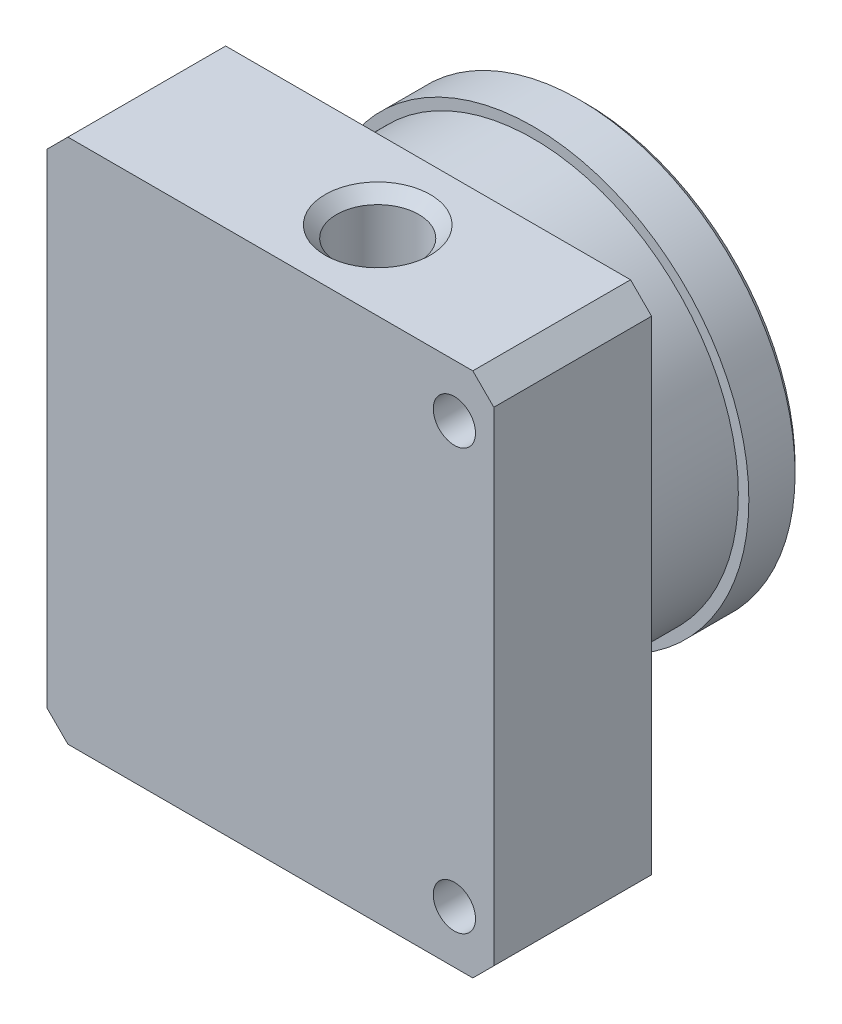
ISO-10303-21;
HEADER;
FILE_DESCRIPTION(('STEP AP214'),'2;1');
FILE_NAME('part.step','',(''),(''),'','','');
FILE_SCHEMA(('AUTOMOTIVE_DESIGN { 1 0 10303 214 1 1 1 1 }'));
ENDSEC;
DATA;
#1=APPLICATION_CONTEXT('core data for automotive mechanical design processes');
#2=APPLICATION_PROTOCOL_DEFINITION('international standard','automotive_design',2000,#1);
#3=PRODUCT_CONTEXT('',#1,'mechanical');
#4=PRODUCT('Part','Part','',(#3));
#5=PRODUCT_RELATED_PRODUCT_CATEGORY('part','',(#4));
#6=PRODUCT_DEFINITION_FORMATION('','',#4);
#7=PRODUCT_DEFINITION_CONTEXT('part definition',#1,'design');
#8=PRODUCT_DEFINITION('design','',#6,#7);
#9=PRODUCT_DEFINITION_SHAPE('','',#8);
#10=(LENGTH_UNIT() NAMED_UNIT(*) SI_UNIT(.MILLI.,.METRE.));
#11=(NAMED_UNIT(*) PLANE_ANGLE_UNIT() SI_UNIT($,.RADIAN.));
#12=(NAMED_UNIT(*) SI_UNIT($,.STERADIAN.) SOLID_ANGLE_UNIT());
#13=UNCERTAINTY_MEASURE_WITH_UNIT(LENGTH_MEASURE(1.E-05),#10,'distance_accuracy_value','');
#14=(GEOMETRIC_REPRESENTATION_CONTEXT(3) GLOBAL_UNCERTAINTY_ASSIGNED_CONTEXT((#13)) GLOBAL_UNIT_ASSIGNED_CONTEXT((#10,
#11,#12)) REPRESENTATION_CONTEXT('',''));
#15=CARTESIAN_POINT('',(0.,0.,0.));
#16=DIRECTION('',(0.,0.,1.));
#17=DIRECTION('',(1.,0.,0.));
#18=AXIS2_PLACEMENT_3D('',#15,#16,#17);
#19=CARTESIAN_POINT('',(-0.762000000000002,-14.4615462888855,11.43));
#20=DIRECTION('',(0.,0.,-1.));
#21=DIRECTION('',(-1.,0.,0.));
#22=AXIS2_PLACEMENT_3D('',#19,#20,#21);
#23=CYLINDRICAL_SURFACE('',#22,3.302);
#24=CARTESIAN_POINT('',(-0.762000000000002,-14.4615462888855,11.43));
#25=DIRECTION('',(0.,0.,-1.));
#26=DIRECTION('',(-1.,0.,0.));
#27=AXIS2_PLACEMENT_3D('',#24,#25,#26);
#28=CIRCLE('',#27,3.302);
#29=CARTESIAN_POINT('',(-4.03498007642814,-14.8983590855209,11.43));
#30=VERTEX_POINT('',#29);
#31=CARTESIAN_POINT('',(-4.064,-14.4615462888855,11.43));
#32=VERTEX_POINT('',#31);
#33=EDGE_CURVE('E632',#30,#32,#28,.T.);
#34=ORIENTED_EDGE('',*,*,#33,.F.);
#35=CARTESIAN_POINT('',(-4.03498007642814,-14.8983590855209,11.43));
#36=CARTESIAN_POINT('',(-4.04138940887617,-14.8502529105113,11.3572498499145));
#37=CARTESIAN_POINT('',(-4.04637769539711,-14.8048719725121,11.282595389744));
#38=CARTESIAN_POINT('',(-4.05413771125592,-14.7201017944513,11.1304354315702));
#39=CARTESIAN_POINT('',(-4.05692259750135,-14.6806781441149,11.0529497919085));
#40=CARTESIAN_POINT('',(-4.06096274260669,-14.607780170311,10.8952017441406));
#41=CARTESIAN_POINT('',(-4.06221808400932,-14.5743055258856,10.8149394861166));
#42=CARTESIAN_POINT('',(-4.06373222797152,-14.5133100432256,10.6516195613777));
#43=CARTESIAN_POINT('',(-4.06398495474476,-14.4858264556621,10.5685479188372));
#44=CARTESIAN_POINT('',(-4.064,-14.4615462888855,10.4845542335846));
#45=B_SPLINE_CURVE_WITH_KNOTS('',3,(#35,#36,#37,#38,#39,#40,#41,#42,#43,#44),.UNSPECIFIED.,.F.,
.F.,(4,2,2,2,4),(0.,0.262255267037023,0.522932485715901,0.783595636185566,1.04583599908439),.UNSPECIFIED.);
#46=CARTESIAN_POINT('',(-4.064,-14.4615462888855,10.4845542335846));
#47=VERTEX_POINT('',#46);
#48=EDGE_CURVE('E702',#30,#47,#45,.T.);
#49=ORIENTED_EDGE('',*,*,#48,.T.);
#50=DIRECTION('',(0.,0.,-1.));
#51=VECTOR('',#50,1.);
#52=CARTESIAN_POINT('',(-4.064,-14.4615462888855,11.43));
#53=LINE('',#52,#51);
#54=EDGE_CURVE('E284',#32,#47,#53,.T.);
#55=ORIENTED_EDGE('',*,*,#54,.F.);
#56=EDGE_LOOP('',(#34,#49,#55));
#57=FACE_BOUND('',#56,.T.);
#58=ADVANCED_FACE('F48',(#57),#23,.F.);
#59=CARTESIAN_POINT('',(8.382,-4.572,11.43));
#60=DIRECTION('',(0.,0.,-1.));
#61=DIRECTION('',(-1.,0.,0.));
#62=AXIS2_PLACEMENT_3D('',#59,#60,#61);
#63=PLANE('',#62);
#64=DIRECTION('',(-1.,0.,0.));
#65=VECTOR('',#64,1.);
#66=CARTESIAN_POINT('',(-26.9875,-14.8983590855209,11.43));
#67=LINE('',#66,#65);
#68=CARTESIAN_POINT('',(-0.317499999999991,-14.8983590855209,11.43));
#69=VERTEX_POINT('',#68);
#70=EDGE_CURVE('E704',#30,#69,#67,.F.);
#71=ORIENTED_EDGE('',*,*,#70,.F.);
#72=ORIENTED_EDGE('',*,*,#33,.T.);
#73=DIRECTION('',(0.,1.,0.));
#74=VECTOR('',#73,1.);
#75=CARTESIAN_POINT('',(-4.064,-12.446,11.43));
#76=LINE('',#75,#74);
#77=CARTESIAN_POINT('',(-4.064,-12.446,11.43));
#78=VERTEX_POINT('',#77);
#79=EDGE_CURVE('E634',#32,#78,#76,.T.);
#80=ORIENTED_EDGE('',*,*,#79,.T.);
#81=CARTESIAN_POINT('',(-0.762000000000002,-12.446,11.43));
#82=DIRECTION('',(0.,0.,-1.));
#83=DIRECTION('',(-1.,0.,0.));
#84=AXIS2_PLACEMENT_3D('',#81,#82,#83);
#85=CIRCLE('',#84,3.302);
#86=CARTESIAN_POINT('',(-0.762000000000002,-9.144,11.43));
#87=VERTEX_POINT('',#86);
#88=EDGE_CURVE('E637',#78,#87,#85,.T.);
#89=ORIENTED_EDGE('',*,*,#88,.T.);
#90=DIRECTION('',(1.,0.,0.));
#91=VECTOR('',#90,1.);
#92=CARTESIAN_POINT('',(1.778,-9.144,11.43));
#93=LINE('',#92,#91);
#94=CARTESIAN_POINT('',(1.778,-9.144,11.43));
#95=VERTEX_POINT('',#94);
#96=EDGE_CURVE('E640',#87,#95,#93,.T.);
#97=ORIENTED_EDGE('',*,*,#96,.T.);
#98=CARTESIAN_POINT('',(1.778,-5.842,11.43));
#99=DIRECTION('',(0.,0.,1.));
#100=DIRECTION('',(-1.,0.,0.));
#101=AXIS2_PLACEMENT_3D('',#98,#99,#100);
#102=CIRCLE('',#101,3.302);
#103=CARTESIAN_POINT('',(4.94474610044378,-6.77737325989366,11.43));
#104=VERTEX_POINT('',#103);
#105=EDGE_CURVE('E644',#95,#104,#102,.T.);
#106=ORIENTED_EDGE('',*,*,#105,.T.);
#107=DIRECTION('',(0.,-1.,0.));
#108=VECTOR('',#107,1.);
#109=CARTESIAN_POINT('',(4.94474610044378,-31.75,11.43));
#110=LINE('',#109,#108);
#111=CARTESIAN_POINT('',(4.94474610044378,-17.1882392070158,11.43));
#112=VERTEX_POINT('',#111);
#113=EDGE_CURVE('E499',#112,#104,#110,.F.);
#114=ORIENTED_EDGE('',*,*,#113,.F.);
#115=CARTESIAN_POINT('',(0.,3.175,11.43));
#116=DIRECTION('',(0.,0.,-1.));
#117=DIRECTION('',(-1.,0.,0.));
#118=AXIS2_PLACEMENT_3D('',#115,#116,#117);
#119=CIRCLE('',#118,20.955);
#120=CARTESIAN_POINT('',(0.613460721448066,-17.7710184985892,11.43));
#121=VERTEX_POINT('',#120);
#122=EDGE_CURVE('E628',#112,#121,#119,.T.);
#123=ORIENTED_EDGE('',*,*,#122,.T.);
#124=CARTESIAN_POINT('',(-3.04747136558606,-10.0123526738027,11.43));
#125=CARTESIAN_POINT('',(-2.88432137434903,-10.291994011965,11.43));
#126=CARTESIAN_POINT('',(-2.7214880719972,-10.5718224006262,11.43));
#127=CARTESIAN_POINT('',(-2.39663582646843,-11.1324938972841,11.43));
#128=CARTESIAN_POINT('',(-2.23461840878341,-11.4133378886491,11.43));
#129=CARTESIAN_POINT('',(-1.90429127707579,-11.9894102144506,11.43));
#130=CARTESIAN_POINT('',(-1.73605410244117,-12.2846801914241,11.43));
#131=CARTESIAN_POINT('',(-1.40231034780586,-12.8761997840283,11.43));
#132=CARTESIAN_POINT('',(-1.23680015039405,-13.1724473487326,11.43));
#133=CARTESIAN_POINT('',(-0.987622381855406,-13.6258723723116,11.43));
#134=CARTESIAN_POINT('',(-0.902447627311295,-13.7822203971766,11.43));
#135=CARTESIAN_POINT('',(-0.733661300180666,-14.0957720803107,11.43));
#136=CARTESIAN_POINT('',(-0.650049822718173,-14.2529757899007,11.43));
#137=CARTESIAN_POINT('',(-0.48461450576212,-14.5692649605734,11.43));
#138=CARTESIAN_POINT('',(-0.402800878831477,-14.7283557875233,11.43));
#139=CARTESIAN_POINT('',(-0.24234879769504,-15.0481238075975,11.43));
#140=CARTESIAN_POINT('',(-0.163710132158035,-15.2088008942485,11.43));
#141=CARTESIAN_POINT('',(-0.0132321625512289,-15.528033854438,11.43));
#142=CARTESIAN_POINT('',(0.0587336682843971,-15.686529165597,11.43));
#143=CARTESIAN_POINT('',(0.161479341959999,-15.9266128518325,11.43));
#144=CARTESIAN_POINT('',(0.194878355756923,-16.0070776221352,11.43));
#145=CARTESIAN_POINT('',(0.259447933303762,-16.1688930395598,11.43));
#146=CARTESIAN_POINT('',(0.290618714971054,-16.2502435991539,11.43));
#147=CARTESIAN_POINT('',(0.349904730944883,-16.4133045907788,11.43));
#148=CARTESIAN_POINT('',(0.378042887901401,-16.4950066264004,11.43));
#149=CARTESIAN_POINT('',(0.430825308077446,-16.6595554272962,11.43));
#150=CARTESIAN_POINT('',(0.455469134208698,-16.7424023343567,11.43));
#151=CARTESIAN_POINT('',(0.500325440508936,-16.909103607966,11.43));
#152=CARTESIAN_POINT('',(0.520547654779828,-16.9929553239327,11.43));
#153=CARTESIAN_POINT('',(0.555641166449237,-17.1617554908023,11.43));
#154=CARTESIAN_POINT('',(0.570515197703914,-17.2467033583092,11.43));
#155=CARTESIAN_POINT('',(0.588373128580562,-17.3765390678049,11.43));
#156=CARTESIAN_POINT('',(0.593639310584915,-17.4211185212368,11.43));
#157=CARTESIAN_POINT('',(0.602378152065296,-17.5104781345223,11.43));
#158=CARTESIAN_POINT('',(0.605849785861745,-17.5552583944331,11.43));
#159=CARTESIAN_POINT('',(0.613443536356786,-17.6897974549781,11.43));
#160=CARTESIAN_POINT('',(0.614741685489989,-17.7797345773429,11.43));
#161=CARTESIAN_POINT('',(0.609702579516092,-17.9584666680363,11.43));
#162=CARTESIAN_POINT('',(0.603442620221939,-18.0472639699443,11.43));
#163=CARTESIAN_POINT('',(0.583946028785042,-18.2240759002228,11.43));
#164=CARTESIAN_POINT('',(0.570708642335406,-18.3120904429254,11.43));
#165=CARTESIAN_POINT('',(0.51706123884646,-18.600858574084,11.43));
#166=CARTESIAN_POINT('',(0.463711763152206,-18.7992079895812,11.43));
#167=CARTESIAN_POINT('',(0.369156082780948,-19.0919938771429,11.43));
#168=CARTESIAN_POINT('',(0.335122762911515,-19.1890118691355,11.43));
#169=CARTESIAN_POINT('',(0.263349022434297,-19.3816741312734,11.43));
#170=CARTESIAN_POINT('',(0.225609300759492,-19.4773186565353,11.43));
#171=CARTESIAN_POINT('',(0.145748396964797,-19.6712786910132,11.43));
#172=CARTESIAN_POINT('',(0.10351176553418,-19.7695458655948,11.43));
#173=CARTESIAN_POINT('',(0.0167355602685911,-19.9650669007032,11.43));
#174=CARTESIAN_POINT('',(-0.027804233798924,-20.0623206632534,11.43));
#175=CARTESIAN_POINT('',(-0.118195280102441,-20.2550438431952,11.43));
#176=CARTESIAN_POINT('',(-0.164029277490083,-20.3505213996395,11.43));
#177=CARTESIAN_POINT('',(-0.257050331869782,-20.5407807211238,11.43));
#178=CARTESIAN_POINT('',(-0.304236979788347,-20.6355626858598,11.43));
#179=CARTESIAN_POINT('',(-0.35192803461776,-20.7300842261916,11.43));
#180=B_SPLINE_CURVE_WITH_KNOTS('',3,(#124,#125,#126,#127,#128,#129,#130,#131,#132,#133,#134,
#135,#136,#137,#138,#139,#140,#141,#142,#143,#144,#145,#146,#147,#148,#149,#150,#151,#152,#153,
#154,#155,#156,#157,#158,#159,#160,#161,#162,#163,#164,#165,#166,#167,#168,#169,#170,#171,#172,
#173,#174,#175,#176,#177,#178,#179),.UNSPECIFIED.,.F.,.F.,(4,2,2,2,2,2,2,2,2,2,2,2,2,2,2,2,2,2,
2,2,2,2,2,2,2,2,2,4),(0.,0.971267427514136,1.94394493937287,2.96344523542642,3.98146190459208,
4.51558567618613,5.04974184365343,5.58640100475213,6.12302438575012,6.64510165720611,
6.90643980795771,7.16775236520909,7.42692595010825,7.6861319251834,7.94476138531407,
8.20325845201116,8.3378940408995,8.47260649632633,8.74209169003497,9.00884408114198,
9.27562531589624,9.88972777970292,10.1981668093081,10.5065477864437,10.8273955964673,
11.1482741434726,11.4659897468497,11.783610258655),.UNSPECIFIED.);
#181=EDGE_CURVE('E75',#69,#121,#180,.T.);
#182=ORIENTED_EDGE('',*,*,#181,.F.);
#183=EDGE_LOOP('',(#71,#72,#80,#89,#97,#106,#114,#123,#182));
#184=FACE_BOUND('',#183,.T.);
#185=ADVANCED_FACE('F246',(#184),#63,.T.);
#186=CARTESIAN_POINT('',(0.,3.175,-19.05));
#187=DIRECTION('',(0.,0.,-1.));
#188=DIRECTION('',(-1.,0.,0.));
#189=AXIS2_PLACEMENT_3D('',#186,#187,#188);
#190=PLANE('',#189);
#191=CARTESIAN_POINT('',(0.,3.175,-19.05));
#192=DIRECTION('',(0.,0.,-1.));
#193=DIRECTION('',(-1.,0.,0.));
#194=AXIS2_PLACEMENT_3D('',#191,#192,#193);
#195=CIRCLE('',#194,22.987);
#196=CARTESIAN_POINT('',(-22.987,3.175,-19.05));
#197=VERTEX_POINT('',#196);
#198=EDGE_CURVE('E335',#197,#197,#195,.F.);
#199=ORIENTED_EDGE('',*,*,#198,.T.);
#200=EDGE_LOOP('',(#199));
#201=FACE_BOUND('',#200,.T.);
#202=CARTESIAN_POINT('',(0.,3.175,-19.05));
#203=DIRECTION('',(0.,0.,-1.));
#204=DIRECTION('',(-1.,0.,0.));
#205=AXIS2_PLACEMENT_3D('',#202,#203,#204);
#206=CIRCLE('',#205,25.273);
#207=CARTESIAN_POINT('',(25.273,3.175,-19.05));
#208=VERTEX_POINT('',#207);
#209=EDGE_CURVE('E332',#208,#208,#206,.T.);
#210=ORIENTED_EDGE('',*,*,#209,.T.);
#211=EDGE_LOOP('',(#210));
#212=FACE_BOUND('',#211,.T.);
#213=ADVANCED_FACE('F253',(#201,#212),#190,.T.);
#214=CARTESIAN_POINT('',(0.,3.175,-19.05));
#215=DIRECTION('',(0.,0.,1.));
#216=DIRECTION('',(1.,0.,0.));
#217=AXIS2_PLACEMENT_3D('',#214,#215,#216);
#218=CYLINDRICAL_SURFACE('',#217,26.035);
#219=CARTESIAN_POINT('',(0.,3.175,-12.7));
#220=DIRECTION('',(0.,0.,-1.));
#221=DIRECTION('',(-1.,0.,0.));
#222=AXIS2_PLACEMENT_3D('',#219,#220,#221);
#223=CIRCLE('',#222,26.035);
#224=CARTESIAN_POINT('',(26.035,3.175,-12.7));
#225=VERTEX_POINT('',#224);
#226=EDGE_CURVE('E596',#225,#225,#223,.T.);
#227=CARTESIAN_POINT('',(0.,3.175,-18.288));
#228=DIRECTION('',(0.,0.,-1.));
#229=DIRECTION('',(-1.,0.,0.));
#230=AXIS2_PLACEMENT_3D('',#227,#228,#229);
#231=CIRCLE('',#230,26.035);
#232=CARTESIAN_POINT('',(26.035,3.175,-18.288));
#233=VERTEX_POINT('',#232);
#234=EDGE_CURVE('E338',#233,#233,#231,.F.);
#235=CARTESIAN_POINT('',(26.035,3.175,-12.7));
#236=CARTESIAN_POINT('',(26.035,3.175,-12.7582083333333));
#237=CARTESIAN_POINT('',(26.035,3.175,-12.8164166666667));
#238=CARTESIAN_POINT('',(26.035,3.175,-12.9328333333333));
#239=CARTESIAN_POINT('',(26.035,3.175,-12.9910416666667));
#240=CARTESIAN_POINT('',(26.035,3.175,-13.1074583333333));
#241=CARTESIAN_POINT('',(26.035,3.175,-13.1656666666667));
#242=CARTESIAN_POINT('',(26.035,3.175,-13.2820833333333));
#243=CARTESIAN_POINT('',(26.035,3.175,-13.3402916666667));
#244=CARTESIAN_POINT('',(26.035,3.175,-13.4567083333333));
#245=CARTESIAN_POINT('',(26.035,3.175,-13.5149166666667));
#246=CARTESIAN_POINT('',(26.035,3.175,-13.6313333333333));
#247=CARTESIAN_POINT('',(26.035,3.175,-13.6895416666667));
#248=CARTESIAN_POINT('',(26.035,3.175,-13.8059583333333));
#249=CARTESIAN_POINT('',(26.035,3.175,-13.8641666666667));
#250=CARTESIAN_POINT('',(26.035,3.175,-13.9805833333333));
#251=CARTESIAN_POINT('',(26.035,3.175,-14.0387916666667));
#252=CARTESIAN_POINT('',(26.035,3.175,-14.1552083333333));
#253=CARTESIAN_POINT('',(26.035,3.175,-14.2134166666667));
#254=CARTESIAN_POINT('',(26.035,3.175,-14.3298333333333));
#255=CARTESIAN_POINT('',(26.035,3.175,-14.3880416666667));
#256=CARTESIAN_POINT('',(26.035,3.175,-14.5044583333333));
#257=CARTESIAN_POINT('',(26.035,3.175,-14.5626666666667));
#258=CARTESIAN_POINT('',(26.035,3.175,-14.6790833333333));
#259=CARTESIAN_POINT('',(26.035,3.175,-14.7372916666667));
#260=CARTESIAN_POINT('',(26.035,3.175,-14.8537083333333));
#261=CARTESIAN_POINT('',(26.035,3.175,-14.9119166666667));
#262=CARTESIAN_POINT('',(26.035,3.175,-15.0283333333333));
#263=CARTESIAN_POINT('',(26.035,3.175,-15.0865416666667));
#264=CARTESIAN_POINT('',(26.035,3.175,-15.2029583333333));
#265=CARTESIAN_POINT('',(26.035,3.175,-15.2611666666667));
#266=CARTESIAN_POINT('',(26.035,3.175,-15.3775833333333));
#267=CARTESIAN_POINT('',(26.035,3.175,-15.4357916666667));
#268=CARTESIAN_POINT('',(26.035,3.175,-15.5522083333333));
#269=CARTESIAN_POINT('',(26.035,3.175,-15.6104166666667));
#270=CARTESIAN_POINT('',(26.035,3.175,-15.7268333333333));
#271=CARTESIAN_POINT('',(26.035,3.175,-15.7850416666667));
#272=CARTESIAN_POINT('',(26.035,3.175,-15.9014583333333));
#273=CARTESIAN_POINT('',(26.035,3.175,-15.9596666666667));
#274=CARTESIAN_POINT('',(26.035,3.175,-16.0760833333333));
#275=CARTESIAN_POINT('',(26.035,3.175,-16.1342916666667));
#276=CARTESIAN_POINT('',(26.035,3.175,-16.2507083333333));
#277=CARTESIAN_POINT('',(26.035,3.175,-16.3089166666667));
#278=CARTESIAN_POINT('',(26.035,3.175,-16.4253333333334));
#279=CARTESIAN_POINT('',(26.035,3.175,-16.4835416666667));
#280=CARTESIAN_POINT('',(26.035,3.175,-16.5999583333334));
#281=CARTESIAN_POINT('',(26.035,3.175,-16.6581666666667));
#282=CARTESIAN_POINT('',(26.035,3.175,-16.7745833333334));
#283=CARTESIAN_POINT('',(26.035,3.175,-16.8327916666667));
#284=CARTESIAN_POINT('',(26.035,3.175,-16.9492083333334));
#285=CARTESIAN_POINT('',(26.035,3.175,-17.0074166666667));
#286=CARTESIAN_POINT('',(26.035,3.175,-17.1238333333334));
#287=CARTESIAN_POINT('',(26.035,3.175,-17.1820416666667));
#288=CARTESIAN_POINT('',(26.035,3.175,-17.2984583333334));
#289=CARTESIAN_POINT('',(26.035,3.175,-17.3566666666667));
#290=CARTESIAN_POINT('',(26.035,3.175,-17.4730833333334));
#291=CARTESIAN_POINT('',(26.035,3.175,-17.5312916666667));
#292=CARTESIAN_POINT('',(26.035,3.175,-17.6477083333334));
#293=CARTESIAN_POINT('',(26.035,3.175,-17.7059166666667));
#294=CARTESIAN_POINT('',(26.035,3.175,-17.8223333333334));
#295=CARTESIAN_POINT('',(26.035,3.175,-17.8805416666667));
#296=CARTESIAN_POINT('',(26.035,3.175,-17.9969583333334));
#297=CARTESIAN_POINT('',(26.035,3.175,-18.0551666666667));
#298=CARTESIAN_POINT('',(26.035,3.175,-18.1715833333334));
#299=CARTESIAN_POINT('',(26.035,3.175,-18.2297916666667));
#300=CARTESIAN_POINT('',(26.035,3.175,-18.288));
#301=B_SPLINE_CURVE_WITH_KNOTS('',3,(#235,#236,#237,#238,#239,#240,#241,#242,#243,#244,#245,
#246,#247,#248,#249,#250,#251,#252,#253,#254,#255,#256,#257,#258,#259,#260,#261,#262,#263,#264,
#265,#266,#267,#268,#269,#270,#271,#272,#273,#274,#275,#276,#277,#278,#279,#280,#281,#282,#283,
#284,#285,#286,#287,#288,#289,#290,#291,#292,#293,#294,#295,#296,#297,#298,#299,#300),
.UNSPECIFIED.,.F.,.F.,(4,2,2,2,2,2,2,2,2,2,2,2,2,2,2,2,2,2,2,2,2,2,2,2,2,2,2,2,2,2,2,2,4),(0.,
0.174625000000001,0.349250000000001,0.523875,0.698500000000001,0.873125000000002,1.04775,
1.222375,1.39700000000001,1.57162500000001,1.74625000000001,1.92087500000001,2.09550000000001,
2.27012500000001,2.44475000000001,2.61937500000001,2.79400000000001,2.96862500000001,
3.14325000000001,3.31787500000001,3.49250000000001,3.66712500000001,3.84175000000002,
4.01637500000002,4.19100000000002,4.36562500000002,4.54025000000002,4.71487500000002,
4.88950000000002,5.06412500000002,5.23875000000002,5.41337500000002,5.58800000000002),.UNSPECIFIED.);
#302=EDGE_CURVE('BSEAM851',#225,#233,#301,.T.);
#303=ORIENTED_EDGE('',*,*,#226,.T.);
#304=ORIENTED_EDGE('',*,*,#234,.T.);
#305=ORIENTED_EDGE('',*,*,#302,.T.);
#306=ORIENTED_EDGE('',*,*,#302,.F.);
#307=EDGE_LOOP('',(#303,#305,#304,#306));
#308=FACE_BOUND('',#307,.T.);
#309=ADVANCED_FACE('F851',(#308),#218,.T.);
#310=CARTESIAN_POINT('',(0.,3.175,-19.05));
#311=DIRECTION('',(0.,0.,1.));
#312=DIRECTION('',(1.,0.,0.));
#313=AXIS2_PLACEMENT_3D('',#310,#311,#312);
#314=CYLINDRICAL_SURFACE('',#313,22.225);
#315=CARTESIAN_POINT('',(0.,3.175,-18.288));
#316=DIRECTION('',(0.,0.,-1.));
#317=DIRECTION('',(-1.,0.,0.));
#318=AXIS2_PLACEMENT_3D('',#315,#316,#317);
#319=CIRCLE('',#318,22.225);
#320=CARTESIAN_POINT('',(22.225,3.175,-18.288));
#321=VERTEX_POINT('',#320);
#322=EDGE_CURVE('E319',#321,#321,#319,.T.);
#323=CARTESIAN_POINT('',(0.,3.175,1.27));
#324=DIRECTION('',(0.,0.,-1.));
#325=DIRECTION('',(-1.,0.,0.));
#326=AXIS2_PLACEMENT_3D('',#323,#324,#325);
#327=CIRCLE('',#326,22.225);
#328=CARTESIAN_POINT('',(22.225,3.175,1.27));
#329=VERTEX_POINT('',#328);
#330=EDGE_CURVE('E301',#329,#329,#327,.T.);
#331=CARTESIAN_POINT('',(22.225,3.175,-18.288));
#332=CARTESIAN_POINT('',(22.225,3.175,-18.0842708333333));
#333=CARTESIAN_POINT('',(22.225,3.175,-17.8805416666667));
#334=CARTESIAN_POINT('',(22.225,3.175,-17.4730833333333));
#335=CARTESIAN_POINT('',(22.225,3.175,-17.2693541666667));
#336=CARTESIAN_POINT('',(22.225,3.175,-16.8618958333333));
#337=CARTESIAN_POINT('',(22.225,3.175,-16.6581666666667));
#338=CARTESIAN_POINT('',(22.225,3.175,-16.2507083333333));
#339=CARTESIAN_POINT('',(22.225,3.175,-16.0469791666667));
#340=CARTESIAN_POINT('',(22.225,3.175,-15.6395208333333));
#341=CARTESIAN_POINT('',(22.225,3.175,-15.4357916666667));
#342=CARTESIAN_POINT('',(22.225,3.175,-15.0283333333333));
#343=CARTESIAN_POINT('',(22.225,3.175,-14.8246041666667));
#344=CARTESIAN_POINT('',(22.225,3.175,-14.4171458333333));
#345=CARTESIAN_POINT('',(22.225,3.175,-14.2134166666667));
#346=CARTESIAN_POINT('',(22.225,3.175,-13.8059583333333));
#347=CARTESIAN_POINT('',(22.225,3.175,-13.6022291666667));
#348=CARTESIAN_POINT('',(22.225,3.175,-13.1947708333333));
#349=CARTESIAN_POINT('',(22.225,3.175,-12.9910416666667));
#350=CARTESIAN_POINT('',(22.225,3.175,-12.5835833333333));
#351=CARTESIAN_POINT('',(22.225,3.175,-12.3798541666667));
#352=CARTESIAN_POINT('',(22.225,3.175,-11.9723958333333));
#353=CARTESIAN_POINT('',(22.225,3.175,-11.7686666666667));
#354=CARTESIAN_POINT('',(22.225,3.175,-11.3612083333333));
#355=CARTESIAN_POINT('',(22.225,3.175,-11.1574791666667));
#356=CARTESIAN_POINT('',(22.225,3.175,-10.7500208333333));
#357=CARTESIAN_POINT('',(22.225,3.175,-10.5462916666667));
#358=CARTESIAN_POINT('',(22.225,3.175,-10.1388333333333));
#359=CARTESIAN_POINT('',(22.225,3.175,-9.93510416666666));
#360=CARTESIAN_POINT('',(22.225,3.175,-9.52764583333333));
#361=CARTESIAN_POINT('',(22.225,3.175,-9.32391666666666));
#362=CARTESIAN_POINT('',(22.225,3.175,-8.91645833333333));
#363=CARTESIAN_POINT('',(22.225,3.175,-8.71272916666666));
#364=CARTESIAN_POINT('',(22.225,3.175,-8.30527083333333));
#365=CARTESIAN_POINT('',(22.225,3.175,-8.10154166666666));
#366=CARTESIAN_POINT('',(22.225,3.175,-7.69408333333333));
#367=CARTESIAN_POINT('',(22.225,3.175,-7.49035416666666));
#368=CARTESIAN_POINT('',(22.225,3.175,-7.08289583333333));
#369=CARTESIAN_POINT('',(22.225,3.175,-6.87916666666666));
#370=CARTESIAN_POINT('',(22.225,3.175,-6.47170833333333));
#371=CARTESIAN_POINT('',(22.225,3.175,-6.26797916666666));
#372=CARTESIAN_POINT('',(22.225,3.175,-5.86052083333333));
#373=CARTESIAN_POINT('',(22.225,3.175,-5.65679166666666));
#374=CARTESIAN_POINT('',(22.225,3.175,-5.24933333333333));
#375=CARTESIAN_POINT('',(22.225,3.175,-5.04560416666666));
#376=CARTESIAN_POINT('',(22.225,3.175,-4.63814583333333));
#377=CARTESIAN_POINT('',(22.225,3.175,-4.43441666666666));
#378=CARTESIAN_POINT('',(22.225,3.175,-4.02695833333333));
#379=CARTESIAN_POINT('',(22.225,3.175,-3.82322916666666));
#380=CARTESIAN_POINT('',(22.225,3.175,-3.41577083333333));
#381=CARTESIAN_POINT('',(22.225,3.175,-3.21204166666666));
#382=CARTESIAN_POINT('',(22.225,3.175,-2.80458333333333));
#383=CARTESIAN_POINT('',(22.225,3.175,-2.60085416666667));
#384=CARTESIAN_POINT('',(22.225,3.175,-2.19339583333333));
#385=CARTESIAN_POINT('',(22.225,3.175,-1.98966666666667));
#386=CARTESIAN_POINT('',(22.225,3.175,-1.58220833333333));
#387=CARTESIAN_POINT('',(22.225,3.175,-1.37847916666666));
#388=CARTESIAN_POINT('',(22.225,3.175,-0.971020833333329));
#389=CARTESIAN_POINT('',(22.225,3.175,-0.767291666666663));
#390=CARTESIAN_POINT('',(22.225,3.175,-0.35983333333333));
#391=CARTESIAN_POINT('',(22.225,3.175,-0.156104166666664));
#392=CARTESIAN_POINT('',(22.225,3.175,0.251354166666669));
#393=CARTESIAN_POINT('',(22.225,3.175,0.455083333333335));
#394=CARTESIAN_POINT('',(22.225,3.175,0.862541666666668));
#395=CARTESIAN_POINT('',(22.225,3.175,1.06627083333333));
#396=CARTESIAN_POINT('',(22.225,3.175,1.27));
#397=B_SPLINE_CURVE_WITH_KNOTS('',3,(#331,#332,#333,#334,#335,#336,#337,#338,#339,#340,#341,
#342,#343,#344,#345,#346,#347,#348,#349,#350,#351,#352,#353,#354,#355,#356,#357,#358,#359,#360,
#361,#362,#363,#364,#365,#366,#367,#368,#369,#370,#371,#372,#373,#374,#375,#376,#377,#378,#379,
#380,#381,#382,#383,#384,#385,#386,#387,#388,#389,#390,#391,#392,#393,#394,#395,#396),
.UNSPECIFIED.,.F.,.F.,(4,2,2,2,2,2,2,2,2,2,2,2,2,2,2,2,2,2,2,2,2,2,2,2,2,2,2,2,2,2,2,2,4),(0.,
0.611187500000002,1.222375,1.8335625,2.44475,3.0559375,3.667125,4.2783125,4.8895,5.5006875,
6.111875,6.7230625,7.33425,7.9454375,8.556625,9.1678125,9.779,10.3901875,11.001375,11.6125625,
12.22375,12.8349375,13.446125,14.0573125,14.6685,15.2796875,15.890875,16.5020625,17.11325,
17.7244375,18.335625,18.9468125,19.558),.UNSPECIFIED.);
#398=EDGE_CURVE('BSEAM811',#321,#329,#397,.T.);
#399=ORIENTED_EDGE('',*,*,#322,.T.);
#400=ORIENTED_EDGE('',*,*,#330,.F.);
#401=ORIENTED_EDGE('',*,*,#398,.T.);
#402=ORIENTED_EDGE('',*,*,#398,.F.);
#403=EDGE_LOOP('',(#399,#401,#400,#402));
#404=FACE_BOUND('',#403,.T.);
#405=ADVANCED_FACE('F811',(#404),#314,.F.);
#406=CARTESIAN_POINT('',(0.,3.175,-18.288));
#407=DIRECTION('',(0.,0.,-1.));
#408=DIRECTION('',(-1.,0.,0.));
#409=AXIS2_PLACEMENT_3D('',#406,#407,#408);
#410=CONICAL_SURFACE('',#409,22.225,0.785398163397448);
#411=ORIENTED_EDGE('',*,*,#198,.F.);
#412=EDGE_LOOP('',(#411));
#413=FACE_BOUND('',#412,.T.);
#414=ORIENTED_EDGE('',*,*,#322,.F.);
#415=EDGE_LOOP('',(#414));
#416=FACE_BOUND('',#415,.T.);
#417=ADVANCED_FACE('F807',(#413,#416),#410,.F.);
#418=CARTESIAN_POINT('',(0.,3.175,-19.05));
#419=DIRECTION('',(0.,0.,1.));
#420=DIRECTION('',(1.,0.,0.));
#421=AXIS2_PLACEMENT_3D('',#418,#419,#420);
#422=CONICAL_SURFACE('',#421,25.273,0.785398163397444);
#423=CARTESIAN_POINT('',(26.035,3.175,-18.288));
#424=CARTESIAN_POINT('',(26.0270625,3.175,-18.2959375));
#425=CARTESIAN_POINT('',(26.019125,3.175,-18.303875));
#426=CARTESIAN_POINT('',(26.00325,3.175,-18.31975));
#427=CARTESIAN_POINT('',(25.9953125,3.175,-18.3276875));
#428=CARTESIAN_POINT('',(25.9794375,3.175,-18.3435625));
#429=CARTESIAN_POINT('',(25.9715,3.175,-18.3515));
#430=CARTESIAN_POINT('',(25.955625,3.175,-18.367375));
#431=CARTESIAN_POINT('',(25.9476875,3.175,-18.3753125));
#432=CARTESIAN_POINT('',(25.9318125,3.175,-18.3911875));
#433=CARTESIAN_POINT('',(25.923875,3.175,-18.399125));
#434=CARTESIAN_POINT('',(25.908,3.175,-18.415));
#435=CARTESIAN_POINT('',(25.9000625,3.175,-18.4229375));
#436=CARTESIAN_POINT('',(25.8841875,3.175,-18.4388125));
#437=CARTESIAN_POINT('',(25.87625,3.175,-18.44675));
#438=CARTESIAN_POINT('',(25.860375,3.175,-18.462625));
#439=CARTESIAN_POINT('',(25.8524375,3.175,-18.4705625));
#440=CARTESIAN_POINT('',(25.8365625,3.175,-18.4864375));
#441=CARTESIAN_POINT('',(25.828625,3.175,-18.494375));
#442=CARTESIAN_POINT('',(25.81275,3.175,-18.51025));
#443=CARTESIAN_POINT('',(25.8048125,3.175,-18.5181875));
#444=CARTESIAN_POINT('',(25.7889375,3.175,-18.5340625));
#445=CARTESIAN_POINT('',(25.781,3.175,-18.542));
#446=CARTESIAN_POINT('',(25.765125,3.175,-18.557875));
#447=CARTESIAN_POINT('',(25.7571875,3.175,-18.5658125));
#448=CARTESIAN_POINT('',(25.7413125,3.175,-18.5816875));
#449=CARTESIAN_POINT('',(25.733375,3.175,-18.589625));
#450=CARTESIAN_POINT('',(25.7175,3.175,-18.6055));
#451=CARTESIAN_POINT('',(25.7095625,3.175,-18.6134375));
#452=CARTESIAN_POINT('',(25.6936875,3.175,-18.6293125));
#453=CARTESIAN_POINT('',(25.68575,3.175,-18.63725));
#454=CARTESIAN_POINT('',(25.669875,3.175,-18.653125));
#455=CARTESIAN_POINT('',(25.6619375,3.175,-18.6610625));
#456=CARTESIAN_POINT('',(25.6460625,3.175,-18.6769375));
#457=CARTESIAN_POINT('',(25.638125,3.175,-18.684875));
#458=CARTESIAN_POINT('',(25.62225,3.175,-18.70075));
#459=CARTESIAN_POINT('',(25.6143125,3.175,-18.7086875));
#460=CARTESIAN_POINT('',(25.5984375,3.175,-18.7245625));
#461=CARTESIAN_POINT('',(25.5905,3.175,-18.7325));
#462=CARTESIAN_POINT('',(25.574625,3.175,-18.748375));
#463=CARTESIAN_POINT('',(25.5666875,3.175,-18.7563125));
#464=CARTESIAN_POINT('',(25.5508125,3.175,-18.7721875));
#465=CARTESIAN_POINT('',(25.542875,3.175,-18.780125));
#466=CARTESIAN_POINT('',(25.527,3.175,-18.796));
#467=CARTESIAN_POINT('',(25.5190625,3.175,-18.8039375));
#468=CARTESIAN_POINT('',(25.5031875,3.175,-18.8198125));
#469=CARTESIAN_POINT('',(25.49525,3.175,-18.82775));
#470=CARTESIAN_POINT('',(25.479375,3.175,-18.843625));
#471=CARTESIAN_POINT('',(25.4714375,3.175,-18.8515625));
#472=CARTESIAN_POINT('',(25.4555625,3.175,-18.8674375));
#473=CARTESIAN_POINT('',(25.447625,3.175,-18.875375));
#474=CARTESIAN_POINT('',(25.43175,3.175,-18.89125));
#475=CARTESIAN_POINT('',(25.4238125,3.175,-18.8991875));
#476=CARTESIAN_POINT('',(25.4079375,3.175,-18.9150625));
#477=CARTESIAN_POINT('',(25.4,3.175,-18.923));
#478=CARTESIAN_POINT('',(25.384125,3.175,-18.938875));
#479=CARTESIAN_POINT('',(25.3761875,3.175,-18.9468125));
#480=CARTESIAN_POINT('',(25.3603125,3.175,-18.9626875));
#481=CARTESIAN_POINT('',(25.352375,3.175,-18.970625));
#482=CARTESIAN_POINT('',(25.3365,3.175,-18.9865));
#483=CARTESIAN_POINT('',(25.3285625,3.175,-18.9944375));
#484=CARTESIAN_POINT('',(25.3126875,3.175,-19.0103125));
#485=CARTESIAN_POINT('',(25.30475,3.175,-19.01825));
#486=CARTESIAN_POINT('',(25.288875,3.175,-19.034125));
#487=CARTESIAN_POINT('',(25.2809375,3.175,-19.0420625));
#488=CARTESIAN_POINT('',(25.273,3.175,-19.05));
#489=B_SPLINE_CURVE_WITH_KNOTS('',3,(#423,#424,#425,#426,#427,#428,#429,#430,#431,#432,#433,
#434,#435,#436,#437,#438,#439,#440,#441,#442,#443,#444,#445,#446,#447,#448,#449,#450,#451,#452,
#453,#454,#455,#456,#457,#458,#459,#460,#461,#462,#463,#464,#465,#466,#467,#468,#469,#470,#471,
#472,#473,#474,#475,#476,#477,#478,#479,#480,#481,#482,#483,#484,#485,#486,#487,#488),
.UNSPECIFIED.,.F.,.F.,(4,2,2,2,2,2,2,2,2,2,2,2,2,2,2,2,2,2,2,2,2,2,2,2,2,2,2,2,2,2,2,2,4),(0.,
0.0336759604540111,0.0673519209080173,0.101027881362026,0.134703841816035,0.168379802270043,
0.202055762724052,0.235731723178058,0.269407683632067,0.303083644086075,0.336759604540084,
0.37043556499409,0.404111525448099,0.437787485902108,0.471463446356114,0.505139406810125,
0.538815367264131,0.572491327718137,0.606167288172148,0.639843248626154,0.673519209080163,
0.707195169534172,0.740871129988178,0.774547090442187,0.808223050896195,0.841899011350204,
0.87557497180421,0.909250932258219,0.942926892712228,0.976602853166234,1.01027881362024,
1.04395477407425,1.07763073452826),.UNSPECIFIED.);
#490=EDGE_CURVE('BSEAM810',#233,#208,#489,.T.);
#491=ORIENTED_EDGE('',*,*,#234,.F.);
#492=ORIENTED_EDGE('',*,*,#209,.F.);
#493=ORIENTED_EDGE('',*,*,#490,.T.);
#494=ORIENTED_EDGE('',*,*,#490,.F.);
#495=EDGE_LOOP('',(#491,#493,#492,#494));
#496=FACE_BOUND('',#495,.T.);
#497=ADVANCED_FACE('F810',(#496),#422,.T.);
#498=CARTESIAN_POINT('',(0.,3.175,1.27));
#499=DIRECTION('',(0.,0.,-1.));
#500=DIRECTION('',(-1.,0.,0.));
#501=AXIS2_PLACEMENT_3D('',#498,#499,#500);
#502=PLANE('',#501);
#503=CARTESIAN_POINT('',(11.1394355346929,11.2075613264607,1.27));
#504=DIRECTION('',(0.,0.,-1.));
#505=DIRECTION('',(-1.,0.,0.));
#506=AXIS2_PLACEMENT_3D('',#503,#504,#505);
#507=CIRCLE('',#506,2.0574);
#508=CARTESIAN_POINT('',(9.08203553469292,11.2075613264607,1.27));
#509=VERTEX_POINT('',#508);
#510=EDGE_CURVE('E1293',#509,#509,#507,.T.);
#511=ORIENTED_EDGE('',*,*,#510,.F.);
#512=EDGE_LOOP('',(#511));
#513=FACE_BOUND('',#512,.T.);
#514=CARTESIAN_POINT('',(-10.6026654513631,-8.41999697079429,1.27));
#515=DIRECTION('',(0.,0.,-1.));
#516=DIRECTION('',(-1.,0.,0.));
#517=AXIS2_PLACEMENT_3D('',#514,#515,#516);
#518=CIRCLE('',#517,2.0574);
#519=CARTESIAN_POINT('',(-12.6600654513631,-8.41999697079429,1.27));
#520=VERTEX_POINT('',#519);
#521=EDGE_CURVE('E566',#520,#520,#518,.T.);
#522=ORIENTED_EDGE('',*,*,#521,.F.);
#523=EDGE_LOOP('',(#522));
#524=FACE_BOUND('',#523,.T.);
#525=CARTESIAN_POINT('',(-3.81,-0.507999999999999,1.27));
#526=DIRECTION('',(0.,0.,-1.));
#527=DIRECTION('',(-1.,0.,0.));
#528=AXIS2_PLACEMENT_3D('',#525,#526,#527);
#529=CIRCLE('',#528,2.50799999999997);
#530=CARTESIAN_POINT('',(-6.31799999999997,-0.507999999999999,1.27));
#531=VERTEX_POINT('',#530);
#532=EDGE_CURVE('E380',#531,#531,#529,.F.);
#533=ORIENTED_EDGE('',*,*,#532,.T.);
#534=EDGE_LOOP('',(#533));
#535=FACE_BOUND('',#534,.T.);
#536=CARTESIAN_POINT('',(3.44046229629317,2.87294609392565,1.27));
#537=DIRECTION('',(0.,0.,-1.));
#538=DIRECTION('',(-1.,0.,0.));
#539=AXIS2_PLACEMENT_3D('',#536,#537,#538);
#540=CIRCLE('',#539,2.50799999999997);
#541=CARTESIAN_POINT('',(0.932462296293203,2.87294609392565,1.27));
#542=VERTEX_POINT('',#541);
#543=EDGE_CURVE('E377',#542,#542,#540,.F.);
#544=ORIENTED_EDGE('',*,*,#543,.T.);
#545=EDGE_LOOP('',(#544));
#546=FACE_BOUND('',#545,.T.);
#547=CARTESIAN_POINT('',(8.382,-4.572,1.27));
#548=DIRECTION('',(0.,0.,-1.));
#549=DIRECTION('',(-1.,0.,0.));
#550=AXIS2_PLACEMENT_3D('',#547,#548,#549);
#551=CIRCLE('',#550,3.302);
#552=CARTESIAN_POINT('',(5.08,-4.572,1.27));
#553=VERTEX_POINT('',#552);
#554=CARTESIAN_POINT('',(8.382,-1.27,1.27));
#555=VERTEX_POINT('',#554);
#556=EDGE_CURVE('E615',#553,#555,#551,.T.);
#557=ORIENTED_EDGE('',*,*,#556,.F.);
#558=DIRECTION('',(0.,1.,0.));
#559=VECTOR('',#558,1.);
#560=CARTESIAN_POINT('',(5.08,-4.572,1.27));
#561=LINE('',#560,#559);
#562=CARTESIAN_POINT('',(5.08,-5.842,1.27));
#563=VERTEX_POINT('',#562);
#564=EDGE_CURVE('E622',#563,#553,#561,.T.);
#565=ORIENTED_EDGE('',*,*,#564,.F.);
#566=CARTESIAN_POINT('',(1.778,-5.842,1.27));
#567=DIRECTION('',(0.,0.,1.));
#568=DIRECTION('',(-1.,0.,0.));
#569=AXIS2_PLACEMENT_3D('',#566,#567,#568);
#570=CIRCLE('',#569,3.302);
#571=CARTESIAN_POINT('',(1.778,-9.144,1.27));
#572=VERTEX_POINT('',#571);
#573=EDGE_CURVE('E668',#572,#563,#570,.T.);
#574=ORIENTED_EDGE('',*,*,#573,.F.);
#575=DIRECTION('',(1.,0.,0.));
#576=VECTOR('',#575,1.);
#577=CARTESIAN_POINT('',(1.778,-9.144,1.27));
#578=LINE('',#577,#576);
#579=CARTESIAN_POINT('',(-0.762000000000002,-9.144,1.27));
#580=VERTEX_POINT('',#579);
#581=EDGE_CURVE('E665',#580,#572,#578,.T.);
#582=ORIENTED_EDGE('',*,*,#581,.F.);
#583=CARTESIAN_POINT('',(-0.762000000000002,-12.446,1.27));
#584=DIRECTION('',(0.,0.,-1.));
#585=DIRECTION('',(-1.,0.,0.));
#586=AXIS2_PLACEMENT_3D('',#583,#584,#585);
#587=CIRCLE('',#586,3.302);
#588=CARTESIAN_POINT('',(-4.064,-12.446,1.27));
#589=VERTEX_POINT('',#588);
#590=EDGE_CURVE('E662',#589,#580,#587,.T.);
#591=ORIENTED_EDGE('',*,*,#590,.F.);
#592=DIRECTION('',(0.,1.,0.));
#593=VECTOR('',#592,1.);
#594=CARTESIAN_POINT('',(-4.064,-12.446,1.27));
#595=LINE('',#594,#593);
#596=CARTESIAN_POINT('',(-4.064,-14.4615462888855,1.27));
#597=VERTEX_POINT('',#596);
#598=EDGE_CURVE('E660',#597,#589,#595,.T.);
#599=ORIENTED_EDGE('',*,*,#598,.F.);
#600=CARTESIAN_POINT('',(-0.762000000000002,-14.4615462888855,1.27));
#601=DIRECTION('',(0.,0.,-1.));
#602=DIRECTION('',(-1.,0.,0.));
#603=AXIS2_PLACEMENT_3D('',#600,#601,#602);
#604=CIRCLE('',#603,3.302);
#605=CARTESIAN_POINT('',(-0.90453237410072,-17.7604686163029,1.27));
#606=VERTEX_POINT('',#605);
#607=EDGE_CURVE('E280',#606,#597,#604,.T.);
#608=ORIENTED_EDGE('',*,*,#607,.F.);
#609=CARTESIAN_POINT('',(0.,3.175,1.27));
#610=DIRECTION('',(0.,0.,-1.));
#611=DIRECTION('',(-1.,0.,0.));
#612=AXIS2_PLACEMENT_3D('',#609,#610,#611);
#613=CIRCLE('',#612,20.955);
#614=CARTESIAN_POINT('',(18.8293428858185,-6.02107913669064,1.27));
#615=VERTEX_POINT('',#614);
#616=EDGE_CURVE('E656',#615,#606,#613,.T.);
#617=ORIENTED_EDGE('',*,*,#616,.F.);
#618=CARTESIAN_POINT('',(15.8622949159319,-4.572,1.27));
#619=DIRECTION('',(0.,0.,-1.));
#620=DIRECTION('',(-1.,0.,0.));
#621=AXIS2_PLACEMENT_3D('',#618,#619,#620);
#622=CIRCLE('',#621,3.302);
#623=CARTESIAN_POINT('',(15.8622949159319,-1.27,1.27));
#624=VERTEX_POINT('',#623);
#625=EDGE_CURVE('E653',#624,#615,#622,.T.);
#626=ORIENTED_EDGE('',*,*,#625,.F.);
#627=DIRECTION('',(1.,0.,0.));
#628=VECTOR('',#627,1.);
#629=CARTESIAN_POINT('',(15.8622949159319,-1.27,1.27));
#630=LINE('',#629,#628);
#631=EDGE_CURVE('E650',#555,#624,#630,.T.);
#632=ORIENTED_EDGE('',*,*,#631,.F.);
#633=EDGE_LOOP('',(#557,#565,#574,#582,#591,#599,#608,#617,#626,#632));
#634=FACE_BOUND('',#633,.T.);
#635=ORIENTED_EDGE('',*,*,#330,.T.);
#636=EDGE_LOOP('',(#635));
#637=FACE_BOUND('',#636,.T.);
#638=ADVANCED_FACE('F687',(#513,#524,#535,#546,#634,#637),#502,.T.);
#639=CARTESIAN_POINT('',(-3.81,-0.507999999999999,9.525));
#640=DIRECTION('',(0.,0.,-1.));
#641=DIRECTION('',(-1.,0.,0.));
#642=AXIS2_PLACEMENT_3D('',#639,#640,#641);
#643=CYLINDRICAL_SURFACE('',#642,2.);
#644=CARTESIAN_POINT('',(-2.59923,-2.09986557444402,7.53877636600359));
#645=CARTESIAN_POINT('',(-2.57030234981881,-2.07783865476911,7.58281971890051));
#646=CARTESIAN_POINT('',(-2.54124199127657,-2.0545124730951,7.62618847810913));
#647=CARTESIAN_POINT('',(-2.48275872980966,-2.00464181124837,7.7111621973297));
#648=CARTESIAN_POINT('',(-2.45333474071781,-1.9780818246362,7.75275725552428));
#649=CARTESIAN_POINT('',(-2.39368151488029,-1.92072266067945,7.83418380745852));
#650=CARTESIAN_POINT('',(-2.36344858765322,-1.88984447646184,7.87395799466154));
#651=CARTESIAN_POINT('',(-2.3030817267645,-1.82375015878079,7.94965392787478));
#652=CARTESIAN_POINT('',(-2.2729477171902,-1.78854304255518,7.98558339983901));
#653=CARTESIAN_POINT('',(-2.20667021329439,-1.70497728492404,8.05962142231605));
#654=CARTESIAN_POINT('',(-2.17063703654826,-1.6554212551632,8.09651969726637));
#655=CARTESIAN_POINT('',(-2.10123609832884,-1.54919641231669,8.16002494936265));
#656=CARTESIAN_POINT('',(-2.06784637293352,-1.49259921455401,8.18672585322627));
#657=CARTESIAN_POINT('',(-2.0055660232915,-1.37318897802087,8.22953674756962));
#658=CARTESIAN_POINT('',(-1.97668215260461,-1.31036683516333,8.24563095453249));
#659=CARTESIAN_POINT('',(-1.92511262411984,-1.18040440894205,8.26932988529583));
#660=CARTESIAN_POINT('',(-1.90246348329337,-1.11324141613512,8.27688536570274));
#661=CARTESIAN_POINT('',(-1.86907452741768,-0.993463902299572,8.28567062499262));
#662=CARTESIAN_POINT('',(-1.8567754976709,-0.94133868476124,8.28799983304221));
#663=CARTESIAN_POINT('',(-1.8363866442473,-0.836202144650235,8.29110656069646));
#664=CARTESIAN_POINT('',(-1.82829870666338,-0.783190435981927,8.29188338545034));
#665=CARTESIAN_POINT('',(-1.81639941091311,-0.676628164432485,8.29281836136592));
#666=CARTESIAN_POINT('',(-1.81259290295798,-0.623077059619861,8.29297581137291));
#667=CARTESIAN_POINT('',(-1.80929654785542,-0.515853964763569,8.29311973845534));
#668=CARTESIAN_POINT('',(-1.80980571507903,-0.462182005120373,8.29310625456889));
#669=CARTESIAN_POINT('',(-1.81519162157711,-0.353930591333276,8.29284617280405));
#670=CARTESIAN_POINT('',(-1.82015955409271,-0.299355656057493,8.29259470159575));
#671=CARTESIAN_POINT('',(-1.83455772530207,-0.190780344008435,8.29124363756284));
#672=CARTESIAN_POINT('',(-1.84398992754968,-0.136780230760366,8.29014367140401));
#673=CARTESIAN_POINT('',(-1.86719651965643,-0.0299985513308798,8.2859717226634));
#674=CARTESIAN_POINT('',(-1.88095397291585,0.0227869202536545,8.28290738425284));
#675=CARTESIAN_POINT('',(-1.91261781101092,0.126737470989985,8.27332206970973));
#676=CARTESIAN_POINT('',(-1.93051979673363,0.177904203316,8.26680474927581));
#677=CARTESIAN_POINT('',(-1.97545993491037,0.291442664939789,8.24624141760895));
#678=CARTESIAN_POINT('',(-2.00365959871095,0.353103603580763,8.23063628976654));
#679=CARTESIAN_POINT('',(-2.06442985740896,0.470442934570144,8.18926622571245));
#680=CARTESIAN_POINT('',(-2.09699077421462,0.52613409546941,8.16352354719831));
#681=CARTESIAN_POINT('',(-2.16422199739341,0.630087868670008,8.10272267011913));
#682=CARTESIAN_POINT('',(-2.19887956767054,0.678390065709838,8.06771706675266));
#683=CARTESIAN_POINT('',(-2.26914386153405,0.768340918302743,7.99030716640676));
#684=CARTESIAN_POINT('',(-2.30475502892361,0.809947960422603,7.94785978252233));
#685=CARTESIAN_POINT('',(-2.38413505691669,0.89595262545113,7.84756843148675));
#686=CARTESIAN_POINT('',(-2.42790522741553,0.938808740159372,7.78842429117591));
#687=CARTESIAN_POINT('',(-2.49285356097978,0.997307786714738,7.69654490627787));
#688=CARTESIAN_POINT('',(-2.51422965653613,1.01572785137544,7.66563120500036));
#689=CARTESIAN_POINT('',(-2.5568327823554,1.05095236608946,7.60286729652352));
#690=CARTESIAN_POINT('',(-2.57805997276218,1.06775892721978,7.57101838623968));
#691=CARTESIAN_POINT('',(-2.59923,1.08386557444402,7.53877636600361));
#692=B_SPLINE_CURVE_WITH_KNOTS('',3,(#644,#645,#646,#647,#648,#649,#650,#651,#652,#653,#654,
#655,#656,#657,#658,#659,#660,#661,#662,#663,#664,#665,#666,#667,#668,#669,#670,#671,#672,#673,
#674,#675,#676,#677,#678,#679,#680,#681,#682,#683,#684,#685,#686,#687,#688,#689,#690,#691),
.UNSPECIFIED.,.F.,.F.,(4,2,2,2,2,2,2,2,2,2,2,2,2,2,2,2,2,2,2,2,2,2,2,4),(0.,0.171389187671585,
0.343635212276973,0.519592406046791,0.695189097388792,0.90877556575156,1.12034433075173,
1.33222721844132,1.54532591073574,1.70595866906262,1.86666331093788,2.02754982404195,
2.18839959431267,2.35261606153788,2.51690482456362,2.68055812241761,2.84403850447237,
3.05171908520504,3.2589462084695,3.46502103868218,3.67233098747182,3.92709752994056,
4.05263740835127,4.17801072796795),.UNSPECIFIED.);
#693=CARTESIAN_POINT('',(-2.5273,-2.04249689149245,7.64634628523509));
#694=VERTEX_POINT('',#693);
#695=CARTESIAN_POINT('',(-2.52730000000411,1.02649689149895,7.64634628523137));
#696=VERTEX_POINT('',#695);
#697=EDGE_CURVE('E61',#694,#696,#692,.T.);
#698=ORIENTED_EDGE('',*,*,#697,.T.);
#699=CARTESIAN_POINT('',(-2.5273,1.02649689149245,7.6463462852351));
#700=CARTESIAN_POINT('',(-2.56859586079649,1.06099822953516,7.674515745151));
#701=CARTESIAN_POINT('',(-2.6111859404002,1.09378663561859,7.70289298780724));
#702=CARTESIAN_POINT('',(-2.69904194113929,1.15593729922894,7.75947142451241));
#703=CARTESIAN_POINT('',(-2.74431220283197,1.18529375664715,7.78767224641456));
#704=CARTESIAN_POINT('',(-2.83827638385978,1.24093742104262,7.84368372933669));
#705=CARTESIAN_POINT('',(-2.88701566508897,1.26716344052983,7.87147943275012));
#706=CARTESIAN_POINT('',(-2.98726330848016,1.31578892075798,7.92527236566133));
#707=CARTESIAN_POINT('',(-3.03876947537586,1.33819135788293,7.95127098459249));
#708=CARTESIAN_POINT('',(-3.15960946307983,1.38469212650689,8.00730388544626));
#709=CARTESIAN_POINT('',(-3.22988734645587,1.40749952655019,8.03642071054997));
#710=CARTESIAN_POINT('',(-3.37488442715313,1.44551999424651,8.08667481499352));
#711=CARTESIAN_POINT('',(-3.44957634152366,1.46077516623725,8.10785617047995));
#712=CARTESIAN_POINT('',(-3.58986704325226,1.48089101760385,8.13626295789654));
#713=CARTESIAN_POINT('',(-3.65491303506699,1.48705818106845,8.14522317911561));
#714=CARTESIAN_POINT('',(-3.78591942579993,1.49292717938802,8.15374375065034));
#715=CARTESIAN_POINT('',(-3.85187939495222,1.49263195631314,8.15330837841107));
#716=CARTESIAN_POINT('',(-3.98251447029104,1.48561831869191,8.14313996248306));
#717=CARTESIAN_POINT('',(-4.04719247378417,1.47891662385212,8.13343112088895));
#718=CARTESIAN_POINT('',(-4.17402846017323,1.45964193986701,8.10631114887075));
#719=CARTESIAN_POINT('',(-4.23618195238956,1.44705894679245,8.08888689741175));
#720=CARTESIAN_POINT('',(-4.39451689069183,1.40733824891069,8.03599261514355));
#721=CARTESIAN_POINT('',(-4.48810948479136,1.37600877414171,7.99601535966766));
#722=CARTESIAN_POINT('',(-4.66699713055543,1.30169505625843,7.90872883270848));
#723=CARTESIAN_POINT('',(-4.75226081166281,1.25866889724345,7.86139345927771));
#724=CARTESIAN_POINT('',(-4.88751357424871,1.17808902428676,7.78051890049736));
#725=CARTESIAN_POINT('',(-4.93974203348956,1.14354015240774,7.74767749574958));
#726=CARTESIAN_POINT('',(-5.04069214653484,1.06975551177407,7.68186238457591));
#727=CARTESIAN_POINT('',(-5.0894125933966,1.03051814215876,7.64888863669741));
#728=CARTESIAN_POINT('',(-5.23002878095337,0.905923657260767,7.55118888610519));
#729=CARTESIAN_POINT('',(-5.31665969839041,0.813517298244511,7.48750778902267));
#730=CARTESIAN_POINT('',(-5.45463452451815,0.634271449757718,7.38318982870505));
#731=CARTESIAN_POINT('',(-5.50948799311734,0.551217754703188,7.34065270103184));
#732=CARTESIAN_POINT('',(-5.60735352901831,0.374971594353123,7.26367720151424));
#733=CARTESIAN_POINT('',(-5.65038249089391,0.281793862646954,7.22922728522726));
#734=CARTESIAN_POINT('',(-5.71681136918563,0.101773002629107,7.17561053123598));
#735=CARTESIAN_POINT('',(-5.74220210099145,0.0161243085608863,7.15491561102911));
#736=CARTESIAN_POINT('',(-5.78144763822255,-0.159473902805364,7.12281414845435));
#737=CARTESIAN_POINT('',(-5.79530848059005,-0.249421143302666,7.11140274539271));
#738=CARTESIAN_POINT('',(-5.81062118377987,-0.431370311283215,7.09879175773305));
#739=CARTESIAN_POINT('',(-5.81203544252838,-0.523377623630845,7.09762311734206));
#740=CARTESIAN_POINT('',(-5.80225583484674,-0.706251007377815,7.10568267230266));
#741=CARTESIAN_POINT('',(-5.79106115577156,-0.797117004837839,7.11491153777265));
#742=CARTESIAN_POINT('',(-5.75761675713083,-0.97088455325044,7.14232393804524));
#743=CARTESIAN_POINT('',(-5.73590080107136,-1.05396014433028,7.16007477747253));
#744=CARTESIAN_POINT('',(-5.68282992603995,-1.21489454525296,7.20308864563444));
#745=CARTESIAN_POINT('',(-5.65147054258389,-1.29275091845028,7.22835515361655));
#746=CARTESIAN_POINT('',(-5.56774945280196,-1.46866448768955,7.29501210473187));
#747=CARTESIAN_POINT('',(-5.51188356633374,-1.56409293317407,7.33894294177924));
#748=CARTESIAN_POINT('',(-5.38755198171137,-1.74216963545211,7.43428497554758));
#749=CARTESIAN_POINT('',(-5.31906462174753,-1.82479546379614,7.48570900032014));
#750=CARTESIAN_POINT('',(-5.17031119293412,-1.97808187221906,7.59322080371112));
#751=CARTESIAN_POINT('',(-5.08988000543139,-2.04853863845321,7.64936819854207));
#752=CARTESIAN_POINT('',(-4.91887453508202,-2.17586466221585,7.76164427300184));
#753=CARTESIAN_POINT('',(-4.82830241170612,-2.23273680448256,7.81777295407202));
#754=CARTESIAN_POINT('',(-4.65922456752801,-2.32063323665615,7.91207898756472));
#755=CARTESIAN_POINT('',(-4.58287097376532,-2.35459140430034,7.95137908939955));
#756=CARTESIAN_POINT('',(-4.4236753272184,-2.4134066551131,8.02313841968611));
#757=CARTESIAN_POINT('',(-4.34084575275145,-2.43828074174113,8.05561038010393));
#758=CARTESIAN_POINT('',(-4.19067491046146,-2.47254035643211,8.10189738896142));
#759=CARTESIAN_POINT('',(-4.12470392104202,-2.4842508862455,8.11835303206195));
#760=CARTESIAN_POINT('',(-3.99036918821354,-2.50099371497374,8.14217045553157));
#761=CARTESIAN_POINT('',(-3.92201119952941,-2.50604107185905,8.14955273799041));
#762=CARTESIAN_POINT('',(-3.78449204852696,-2.5090234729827,8.15389219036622));
#763=CARTESIAN_POINT('',(-3.71532869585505,-2.50692781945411,8.15080436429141));
#764=CARTESIAN_POINT('',(-3.5787056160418,-2.49576836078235,8.13471819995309));
#765=CARTESIAN_POINT('',(-3.51124900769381,-2.48669263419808,8.12170290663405));
#766=CARTESIAN_POINT('',(-3.3570880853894,-2.45811514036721,8.08214290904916));
#767=CARTESIAN_POINT('',(-3.27167226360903,-2.43611215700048,8.05249671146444));
#768=CARTESIAN_POINT('',(-3.10723400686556,-2.38247733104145,7.98479767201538));
#769=CARTESIAN_POINT('',(-3.02824412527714,-2.35079991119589,7.94670527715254));
#770=CARTESIAN_POINT('',(-2.87463443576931,-2.2778858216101,7.86530368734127));
#771=CARTESIAN_POINT('',(-2.80018248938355,-2.23642124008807,7.8218842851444));
#772=CARTESIAN_POINT('',(-2.69377674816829,-2.16805785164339,7.75603981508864));
#773=CARTESIAN_POINT('',(-2.65937780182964,-2.1444022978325,7.73410612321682));
#774=CARTESIAN_POINT('',(-2.59216008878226,-2.09501006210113,7.69019467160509));
#775=CARTESIAN_POINT('',(-2.55934079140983,-2.0692740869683,7.66821692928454));
#776=CARTESIAN_POINT('',(-2.5273,-2.04249689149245,7.64634628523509));
#777=B_SPLINE_CURVE_WITH_KNOTS('',3,(#699,#700,#701,#702,#703,#704,#705,#706,#707,#708,#709,
#710,#711,#712,#713,#714,#715,#716,#717,#718,#719,#720,#721,#722,#723,#724,#725,#726,#727,#728,
#729,#730,#731,#732,#733,#734,#735,#736,#737,#738,#739,#740,#741,#742,#743,#744,#745,#746,#747,
#748,#749,#750,#751,#752,#753,#754,#755,#756,#757,#758,#759,#760,#761,#762,#763,#764,#765,#766,
#767,#768,#769,#770,#771,#772,#773,#774,#775,#776),.UNSPECIFIED.,.F.,.F.,(4,2,2,2,2,2,2,2,2,2,2,
2,2,2,2,2,2,2,2,2,2,2,2,2,2,2,2,2,2,2,2,2,2,2,2,2,2,2,4),(0.,0.182183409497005,
0.364670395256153,0.550283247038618,0.735750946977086,0.973310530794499,1.20953034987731,
1.4064769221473,1.60333383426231,1.79967838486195,1.99635813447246,2.31403319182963,
2.63286201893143,2.8447535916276,3.05671772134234,3.4795458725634,3.80311144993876,
4.12621229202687,4.40013551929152,4.67391523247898,4.9485217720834,5.22314601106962,
5.48510245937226,5.74718036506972,6.10220764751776,6.45785002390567,6.81896815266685,
7.18000952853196,7.45637346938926,7.73221743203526,7.9384089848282,8.1441337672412,
8.35074378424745,8.55770746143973,8.8353078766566,9.11423681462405,9.40044559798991,
9.5418629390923,9.68323243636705),.UNSPECIFIED.);
#778=EDGE_CURVE('E13',#696,#694,#777,.T.);
#779=ORIENTED_EDGE('',*,*,#778,.T.);
#780=EDGE_LOOP('',(#698,#779));
#781=FACE_BOUND('',#780,.T.);
#782=CARTESIAN_POINT('',(-3.81,-0.507999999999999,1.77799999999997));
#783=DIRECTION('',(0.,0.,-1.));
#784=DIRECTION('',(-1.,0.,0.));
#785=AXIS2_PLACEMENT_3D('',#782,#783,#784);
#786=CIRCLE('',#785,2.);
#787=CARTESIAN_POINT('',(-5.81,-0.507999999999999,1.77799999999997));
#788=VERTEX_POINT('',#787);
#789=EDGE_CURVE('E383',#788,#788,#786,.T.);
#790=ORIENTED_EDGE('',*,*,#789,.T.);
#791=EDGE_LOOP('',(#790));
#792=FACE_BOUND('',#791,.T.);
#793=ADVANCED_FACE('F835',(#781,#792),#643,.F.);
#794=CARTESIAN_POINT('',(3.44046229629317,2.87294609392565,9.525));
#795=DIRECTION('',(0.,0.,-1.));
#796=DIRECTION('',(-1.,0.,0.));
#797=AXIS2_PLACEMENT_3D('',#794,#795,#796);
#798=CYLINDRICAL_SURFACE('',#797,2.);
#799=CARTESIAN_POINT('',(1.44046229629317,2.87294609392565,8.15240374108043));
#800=CARTESIAN_POINT('',(1.44046753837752,2.80107102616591,8.15239047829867));
#801=CARTESIAN_POINT('',(1.44438418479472,2.7290775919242,8.14663617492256));
#802=CARTESIAN_POINT('',(1.45965402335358,2.58742555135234,8.12479287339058));
#803=CARTESIAN_POINT('',(1.47103176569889,2.5177754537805,8.1086697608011));
#804=CARTESIAN_POINT('',(1.50588731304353,2.35666440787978,8.06124357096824));
#805=CARTESIAN_POINT('',(1.53231022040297,2.26688430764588,8.02650879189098));
#806=CARTESIAN_POINT('',(1.59576311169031,2.09477246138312,7.94904989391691));
#807=CARTESIAN_POINT('',(1.63282669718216,2.01246541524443,7.90630061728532));
#808=CARTESIAN_POINT('',(1.70447306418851,1.87778645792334,7.83022583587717));
#809=CARTESIAN_POINT('',(1.73667513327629,1.8236395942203,7.79774899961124));
#810=CARTESIAN_POINT('',(1.80582515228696,1.71886357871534,7.73216504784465));
#811=CARTESIAN_POINT('',(1.84277504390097,1.66823587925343,7.69905767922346));
#812=CARTESIAN_POINT('',(1.96059254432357,1.52176934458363,7.60030183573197));
#813=CARTESIAN_POINT('',(2.04854793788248,1.43112254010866,7.53508475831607));
#814=CARTESIAN_POINT('',(2.22272079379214,1.28320104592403,7.42513143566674));
#815=CARTESIAN_POINT('',(2.30548709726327,1.22290761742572,7.37895813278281));
#816=CARTESIAN_POINT('',(2.48220638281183,1.11440955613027,7.29446036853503));
#817=CARTESIAN_POINT('',(2.57614109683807,1.06618557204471,7.25612336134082));
#818=CARTESIAN_POINT('',(2.75695042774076,0.991273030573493,7.19598531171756));
#819=CARTESIAN_POINT('',(2.84231415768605,0.962317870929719,7.17248160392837));
#820=CARTESIAN_POINT('',(3.01809436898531,0.915946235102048,7.13466809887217));
#821=CARTESIAN_POINT('',(3.10850795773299,0.898523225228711,7.12035309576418));
#822=CARTESIAN_POINT('',(3.29230052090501,0.876287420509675,7.10206256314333));
#823=CARTESIAN_POINT('',(3.3856898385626,0.871524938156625,7.09812828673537));
#824=CARTESIAN_POINT('',(3.57204215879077,0.87510473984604,7.1010797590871));
#825=CARTESIAN_POINT('',(3.66500517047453,0.883446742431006,7.10796527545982));
#826=CARTESIAN_POINT('',(3.84171081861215,0.911696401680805,7.13116168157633));
#827=CARTESIAN_POINT('',(3.9256636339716,0.930833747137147,7.14684445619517));
#828=CARTESIAN_POINT('',(4.08873207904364,0.979013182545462,7.1860245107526));
#829=CARTESIAN_POINT('',(4.16784641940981,1.00805789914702,7.20952386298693));
#830=CARTESIAN_POINT('',(4.32674636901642,1.0777618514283,7.26530305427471));
#831=CARTESIAN_POINT('',(4.4059669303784,1.11922381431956,7.29817757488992));
#832=CARTESIAN_POINT('',(4.55635494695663,1.21085436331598,7.36960069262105));
#833=CARTESIAN_POINT('',(4.62751893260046,1.26102667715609,7.40815171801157));
#834=CARTESIAN_POINT('',(4.77539838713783,1.38005085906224,7.49746699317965));
#835=CARTESIAN_POINT('',(4.85020069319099,1.45061840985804,7.54910546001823));
#836=CARTESIAN_POINT('',(4.98759927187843,1.60141259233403,7.65473151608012));
#837=CARTESIAN_POINT('',(5.0501763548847,1.68165409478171,7.70872263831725));
#838=CARTESIAN_POINT('',(5.1619602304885,1.84995969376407,7.81436503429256));
#839=CARTESIAN_POINT('',(5.21136766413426,1.93787557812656,7.86604006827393));
#840=CARTESIAN_POINT('',(5.29736884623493,2.12308907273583,7.96292550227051));
#841=CARTESIAN_POINT('',(5.33399082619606,2.22036540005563,8.00815001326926));
#842=CARTESIAN_POINT('',(5.38171280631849,2.38710117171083,8.07017761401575));
#843=CARTESIAN_POINT('',(5.39724595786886,2.45364089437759,8.09131720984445));
#844=CARTESIAN_POINT('',(5.4215475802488,2.58997765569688,8.12508611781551));
#845=CARTESIAN_POINT('',(5.43033329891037,2.65976590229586,8.13773711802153));
#846=CARTESIAN_POINT('',(5.44046526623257,2.80168684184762,8.15237377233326));
#847=CARTESIAN_POINT('',(5.44174535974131,2.87383476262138,8.15426458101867));
#848=CARTESIAN_POINT('',(5.43654236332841,3.01727460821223,8.14670469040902));
#849=CARTESIAN_POINT('',(5.43005126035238,3.08856557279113,8.13724228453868));
#850=CARTESIAN_POINT('',(5.40805818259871,3.24116477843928,8.10619827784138));
#851=CARTESIAN_POINT('',(5.39109591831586,3.32184759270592,8.08267835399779));
#852=CARTESIAN_POINT('',(5.34853819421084,3.47778131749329,8.02683822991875));
#853=CARTESIAN_POINT('',(5.32291498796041,3.55301381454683,7.99448981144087));
#854=CARTESIAN_POINT('',(5.2705945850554,3.68184313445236,7.93254804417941));
#855=CARTESIAN_POINT('',(5.24539202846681,3.73654154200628,7.90393117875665));
#856=CARTESIAN_POINT('',(5.19062725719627,3.84273596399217,7.84495026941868));
#857=CARTESIAN_POINT('',(5.16106278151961,3.89423029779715,7.81458532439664));
#858=CARTESIAN_POINT('',(5.06598773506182,4.04414238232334,7.72237571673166));
#859=CARTESIAN_POINT('',(4.99411205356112,4.13794930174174,7.65943710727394));
#860=CARTESIAN_POINT('',(4.83129207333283,4.3153500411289,7.53490011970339));
#861=CARTESIAN_POINT('',(4.73982512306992,4.39853645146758,7.47340398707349));
#862=CARTESIAN_POINT('',(4.53953131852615,4.54853133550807,7.35953458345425));
#863=CARTESIAN_POINT('',(4.43075703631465,4.61538790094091,7.30713465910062));
#864=CARTESIAN_POINT('',(4.23339197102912,4.71124280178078,7.23092030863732));
#865=CARTESIAN_POINT('',(4.14885836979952,4.74556233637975,7.20326890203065));
#866=CARTESIAN_POINT('',(3.97365721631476,4.80275694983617,7.15689807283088));
#867=CARTESIAN_POINT('',(3.88299440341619,4.82564075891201,7.13817183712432));
#868=CARTESIAN_POINT('',(3.69730103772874,4.8586369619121,7.11110295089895));
#869=CARTESIAN_POINT('',(3.60224947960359,4.86867947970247,7.10281711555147));
#870=CARTESIAN_POINT('',(3.41137563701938,4.87501092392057,7.09759810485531));
#871=CARTESIAN_POINT('',(3.31555350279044,4.87130246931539,7.10066276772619));
#872=CARTESIAN_POINT('',(3.1344282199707,4.85131570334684,7.11710888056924));
#873=CARTESIAN_POINT('',(3.04891852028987,4.83612160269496,7.12960030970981));
#874=CARTESIAN_POINT('',(2.88213332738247,4.79535185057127,7.16289785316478));
#875=CARTESIAN_POINT('',(2.80085845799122,4.76977467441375,7.18370518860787));
#876=CARTESIAN_POINT('',(2.63945023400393,4.7076923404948,7.23372194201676));
#877=CARTESIAN_POINT('',(2.55966273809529,4.67063472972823,7.26335219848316));
#878=CARTESIAN_POINT('',(2.40749930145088,4.58773705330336,7.3286667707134));
#879=CARTESIAN_POINT('',(2.33512851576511,4.54189094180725,7.36435525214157));
#880=CARTESIAN_POINT('',(2.16638953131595,4.41958479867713,7.45766402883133));
#881=CARTESIAN_POINT('',(2.07451363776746,4.33880312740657,7.51776516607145));
#882=CARTESIAN_POINT('',(1.90782322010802,4.16357040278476,7.64195577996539));
#883=CARTESIAN_POINT('',(1.83304832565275,4.06908841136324,7.70605409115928));
#884=CARTESIAN_POINT('',(1.71244297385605,3.88481681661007,7.82098999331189));
#885=CARTESIAN_POINT('',(1.66384132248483,3.79705933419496,7.87219813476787));
#886=CARTESIAN_POINT('',(1.57936939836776,3.61227445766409,7.96795452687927));
#887=CARTESIAN_POINT('',(1.54346397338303,3.51527361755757,8.01252096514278));
#888=CARTESIAN_POINT('',(1.49632659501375,3.34734012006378,8.0740317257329));
#889=CARTESIAN_POINT('',(1.48085736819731,3.27916865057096,8.09518419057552));
#890=CARTESIAN_POINT('',(1.45705568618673,3.13952390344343,8.12837956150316));
#891=CARTESIAN_POINT('',(1.44869582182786,3.0680644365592,8.14045743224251));
#892=CARTESIAN_POINT('',(1.44298887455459,2.97552756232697,8.14872876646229));
#893=CARTESIAN_POINT('',(1.44204312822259,2.95505132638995,8.15010256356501));
#894=CARTESIAN_POINT('',(1.44077902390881,2.91403532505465,8.15194204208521));
#895=CARTESIAN_POINT('',(1.44046079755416,2.89349554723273,8.15240753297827));
#896=CARTESIAN_POINT('',(1.44046229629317,2.87294609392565,8.15240374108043));
#897=B_SPLINE_CURVE_WITH_KNOTS('',3,(#799,#800,#801,#802,#803,#804,#805,#806,#807,#808,#809,
#810,#811,#812,#813,#814,#815,#816,#817,#818,#819,#820,#821,#822,#823,#824,#825,#826,#827,#828,
#829,#830,#831,#832,#833,#834,#835,#836,#837,#838,#839,#840,#841,#842,#843,#844,#845,#846,#847,
#848,#849,#850,#851,#852,#853,#854,#855,#856,#857,#858,#859,#860,#861,#862,#863,#864,#865,#866,
#867,#868,#869,#870,#871,#872,#873,#874,#875,#876,#877,#878,#879,#880,#881,#882,#883,#884,#885,
#886,#887,#888,#889,#890,#891,#892,#893,#894,#895,#896),.UNSPECIFIED.,.T.,.F.,(4,2,2,2,2,2,2,2,
2,2,2,2,2,2,2,2,2,2,2,2,2,2,2,2,2,2,2,2,2,2,2,2,2,2,2,2,2,2,2,2,2,2,2,2,2,2,2,2,4),(0.,
0.215533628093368,0.431780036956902,0.729581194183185,1.02833330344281,1.24071330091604,
1.45318043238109,1.8772603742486,2.21304234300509,2.5482824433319,2.82658039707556,
3.10472054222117,3.38396436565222,3.66320219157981,3.92465854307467,4.18618426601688,
4.47094920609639,4.75583631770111,5.09984987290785,5.44439915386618,5.7833526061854,
6.12155281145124,6.33542844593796,6.54875553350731,6.76396010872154,6.97938677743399,
7.23517168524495,7.49178392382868,7.69156441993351,7.89144883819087,8.29135988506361,
8.70368451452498,9.11477978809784,9.39965427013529,9.68431094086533,9.97051007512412,
10.2566547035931,10.5187159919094,10.7808157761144,11.0582714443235,11.33591867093,
11.7426893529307,12.1503933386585,12.4873297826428,12.8233259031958,13.0417037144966,
13.2592357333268,13.320844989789,13.3824671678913),.UNSPECIFIED.);
#898=CARTESIAN_POINT('',(1.44046229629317,2.87294609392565,8.15240374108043));
#899=VERTEX_POINT('',#898);
#900=EDGE_CURVE('E390',#899,#899,#897,.T.);
#901=ORIENTED_EDGE('',*,*,#900,.T.);
#902=EDGE_LOOP('',(#901));
#903=FACE_BOUND('',#902,.T.);
#904=CARTESIAN_POINT('',(3.44046229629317,2.87294609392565,1.77799999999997));
#905=DIRECTION('',(0.,0.,-1.));
#906=DIRECTION('',(-1.,0.,0.));
#907=AXIS2_PLACEMENT_3D('',#904,#905,#906);
#908=CIRCLE('',#907,2.);
#909=CARTESIAN_POINT('',(1.44046229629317,2.87294609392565,1.77799999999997));
#910=VERTEX_POINT('',#909);
#911=EDGE_CURVE('E386',#910,#910,#908,.T.);
#912=ORIENTED_EDGE('',*,*,#911,.T.);
#913=EDGE_LOOP('',(#912));
#914=FACE_BOUND('',#913,.T.);
#915=ADVANCED_FACE('F404',(#903,#914),#798,.F.);
#916=CARTESIAN_POINT('',(8.382,-4.572,11.43));
#917=DIRECTION('',(0.,0.,-1.));
#918=DIRECTION('',(-1.,0.,0.));
#919=AXIS2_PLACEMENT_3D('',#916,#917,#918);
#920=CYLINDRICAL_SURFACE('',#919,3.302);
#921=ORIENTED_EDGE('',*,*,#556,.T.);
#922=DIRECTION('',(0.,0.,-1.));
#923=VECTOR('',#922,1.);
#924=CARTESIAN_POINT('',(8.382,-1.27,11.43));
#925=LINE('',#924,#923);
#926=CARTESIAN_POINT('',(8.382,-1.27,11.43));
#927=VERTEX_POINT('',#926);
#928=EDGE_CURVE('E297',#927,#555,#925,.T.);
#929=ORIENTED_EDGE('',*,*,#928,.F.);
#930=CARTESIAN_POINT('',(8.382,-4.572,11.43));
#931=DIRECTION('',(0.,0.,-1.));
#932=DIRECTION('',(-1.,0.,0.));
#933=AXIS2_PLACEMENT_3D('',#930,#931,#932);
#934=CIRCLE('',#933,3.302);
#935=CARTESIAN_POINT('',(5.08,-4.572,11.43));
#936=VERTEX_POINT('',#935);
#937=EDGE_CURVE('E618',#936,#927,#934,.T.);
#938=ORIENTED_EDGE('',*,*,#937,.F.);
#939=DIRECTION('',(0.,0.,-1.));
#940=VECTOR('',#939,1.);
#941=CARTESIAN_POINT('',(5.08,-4.572,11.43));
#942=LINE('',#941,#940);
#943=EDGE_CURVE('E305',#936,#553,#942,.T.);
#944=ORIENTED_EDGE('',*,*,#943,.T.);
#945=EDGE_LOOP('',(#921,#929,#938,#944));
#946=FACE_BOUND('',#945,.T.);
#947=ADVANCED_FACE('F848',(#946),#920,.F.);
#948=CARTESIAN_POINT('',(5.08,-4.572,11.43));
#949=DIRECTION('',(-1.,0.,0.));
#950=DIRECTION('',(0.,0.,1.));
#951=AXIS2_PLACEMENT_3D('',#948,#949,#950);
#952=PLANE('',#951);
#953=ORIENTED_EDGE('',*,*,#564,.T.);
#954=ORIENTED_EDGE('',*,*,#943,.F.);
#955=DIRECTION('',(0.,1.,0.));
#956=VECTOR('',#955,1.);
#957=CARTESIAN_POINT('',(5.08,-4.572,11.43));
#958=LINE('',#957,#956);
#959=CARTESIAN_POINT('',(5.08,-5.842,11.43));
#960=VERTEX_POINT('',#959);
#961=EDGE_CURVE('E300',#960,#936,#958,.T.);
#962=ORIENTED_EDGE('',*,*,#961,.F.);
#963=DIRECTION('',(0.,0.,-1.));
#964=VECTOR('',#963,1.);
#965=CARTESIAN_POINT('',(5.08,-5.842,11.43));
#966=LINE('',#965,#964);
#967=EDGE_CURVE('E674',#960,#563,#966,.T.);
#968=ORIENTED_EDGE('',*,*,#967,.T.);
#969=EDGE_LOOP('',(#953,#954,#962,#968));
#970=FACE_BOUND('',#969,.T.);
#971=ADVANCED_FACE('F467',(#970),#952,.F.);
#972=CARTESIAN_POINT('',(1.778,-5.842,11.43));
#973=DIRECTION('',(0.,0.,-1.));
#974=DIRECTION('',(-1.,0.,0.));
#975=AXIS2_PLACEMENT_3D('',#972,#973,#974);
#976=CYLINDRICAL_SURFACE('',#975,3.302);
#977=CARTESIAN_POINT('',(5.03233910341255,-6.40100000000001,11.8213124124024));
#978=CARTESIAN_POINT('',(5.03812369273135,-6.36730261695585,11.7094208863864));
#979=CARTESIAN_POINT('',(5.04303677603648,-6.33558177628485,11.5968786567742));
#980=CARTESIAN_POINT('',(5.0514291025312,-6.2764699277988,11.3705798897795));
#981=CARTESIAN_POINT('',(5.05490796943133,-6.24908005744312,11.2568230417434));
#982=CARTESIAN_POINT('',(5.06074242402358,-6.19898977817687,11.0280802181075));
#983=CARTESIAN_POINT('',(5.06309642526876,-6.17629601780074,10.9130927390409));
#984=CARTESIAN_POINT('',(5.06694735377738,-6.13600676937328,10.6822209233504));
#985=CARTESIAN_POINT('',(5.06844435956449,-6.11841081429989,10.5663366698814));
#986=CARTESIAN_POINT('',(5.07077849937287,-6.08903254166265,10.3370780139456));
#987=CARTESIAN_POINT('',(5.07163271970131,-6.07710305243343,10.2237227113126));
#988=CARTESIAN_POINT('',(5.07290381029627,-6.05856318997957,9.99657621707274));
#989=CARTESIAN_POINT('',(5.07332069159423,-6.05195268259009,9.88278503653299));
#990=CARTESIAN_POINT('',(5.07380705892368,-6.04417712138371,9.65511345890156));
#991=CARTESIAN_POINT('',(5.07387684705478,-6.04300733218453,9.54123322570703));
#992=CARTESIAN_POINT('',(5.07368498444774,-6.04612057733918,9.31355910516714));
#993=CARTESIAN_POINT('',(5.0734233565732,-6.05040323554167,9.19976521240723));
#994=CARTESIAN_POINT('',(5.07234419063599,-6.06694510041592,8.93015096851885));
#995=CARTESIAN_POINT('',(5.07135581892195,-6.08158211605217,8.77447243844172));
#996=CARTESIAN_POINT('',(5.06829073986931,-6.12050474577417,8.4643146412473));
#997=CARTESIAN_POINT('',(5.06621376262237,-6.14479275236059,8.30983568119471));
#998=CARTESIAN_POINT('',(5.06035792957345,-6.20283678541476,7.99956743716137));
#999=CARTESIAN_POINT('',(5.05654640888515,-6.23676961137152,7.84381212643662));
#1000=CARTESIAN_POINT('',(5.0464687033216,-6.31291461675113,7.53452538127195));
#1001=CARTESIAN_POINT('',(5.04020418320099,-6.35512117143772,7.38099251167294));
#1002=CARTESIAN_POINT('',(5.03233910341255,-6.40100000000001,7.2286875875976));
#1003=B_SPLINE_CURVE_WITH_KNOTS('',3,(#977,#978,#979,#980,#981,#982,#983,#984,#985,#986,#987,
#988,#989,#990,#991,#992,#993,#994,#995,#996,#997,#998,#999,#1000,#1001,#1002),.UNSPECIFIED.,
.F.,.F.,(4,2,2,2,2,2,2,2,2,2,2,2,4),(0.,0.350989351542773,0.702070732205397,1.05364580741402,
1.40518866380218,1.74702028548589,2.08884328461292,2.43036871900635,2.7718705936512,
3.24063831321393,3.70952231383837,4.1876271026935,4.66540798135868),.UNSPECIFIED.);
#1004=CARTESIAN_POINT('',(5.04917020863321,-6.29216604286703,11.43));
#1005=VERTEX_POINT('',#1004);
#1006=CARTESIAN_POINT('',(5.04068907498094,-6.35000000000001,7.40398460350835));
#1007=VERTEX_POINT('',#1006);
#1008=EDGE_CURVE('E517',#1005,#1007,#1003,.T.);
#1009=ORIENTED_EDGE('',*,*,#1008,.T.);
#1010=CARTESIAN_POINT('',(5.04068907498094,-6.35000000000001,7.40398460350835));
#1011=CARTESIAN_POINT('',(5.03397642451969,-6.3931379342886,7.41818271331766));
#1012=CARTESIAN_POINT('',(5.02649440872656,-6.43553574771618,7.43416979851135));
#1013=CARTESIAN_POINT('',(5.01021566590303,-6.51858744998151,7.46955381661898));
#1014=CARTESIAN_POINT('',(5.00141985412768,-6.55924252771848,7.4889483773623));
#1015=CARTESIAN_POINT('',(4.97350859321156,-6.67774748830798,7.55173896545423));
#1016=CARTESIAN_POINT('',(4.95277206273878,-6.7527294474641,7.59993939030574));
#1017=CARTESIAN_POINT('',(4.90905848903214,-6.89323817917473,7.70726147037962));
#1018=CARTESIAN_POINT('',(4.8860868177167,-6.95878672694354,7.76635723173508));
#1019=CARTESIAN_POINT('',(4.83975903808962,-7.08016935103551,7.89378249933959));
#1020=CARTESIAN_POINT('',(4.81640241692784,-7.13598908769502,7.96212537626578));
#1021=CARTESIAN_POINT('',(4.76787189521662,-7.2448215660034,8.1161502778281));
#1022=CARTESIAN_POINT('',(4.74289471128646,-7.29637330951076,8.20292267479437));
#1023=CARTESIAN_POINT('',(4.69659119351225,-7.38719492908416,8.38353881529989));
#1024=CARTESIAN_POINT('',(4.67526654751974,-7.42645913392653,8.47738579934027));
#1025=CARTESIAN_POINT('',(4.6341100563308,-7.4996899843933,8.68804902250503));
#1026=CARTESIAN_POINT('',(4.61529886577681,-7.53130182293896,8.80588414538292));
#1027=CARTESIAN_POINT('',(4.58611674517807,-7.57937274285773,9.04562150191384));
#1028=CARTESIAN_POINT('',(4.57575116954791,-7.59582221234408,9.16752626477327));
#1029=CARTESIAN_POINT('',(4.56322724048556,-7.61566651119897,9.43190564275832));
#1030=CARTESIAN_POINT('',(4.56259108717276,-7.61664100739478,9.57463824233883));
#1031=CARTESIAN_POINT('',(4.57357791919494,-7.59928904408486,9.85871291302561));
#1032=CARTESIAN_POINT('',(4.58521638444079,-7.5809382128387,10.0000530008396));
#1033=CARTESIAN_POINT('',(4.61148496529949,-7.53753561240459,10.2109212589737));
#1034=CARTESIAN_POINT('',(4.62204187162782,-7.51985227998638,10.2825532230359));
#1035=CARTESIAN_POINT('',(4.64593273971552,-7.47868570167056,10.423641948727));
#1036=CARTESIAN_POINT('',(4.65926534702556,-7.45520528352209,10.4930997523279));
#1037=CARTESIAN_POINT('',(4.68827600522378,-7.40225730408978,10.6289280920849));
#1038=CARTESIAN_POINT('',(4.70394614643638,-7.37280981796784,10.6953080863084));
#1039=CARTESIAN_POINT('',(4.73712240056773,-7.30765212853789,10.8243962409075));
#1040=CARTESIAN_POINT('',(4.75462807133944,-7.27194343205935,10.8871052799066));
#1041=CARTESIAN_POINT('',(4.80065154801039,-7.17285373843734,11.0408124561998));
#1042=CARTESIAN_POINT('',(4.83000459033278,-7.10495155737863,11.1287674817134));
#1043=CARTESIAN_POINT('',(4.87382218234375,-6.99123967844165,11.2501660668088));
#1044=CARTESIAN_POINT('',(4.88845635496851,-6.95115724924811,11.2890233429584));
#1045=CARTESIAN_POINT('',(4.91715486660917,-6.86712848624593,11.3626817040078));
#1046=CARTESIAN_POINT('',(4.93121830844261,-6.82317638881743,11.3974765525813));
#1047=CARTESIAN_POINT('',(4.94474610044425,-6.77737325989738,11.4300000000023));
#1048=B_SPLINE_CURVE_WITH_KNOTS('',3,(#1010,#1011,#1012,#1013,#1014,#1015,#1016,#1017,#1018,
#1019,#1020,#1021,#1022,#1023,#1024,#1025,#1026,#1027,#1028,#1029,#1030,#1031,#1032,#1033,#1034,
#1035,#1036,#1037,#1038,#1039,#1040,#1041,#1042,#1043,#1044,#1045,#1046,#1047),.UNSPECIFIED.,
.F.,.F.,(4,2,2,2,2,2,2,2,2,2,2,2,2,2,2,2,2,2,4),(0.,0.137622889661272,0.275150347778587,
0.548335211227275,0.820879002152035,1.09382116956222,1.40458795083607,1.71549795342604,
2.08441005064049,2.45355585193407,2.87995311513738,3.30688876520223,3.53023355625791,
3.75346961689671,3.9759667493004,4.19841040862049,4.54116104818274,4.71405801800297,
4.88721701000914),.UNSPECIFIED.);
#1049=EDGE_CURVE('E516',#1007,#104,#1048,.T.);
#1050=ORIENTED_EDGE('',*,*,#1049,.T.);
#1051=ORIENTED_EDGE('',*,*,#105,.F.);
#1052=DIRECTION('',(0.,0.,-1.));
#1053=VECTOR('',#1052,1.);
#1054=CARTESIAN_POINT('',(1.778,-9.144,11.43));
#1055=LINE('',#1054,#1053);
#1056=EDGE_CURVE('E676',#95,#572,#1055,.T.);
#1057=ORIENTED_EDGE('',*,*,#1056,.T.);
#1058=ORIENTED_EDGE('',*,*,#573,.T.);
#1059=ORIENTED_EDGE('',*,*,#967,.F.);
#1060=EDGE_CURVE('E643',#1005,#960,#102,.T.);
#1061=ORIENTED_EDGE('',*,*,#1060,.F.);
#1062=EDGE_LOOP('',(#1009,#1050,#1051,#1057,#1058,#1059,#1061));
#1063=FACE_BOUND('',#1062,.T.);
#1064=ADVANCED_FACE('F696',(#1063),#976,.T.);
#1065=CARTESIAN_POINT('',(1.778,-9.144,11.43));
#1066=DIRECTION('',(0.,1.,0.));
#1067=DIRECTION('',(0.,0.,1.));
#1068=AXIS2_PLACEMENT_3D('',#1065,#1066,#1067);
#1069=PLANE('',#1068);
#1070=ORIENTED_EDGE('',*,*,#581,.T.);
#1071=ORIENTED_EDGE('',*,*,#1056,.F.);
#1072=ORIENTED_EDGE('',*,*,#96,.F.);
#1073=DIRECTION('',(0.,0.,-1.));
#1074=VECTOR('',#1073,1.);
#1075=CARTESIAN_POINT('',(-0.762000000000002,-9.144,11.43));
#1076=LINE('',#1075,#1074);
#1077=EDGE_CURVE('E677',#87,#580,#1076,.T.);
#1078=ORIENTED_EDGE('',*,*,#1077,.T.);
#1079=EDGE_LOOP('',(#1070,#1071,#1072,#1078));
#1080=FACE_BOUND('',#1079,.T.);
#1081=ADVANCED_FACE('F691',(#1080),#1069,.F.);
#1082=CARTESIAN_POINT('',(-0.762000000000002,-12.446,11.43));
#1083=DIRECTION('',(0.,0.,-1.));
#1084=DIRECTION('',(-1.,0.,0.));
#1085=AXIS2_PLACEMENT_3D('',#1082,#1083,#1084);
#1086=CYLINDRICAL_SURFACE('',#1085,3.302);
#1087=ORIENTED_EDGE('',*,*,#590,.T.);
#1088=ORIENTED_EDGE('',*,*,#1077,.F.);
#1089=ORIENTED_EDGE('',*,*,#88,.F.);
#1090=DIRECTION('',(0.,0.,-1.));
#1091=VECTOR('',#1090,1.);
#1092=CARTESIAN_POINT('',(-4.064,-12.446,11.43));
#1093=LINE('',#1092,#1091);
#1094=EDGE_CURVE('E288',#78,#589,#1093,.T.);
#1095=ORIENTED_EDGE('',*,*,#1094,.T.);
#1096=EDGE_LOOP('',(#1087,#1088,#1089,#1095));
#1097=FACE_BOUND('',#1096,.T.);
#1098=ADVANCED_FACE('F271',(#1097),#1086,.F.);
#1099=CARTESIAN_POINT('',(-4.064,-12.446,11.43));
#1100=DIRECTION('',(-1.,0.,0.));
#1101=DIRECTION('',(0.,-1.,0.));
#1102=AXIS2_PLACEMENT_3D('',#1099,#1100,#1101);
#1103=PLANE('',#1102);
#1104=ORIENTED_EDGE('',*,*,#54,.T.);
#1105=CARTESIAN_POINT('',(-4.06400000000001,-17.78,9.525));
#1106=DIRECTION('',(-1.,0.,0.));
#1107=DIRECTION('',(0.,-1.,0.));
#1108=AXIS2_PLACEMENT_3D('',#1105,#1106,#1107);
#1109=CIRCLE('',#1108,3.45439999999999);
#1110=CARTESIAN_POINT('',(-4.064,-14.4615462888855,8.56544576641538));
#1111=VERTEX_POINT('',#1110);
#1112=EDGE_CURVE('E700',#47,#1111,#1109,.T.);
#1113=ORIENTED_EDGE('',*,*,#1112,.T.);
#1114=EDGE_CURVE('E276',#1111,#597,#53,.T.);
#1115=ORIENTED_EDGE('',*,*,#1114,.T.);
#1116=ORIENTED_EDGE('',*,*,#598,.T.);
#1117=ORIENTED_EDGE('',*,*,#1094,.F.);
#1118=ORIENTED_EDGE('',*,*,#79,.F.);
#1119=EDGE_LOOP('',(#1104,#1113,#1115,#1116,#1117,#1118));
#1120=FACE_BOUND('',#1119,.T.);
#1121=ADVANCED_FACE('F263',(#1120),#1103,.F.);
#1122=ORIENTED_EDGE('',*,*,#1114,.F.);
#1123=CARTESIAN_POINT('',(-4.064,-14.4615462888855,8.56544576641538));
#1124=CARTESIAN_POINT('',(-4.06398154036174,-14.4867985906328,8.47808146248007));
#1125=CARTESIAN_POINT('',(-4.06370986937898,-14.5155199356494,8.39171422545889));
#1126=CARTESIAN_POINT('',(-4.06204692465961,-14.5796867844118,8.22149171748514));
#1127=CARTESIAN_POINT('',(-4.06065525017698,-14.6151346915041,8.13763735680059));
#1128=CARTESIAN_POINT('',(-4.05612467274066,-14.6927550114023,7.9725268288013));
#1129=CARTESIAN_POINT('',(-4.05297531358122,-14.7349665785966,7.89128931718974));
#1130=CARTESIAN_POINT('',(-4.04418196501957,-14.8256363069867,7.73252450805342));
#1131=CARTESIAN_POINT('',(-4.03853825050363,-14.8740937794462,7.65499680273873));
#1132=CARTESIAN_POINT('',(-4.02392644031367,-14.9770588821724,7.50391342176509));
#1133=CARTESIAN_POINT('',(-4.01494464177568,-15.031590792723,7.43037557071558));
#1134=CARTESIAN_POINT('',(-3.99281241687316,-15.1459779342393,7.28823307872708));
#1135=CARTESIAN_POINT('',(-3.9796625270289,-15.2058324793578,7.21962780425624));
#1136=CARTESIAN_POINT('',(-3.94840504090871,-15.3299394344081,7.0881522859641));
#1137=CARTESIAN_POINT('',(-3.93031385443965,-15.3941767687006,7.02526396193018));
#1138=CARTESIAN_POINT('',(-3.88838798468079,-15.5263002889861,6.90552278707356));
#1139=CARTESIAN_POINT('',(-3.8645542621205,-15.594185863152,6.84866892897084));
#1140=CARTESIAN_POINT('',(-3.81324963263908,-15.7254813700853,6.74686747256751));
#1141=CARTESIAN_POINT('',(-3.78639135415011,-15.7886484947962,6.70129720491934));
#1142=CARTESIAN_POINT('',(-3.72720245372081,-15.9160950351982,6.61559587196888));
#1143=CARTESIAN_POINT('',(-3.69487250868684,-15.9803743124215,6.57546413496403));
#1144=CARTESIAN_POINT('',(-3.62456120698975,-16.1090669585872,6.5006979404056));
#1145=CARTESIAN_POINT('',(-3.58657836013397,-16.173480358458,6.46606493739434));
#1146=CARTESIAN_POINT('',(-3.5049682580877,-16.3014062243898,6.40222068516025));
#1147=CARTESIAN_POINT('',(-3.46134131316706,-16.3649187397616,6.37300913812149));
#1148=CARTESIAN_POINT('',(-3.37364277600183,-16.4832643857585,6.32265212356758));
#1149=CARTESIAN_POINT('',(-3.3301349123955,-16.5382905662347,6.30097504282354));
#1150=CARTESIAN_POINT('',(-3.23895885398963,-16.6462389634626,6.26144779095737));
#1151=CARTESIAN_POINT('',(-3.19128937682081,-16.6991605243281,6.24359880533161));
#1152=CARTESIAN_POINT('',(-3.042448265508,-16.8538595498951,6.19531606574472));
#1153=CARTESIAN_POINT('',(-2.93536135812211,-16.951683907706,6.17010086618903));
#1154=CARTESIAN_POINT('',(-2.70191003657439,-17.1380210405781,6.129359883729));
#1155=CARTESIAN_POINT('',(-2.57481315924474,-17.2257359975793,6.11443692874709));
#1156=CARTESIAN_POINT('',(-2.30893640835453,-17.3828555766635,6.09258568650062));
#1157=CARTESIAN_POINT('',(-2.17014322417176,-17.4522389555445,6.08566664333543));
#1158=CARTESIAN_POINT('',(-1.93825739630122,-17.5484415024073,6.0781731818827));
#1159=CARTESIAN_POINT('',(-1.84770613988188,-17.5814386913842,6.07618940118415));
#1160=CARTESIAN_POINT('',(-1.66401246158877,-17.6394146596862,6.07333981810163));
#1161=CARTESIAN_POINT('',(-1.57086940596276,-17.6643914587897,6.07247429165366));
#1162=CARTESIAN_POINT('',(-1.38276279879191,-17.7061011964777,6.07132527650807));
#1163=CARTESIAN_POINT('',(-1.28779933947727,-17.7228345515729,6.07104175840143));
#1164=CARTESIAN_POINT('',(-1.09679655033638,-17.7479439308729,6.07073437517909));
#1165=CARTESIAN_POINT('',(-1.00075748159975,-17.7563219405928,6.07071044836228));
#1166=CARTESIAN_POINT('',(-0.904532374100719,-17.7604686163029,6.07065521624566));
#1167=B_SPLINE_CURVE_WITH_KNOTS('',3,(#1123,#1124,#1125,#1126,#1127,#1128,#1129,#1130,#1131,
#1132,#1133,#1134,#1135,#1136,#1137,#1138,#1139,#1140,#1141,#1142,#1143,#1144,#1145,#1146,#1147,
#1148,#1149,#1150,#1151,#1152,#1153,#1154,#1155,#1156,#1157,#1158,#1159,#1160,#1161,#1162,#1163,
#1164,#1165,#1166),.UNSPECIFIED.,.F.,.F.,(4,2,2,2,2,2,2,2,2,2,2,2,2,2,2,2,2,2,2,2,2,4),(0.,
0.272759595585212,0.545616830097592,0.820114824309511,1.09458257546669,1.37018969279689,
1.64576134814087,1.92042874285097,2.19505021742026,2.4418652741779,2.68864981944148,
2.93549953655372,3.18233568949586,3.4023429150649,3.62241817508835,4.06213324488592,
4.52580781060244,4.99001736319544,5.2788743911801,5.56780268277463,5.85671637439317,
6.14556139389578),.UNSPECIFIED.);
#1168=CARTESIAN_POINT('',(-0.904532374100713,-17.7604686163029,6.07065521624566));
#1169=VERTEX_POINT('',#1168);
#1170=EDGE_CURVE('E277',#1111,#1169,#1167,.T.);
#1171=ORIENTED_EDGE('',*,*,#1170,.T.);
#1172=DIRECTION('',(0.,0.,-1.));
#1173=VECTOR('',#1172,1.);
#1174=CARTESIAN_POINT('',(-0.90453237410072,-17.7604686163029,11.43));
#1175=LINE('',#1174,#1173);
#1176=EDGE_CURVE('E285',#1169,#606,#1175,.T.);
#1177=ORIENTED_EDGE('',*,*,#1176,.T.);
#1178=ORIENTED_EDGE('',*,*,#607,.T.);
#1179=EDGE_LOOP('',(#1122,#1171,#1177,#1178));
#1180=FACE_BOUND('',#1179,.T.);
#1181=ADVANCED_FACE('F249',(#1180),#23,.F.);
#1182=CARTESIAN_POINT('',(0.,3.175,11.43));
#1183=DIRECTION('',(0.,0.,-1.));
#1184=DIRECTION('',(-1.,0.,0.));
#1185=AXIS2_PLACEMENT_3D('',#1182,#1183,#1184);
#1186=CYLINDRICAL_SURFACE('',#1185,20.955);
#1187=ORIENTED_EDGE('',*,*,#1176,.F.);
#1188=CARTESIAN_POINT('',(-0.904532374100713,-17.7604686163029,6.07065521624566));
#1189=CARTESIAN_POINT('',(-0.806733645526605,-17.7646940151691,6.07063513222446));
#1190=CARTESIAN_POINT('',(-0.708914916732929,-17.768233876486,6.07062055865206));
#1191=CARTESIAN_POINT('',(-0.513237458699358,-17.7739425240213,6.07060243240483));
#1192=CARTESIAN_POINT('',(-0.41537872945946,-17.7761113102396,6.07059887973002));
#1193=CARTESIAN_POINT('',(-0.317499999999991,-17.7775945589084,6.070600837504));
#1194=B_SPLINE_CURVE_WITH_KNOTS('',3,(#1188,#1189,#1190,#1191,#1192,#1193),.UNSPECIFIED.,.F.,
.F.,(4,2,4),(0.,0.293648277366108,0.587296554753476),.UNSPECIFIED.);
#1195=CARTESIAN_POINT('',(-0.317499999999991,-17.7775945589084,6.07060083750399));
#1196=VERTEX_POINT('',#1195);
#1197=EDGE_CURVE('E498',#1169,#1196,#1194,.T.);
#1198=ORIENTED_EDGE('',*,*,#1197,.T.);
#1199=CARTESIAN_POINT('',(-0.525261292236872,-17.7734158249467,5.72483284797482));
#1200=CARTESIAN_POINT('',(-0.344621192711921,-17.7779445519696,6.02547904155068));
#1201=CARTESIAN_POINT('',(-0.163955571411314,-17.7801372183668,6.32614735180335));
#1202=CARTESIAN_POINT('',(0.197361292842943,-17.7798494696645,6.92746657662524));
#1203=CARTESIAN_POINT('',(0.378012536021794,-17.7773693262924,7.22811749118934));
#1204=CARTESIAN_POINT('',(0.656530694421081,-17.7699416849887,7.69168600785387));
#1205=CARTESIAN_POINT('',(0.754418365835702,-17.766644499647,7.85461916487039));
#1206=CARTESIAN_POINT('',(0.950153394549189,-17.7586768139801,8.18048155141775));
#1207=CARTESIAN_POINT('',(1.04800075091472,-17.7540062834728,8.34341078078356));
#1208=CARTESIAN_POINT('',(1.19631955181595,-17.745884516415,8.59062841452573));
#1209=CARTESIAN_POINT('',(1.24685096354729,-17.74293365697,8.67489761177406));
#1210=CARTESIAN_POINT('',(1.34781763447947,-17.7366706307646,8.8434821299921));
#1211=CARTESIAN_POINT('',(1.39825289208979,-17.7333584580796,8.92779745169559));
#1212=CARTESIAN_POINT('',(1.47406364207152,-17.7281054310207,9.05508195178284));
#1213=CARTESIAN_POINT('',(1.49956017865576,-17.726291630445,9.09798406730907));
#1214=CARTESIAN_POINT('',(1.5376445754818,-17.7235127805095,9.16243232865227));
#1215=CARTESIAN_POINT('',(1.55031329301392,-17.7225767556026,9.18393204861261));
#1216=CARTESIAN_POINT('',(1.57556135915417,-17.720688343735,9.22698845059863));
#1217=CARTESIAN_POINT('',(1.58814069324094,-17.7197359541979,9.24854514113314));
#1218=CARTESIAN_POINT('',(1.61335674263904,-17.7178042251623,9.29217513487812));
#1219=CARTESIAN_POINT('',(1.6259899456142,-17.7168247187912,9.31425042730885));
#1220=CARTESIAN_POINT('',(1.65087559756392,-17.7148728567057,9.35861416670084));
#1221=CARTESIAN_POINT('',(1.66312818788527,-17.7139004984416,9.38090253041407));
#1222=CARTESIAN_POINT('',(1.68068249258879,-17.7124930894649,9.41507790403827));
#1223=CARTESIAN_POINT('',(1.68645341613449,-17.71202779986,9.42672174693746));
#1224=CARTESIAN_POINT('',(1.69729664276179,-17.7111494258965,9.45039235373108));
#1225=CARTESIAN_POINT('',(1.70236715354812,-17.7107364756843,9.46242000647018));
#1226=CARTESIAN_POINT('',(1.70921407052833,-17.7101770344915,9.48269638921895));
#1227=CARTESIAN_POINT('',(1.71151971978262,-17.7099880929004,9.49075375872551));
#1228=CARTESIAN_POINT('',(1.7147735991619,-17.7097211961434,9.50708768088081));
#1229=CARTESIAN_POINT('',(1.71573547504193,-17.7096421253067,9.51536114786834));
#1230=CARTESIAN_POINT('',(1.71591592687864,-17.7096273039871,9.53198957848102));
#1231=CARTESIAN_POINT('',(1.71512185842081,-17.7096925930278,9.54034469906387));
#1232=CARTESIAN_POINT('',(1.71212142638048,-17.7099387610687,9.5568558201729));
#1233=CARTESIAN_POINT('',(1.70989969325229,-17.7101208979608,9.56500863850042));
#1234=CARTESIAN_POINT('',(1.70472941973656,-17.7105435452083,9.58078026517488));
#1235=CARTESIAN_POINT('',(1.70180555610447,-17.7107820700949,9.58840779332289));
#1236=CARTESIAN_POINT('',(1.69552227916,-17.7112930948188,9.60348316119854));
#1237=CARTESIAN_POINT('',(1.69216250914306,-17.7115656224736,9.61093084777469));
#1238=CARTESIAN_POINT('',(1.68169437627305,-17.7124119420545,9.63313735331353));
#1239=CARTESIAN_POINT('',(1.67421402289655,-17.713013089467,9.64771668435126));
#1240=CARTESIAN_POINT('',(1.65883498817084,-17.7142401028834,9.67672151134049));
#1241=CARTESIAN_POINT('',(1.650934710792,-17.7148660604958,9.69114612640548));
#1242=CARTESIAN_POINT('',(1.63494504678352,-17.7161235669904,9.71985445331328));
#1243=CARTESIAN_POINT('',(1.62685604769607,-17.716755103,9.73413838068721));
#1244=CARTESIAN_POINT('',(1.60261840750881,-17.718632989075,9.7765620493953));
#1245=CARTESIAN_POINT('',(1.586312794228,-17.7198775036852,9.80461154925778));
#1246=CARTESIAN_POINT('',(1.55353440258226,-17.7223401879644,9.86061471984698));
#1247=CARTESIAN_POINT('',(1.53706161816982,-17.7235583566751,9.88856838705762));
#1248=CARTESIAN_POINT('',(1.48749279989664,-17.7271646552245,9.97239980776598));
#1249=CARTESIAN_POINT('',(1.45427114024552,-17.7295026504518,10.0282053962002));
#1250=CARTESIAN_POINT('',(1.38790045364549,-17.7340138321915,10.1394524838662));
#1251=CARTESIAN_POINT('',(1.35475202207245,-17.7361878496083,10.1948943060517));
#1252=CARTESIAN_POINT('',(1.28840655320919,-17.7403804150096,10.3057363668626));
#1253=CARTESIAN_POINT('',(1.25520952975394,-17.7423990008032,10.3611366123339));
#1254=CARTESIAN_POINT('',(1.14492693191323,-17.7488411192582,10.5450836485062));
#1255=CARTESIAN_POINT('',(1.06778003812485,-17.7529200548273,10.6736059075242));
#1256=CARTESIAN_POINT('',(0.913430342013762,-17.7602248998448,10.9306591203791));
#1257=CARTESIAN_POINT('',(0.836227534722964,-17.7634507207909,11.0591900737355));
#1258=CARTESIAN_POINT('',(0.681076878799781,-17.7690741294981,11.3174603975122));
#1259=CARTESIAN_POINT('',(0.60312882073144,-17.7714636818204,11.4471998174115));
#1260=CARTESIAN_POINT('',(0.447229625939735,-17.7753720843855,11.7066715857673));
#1261=CARTESIAN_POINT('',(0.369278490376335,-17.7768910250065,11.8364039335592));
#1262=CARTESIAN_POINT('',(0.291327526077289,-17.7779748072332,11.96614));
#1263=B_SPLINE_CURVE_WITH_KNOTS('',3,(#1199,#1200,#1201,#1202,#1203,#1204,#1205,#1206,#1207,
#1208,#1209,#1210,#1211,#1212,#1213,#1214,#1215,#1216,#1217,#1218,#1219,#1220,#1221,#1222,#1223,
#1224,#1225,#1226,#1227,#1228,#1229,#1230,#1231,#1232,#1233,#1234,#1235,#1236,#1237,#1238,#1239,
#1240,#1241,#1242,#1243,#1244,#1245,#1246,#1247,#1248,#1249,#1250,#1251,#1252,#1253,#1254,#1255,
#1256,#1257,#1258,#1259,#1260,#1261,#1262),.UNSPECIFIED.,.F.,.F.,(4,2,2,2,2,2,2,2,2,2,2,2,2,2,2,
2,2,2,2,2,2,2,2,2,2,2,2,2,2,2,2,4),(0.,1.0523056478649,2.10455010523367,2.67486229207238,
3.24518701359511,3.54009466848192,3.83500715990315,3.98482510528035,4.05974185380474,
4.13467050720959,4.21103370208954,4.28736819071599,4.32637636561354,4.36548257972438,
4.39056692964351,4.41539465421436,4.44040174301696,4.46568266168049,4.49017956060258,
4.51469663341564,4.56386880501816,4.61324349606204,4.66252443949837,4.7599281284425,
4.85733535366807,5.05229781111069,5.24619472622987,5.4400443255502,5.88990414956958,
6.33981062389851,6.79392850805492,7.24799924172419),.UNSPECIFIED.);
#1264=EDGE_CURVE('E492',#1196,#121,#1263,.T.);
#1265=ORIENTED_EDGE('',*,*,#1264,.T.);
#1266=ORIENTED_EDGE('',*,*,#122,.F.);
#1267=CARTESIAN_POINT('',(4.94474610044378,-17.1882392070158,11.43));
#1268=CARTESIAN_POINT('',(4.89266511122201,-17.2008777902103,11.3048249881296));
#1269=CARTESIAN_POINT('',(4.84569675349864,-17.2120790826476,11.1773807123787));
#1270=CARTESIAN_POINT('',(4.76230879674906,-17.2317235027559,10.9188865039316));
#1271=CARTESIAN_POINT('',(4.72588866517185,-17.2401667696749,10.7878367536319));
#1272=CARTESIAN_POINT('',(4.66393653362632,-17.2544079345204,10.5231422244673));
#1273=CARTESIAN_POINT('',(4.63839710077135,-17.260207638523,10.38949928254));
#1274=CARTESIAN_POINT('',(4.59837453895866,-17.2692511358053,10.1204843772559));
#1275=CARTESIAN_POINT('',(4.58389128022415,-17.272494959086,9.98511243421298));
#1276=CARTESIAN_POINT('',(4.56609737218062,-17.276475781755,9.71356195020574));
#1277=CARTESIAN_POINT('',(4.56278981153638,-17.2772120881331,9.57738319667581));
#1278=CARTESIAN_POINT('',(4.56738327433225,-17.2761867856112,9.30517387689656));
#1279=CARTESIAN_POINT('',(4.57528844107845,-17.2744242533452,9.16914338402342));
#1280=CARTESIAN_POINT('',(4.60224295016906,-17.2683748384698,8.89832584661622));
#1281=CARTESIAN_POINT('',(4.62128595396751,-17.2640893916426,8.76353813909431));
#1282=CARTESIAN_POINT('',(4.67036481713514,-17.2529306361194,8.49603636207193));
#1283=CARTESIAN_POINT('',(4.70040472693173,-17.2460563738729,8.36332307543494));
#1284=CARTESIAN_POINT('',(4.77121556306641,-17.2296280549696,8.10101544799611));
#1285=CARTESIAN_POINT('',(4.8119823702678,-17.2200750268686,7.97141993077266));
#1286=CARTESIAN_POINT('',(4.90393022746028,-17.1981619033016,7.71616791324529));
#1287=CARTESIAN_POINT('',(4.95511510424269,-17.1858007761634,7.59051287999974));
#1288=CARTESIAN_POINT('',(5.06744318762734,-17.1581352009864,7.34411358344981));
#1289=CARTESIAN_POINT('',(5.12858372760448,-17.1428315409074,7.22336801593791));
#1290=CARTESIAN_POINT('',(5.26033492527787,-17.1091200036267,6.98755427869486));
#1291=CARTESIAN_POINT('',(5.33094906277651,-17.0907109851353,6.87248821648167));
#1292=CARTESIAN_POINT('',(5.481033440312,-17.050635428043,6.64885273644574));
#1293=CARTESIAN_POINT('',(5.56050535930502,-17.0289682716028,6.54028455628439));
#1294=CARTESIAN_POINT('',(5.72763044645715,-16.9822270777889,6.33035727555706));
#1295=CARTESIAN_POINT('',(5.81528658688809,-16.9571518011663,6.22900081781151));
#1296=CARTESIAN_POINT('',(5.99794353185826,-16.9034897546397,6.03423523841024));
#1297=CARTESIAN_POINT('',(6.09294085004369,-16.8749046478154,5.94082238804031));
#1298=CARTESIAN_POINT('',(6.28951902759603,-16.8141111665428,5.76241561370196));
#1299=CARTESIAN_POINT('',(6.39110232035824,-16.7819014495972,5.67742483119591));
#1300=CARTESIAN_POINT('',(6.60108176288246,-16.7134402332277,5.51548465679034));
#1301=CARTESIAN_POINT('',(6.70953972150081,-16.6771487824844,5.4386321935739));
#1302=CARTESIAN_POINT('',(6.93132820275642,-16.6008062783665,5.29437956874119));
#1303=CARTESIAN_POINT('',(7.04466047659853,-16.560753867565,5.22698284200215));
#1304=CARTESIAN_POINT('',(7.39048674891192,-16.4350129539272,5.03944405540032));
#1305=CARTESIAN_POINT('',(7.62899421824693,-16.343681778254,4.93381288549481));
#1306=CARTESIAN_POINT('',(8.12482922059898,-16.1427094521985,4.75849714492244));
#1307=CARTESIAN_POINT('',(8.38252313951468,-16.0324397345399,4.69059760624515));
#1308=CARTESIAN_POINT('',(8.89945163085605,-15.798464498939,4.59696980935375));
#1309=CARTESIAN_POINT('',(9.1586867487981,-15.6747539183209,4.57125750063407));
#1310=CARTESIAN_POINT('',(9.69629276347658,-15.4043597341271,4.55939056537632));
#1311=CARTESIAN_POINT('',(9.97420751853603,-15.256609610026,4.57712748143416));
#1312=CARTESIAN_POINT('',(10.5181572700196,-14.951714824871,4.65703903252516));
#1313=CARTESIAN_POINT('',(10.7841882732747,-14.7945670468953,4.71922848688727));
#1314=CARTESIAN_POINT('',(11.3312267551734,-14.4554031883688,4.89491745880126));
#1315=CARTESIAN_POINT('',(11.6100876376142,-14.2726959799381,5.01376137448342));
#1316=CARTESIAN_POINT('',(12.1421644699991,-13.9066917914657,5.30011657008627));
#1317=CARTESIAN_POINT('',(12.3953371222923,-13.7233943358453,5.46770823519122));
#1318=CARTESIAN_POINT('',(12.7603531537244,-13.4476120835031,5.76108162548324));
#1319=CARTESIAN_POINT('',(12.8834855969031,-13.3522674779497,5.87044856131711));
#1320=CARTESIAN_POINT('',(13.1197497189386,-13.1653435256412,6.10258020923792));
#1321=CARTESIAN_POINT('',(13.2328788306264,-13.0737651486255,6.22534834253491));
#1322=CARTESIAN_POINT('',(13.447660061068,-12.8964598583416,6.48384101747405));
#1323=CARTESIAN_POINT('',(13.5493386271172,-12.8107196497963,6.61953430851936));
#1324=CARTESIAN_POINT('',(13.7400148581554,-12.6471297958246,6.90379786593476));
#1325=CARTESIAN_POINT('',(13.8290216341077,-12.5692744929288,7.05235875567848));
#1326=CARTESIAN_POINT('',(14.0118372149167,-12.4069976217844,7.39835576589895));
#1327=CARTESIAN_POINT('',(14.101931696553,-12.3252736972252,7.59911397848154));
#1328=CARTESIAN_POINT('',(14.2176183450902,-12.2189635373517,7.91269491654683));
#1329=CARTESIAN_POINT('',(14.2529369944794,-12.1862404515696,8.01929118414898));
#1330=CARTESIAN_POINT('',(14.3166030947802,-12.1269211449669,8.2361856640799));
#1331=CARTESIAN_POINT('',(14.3449539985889,-12.1003218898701,8.34648201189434));
#1332=CARTESIAN_POINT('',(14.3944333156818,-12.0537059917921,8.57120051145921));
#1333=CARTESIAN_POINT('',(14.4154906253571,-12.033754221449,8.6856518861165));
#1334=CARTESIAN_POINT('',(14.4495723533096,-12.0013776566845,8.91674945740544));
#1335=CARTESIAN_POINT('',(14.4626007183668,-11.9889491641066,9.03339454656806));
#1336=CARTESIAN_POINT('',(14.4803463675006,-11.972004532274,9.26787246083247));
#1337=CARTESIAN_POINT('',(14.4850649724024,-11.967487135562,9.38570509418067));
#1338=CARTESIAN_POINT('',(14.486082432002,-11.9665138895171,9.62143095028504));
#1339=CARTESIAN_POINT('',(14.4823823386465,-11.9700570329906,9.7393241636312));
#1340=CARTESIAN_POINT('',(14.4676527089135,-11.9841270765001,9.95915781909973));
#1341=CARTESIAN_POINT('',(14.4576106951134,-11.9937127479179,10.0612278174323));
#1342=CARTESIAN_POINT('',(14.4313466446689,-12.0187022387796,10.2638884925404));
#1343=CARTESIAN_POINT('',(14.4151221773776,-12.0341083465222,10.3644785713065));
#1344=CARTESIAN_POINT('',(14.376763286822,-12.0703729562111,10.5634646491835));
#1345=CARTESIAN_POINT('',(14.3546315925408,-12.0912289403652,10.6618616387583));
#1346=CARTESIAN_POINT('',(14.3047706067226,-12.1379594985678,10.8560104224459));
#1347=CARTESIAN_POINT('',(14.2770411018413,-12.1638342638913,10.9517621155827));
#1348=CARTESIAN_POINT('',(14.2255482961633,-12.2115730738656,11.1116173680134));
#1349=CARTESIAN_POINT('',(14.2031328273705,-12.2322734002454,11.1765116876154));
#1350=CARTESIAN_POINT('',(14.1559411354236,-12.2756433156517,11.3045442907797));
#1351=CARTESIAN_POINT('',(14.1311715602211,-12.2983073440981,11.3676869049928));
#1352=CARTESIAN_POINT('',(14.1052538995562,-12.3218976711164,11.43));
#1353=B_SPLINE_CURVE_WITH_KNOTS('',3,(#1267,#1268,#1269,#1270,#1271,#1272,#1273,#1274,#1275,
#1276,#1277,#1278,#1279,#1280,#1281,#1282,#1283,#1284,#1285,#1286,#1287,#1288,#1289,#1290,#1291,
#1292,#1293,#1294,#1295,#1296,#1297,#1298,#1299,#1300,#1301,#1302,#1303,#1304,#1305,#1306,#1307,
#1308,#1309,#1310,#1311,#1312,#1313,#1314,#1315,#1316,#1317,#1318,#1319,#1320,#1321,#1322,#1323,
#1324,#1325,#1326,#1327,#1328,#1329,#1330,#1331,#1332,#1333,#1334,#1335,#1336,#1337,#1338,#1339,
#1340,#1341,#1342,#1343,#1344,#1345,#1346,#1347,#1348,#1349,#1350,#1351,#1352),.UNSPECIFIED.,
.F.,.F.,(4,2,2,2,2,2,2,2,2,2,2,2,2,2,2,2,2,2,2,2,2,2,2,2,2,2,2,2,2,2,2,2,2,2,2,2,2,2,2,2,2,2,4),
(0.,0.408370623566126,0.816720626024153,1.2247912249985,1.63285703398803,2.04103561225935,
2.44936505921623,2.85746235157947,3.26571010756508,3.67380132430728,4.08204271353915,
4.49017493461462,4.89845748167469,5.30681754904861,5.71532650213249,6.12364263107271,
6.53211049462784,6.94499677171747,7.35803264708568,8.18339609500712,9.04505509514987,
9.90703978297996,10.8490003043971,11.791274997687,12.8487732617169,13.9080253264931,
14.4782821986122,15.0486849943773,15.6177420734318,16.1863879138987,16.8875453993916,
17.2380952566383,17.5884710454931,17.9421723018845,18.2956995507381,18.6491706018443,
19.0025974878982,19.3112672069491,19.6200584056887,19.9287071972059,20.237367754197,
20.4524134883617,20.666869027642),.UNSPECIFIED.);
#1354=CARTESIAN_POINT('',(14.1052538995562,-12.3218976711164,11.43));
#1355=VERTEX_POINT('',#1354);
#1356=EDGE_CURVE('E509',#112,#1355,#1353,.T.);
#1357=ORIENTED_EDGE('',*,*,#1356,.T.);
#1358=CARTESIAN_POINT('',(18.8293428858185,-6.02107913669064,11.43));
#1359=VERTEX_POINT('',#1358);
#1360=EDGE_CURVE('E629',#1359,#1355,#119,.T.);
#1361=ORIENTED_EDGE('',*,*,#1360,.F.);
#1362=DIRECTION('',(0.,0.,-1.));
#1363=VECTOR('',#1362,1.);
#1364=CARTESIAN_POINT('',(18.8293428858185,-6.02107913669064,11.43));
#1365=LINE('',#1364,#1363);
#1366=EDGE_CURVE('E289',#1359,#615,#1365,.T.);
#1367=ORIENTED_EDGE('',*,*,#1366,.T.);
#1368=ORIENTED_EDGE('',*,*,#616,.T.);
#1369=EDGE_LOOP('',(#1187,#1198,#1265,#1266,#1357,#1361,#1367,#1368));
#1370=FACE_BOUND('',#1369,.T.);
#1371=ADVANCED_FACE('F262',(#1370),#1186,.F.);
#1372=CARTESIAN_POINT('',(15.8622949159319,-4.572,11.43));
#1373=DIRECTION('',(0.,0.,-1.));
#1374=DIRECTION('',(-1.,0.,0.));
#1375=AXIS2_PLACEMENT_3D('',#1372,#1373,#1374);
#1376=CYLINDRICAL_SURFACE('',#1375,3.302);
#1377=ORIENTED_EDGE('',*,*,#625,.T.);
#1378=ORIENTED_EDGE('',*,*,#1366,.F.);
#1379=CARTESIAN_POINT('',(15.8622949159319,-4.572,11.43));
#1380=DIRECTION('',(0.,0.,-1.));
#1381=DIRECTION('',(-1.,0.,0.));
#1382=AXIS2_PLACEMENT_3D('',#1379,#1380,#1381);
#1383=CIRCLE('',#1382,3.302);
#1384=CARTESIAN_POINT('',(15.8622949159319,-1.27,11.43));
#1385=VERTEX_POINT('',#1384);
#1386=EDGE_CURVE('E625',#1385,#1359,#1383,.T.);
#1387=ORIENTED_EDGE('',*,*,#1386,.F.);
#1388=DIRECTION('',(0.,0.,-1.));
#1389=VECTOR('',#1388,1.);
#1390=CARTESIAN_POINT('',(15.8622949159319,-1.27,11.43));
#1391=LINE('',#1390,#1389);
#1392=EDGE_CURVE('E295',#1385,#624,#1391,.T.);
#1393=ORIENTED_EDGE('',*,*,#1392,.T.);
#1394=EDGE_LOOP('',(#1377,#1378,#1387,#1393));
#1395=FACE_BOUND('',#1394,.T.);
#1396=ADVANCED_FACE('F269',(#1395),#1376,.F.);
#1397=CARTESIAN_POINT('',(15.8622949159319,-1.27,11.43));
#1398=DIRECTION('',(0.,1.,0.));
#1399=DIRECTION('',(0.,0.,1.));
#1400=AXIS2_PLACEMENT_3D('',#1397,#1398,#1399);
#1401=PLANE('',#1400);
#1402=ORIENTED_EDGE('',*,*,#631,.T.);
#1403=ORIENTED_EDGE('',*,*,#1392,.F.);
#1404=DIRECTION('',(1.,0.,0.));
#1405=VECTOR('',#1404,1.);
#1406=CARTESIAN_POINT('',(15.8622949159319,-1.27,11.43));
#1407=LINE('',#1406,#1405);
#1408=EDGE_CURVE('E621',#927,#1385,#1407,.T.);
#1409=ORIENTED_EDGE('',*,*,#1408,.F.);
#1410=ORIENTED_EDGE('',*,*,#928,.T.);
#1411=EDGE_LOOP('',(#1402,#1403,#1409,#1410));
#1412=FACE_BOUND('',#1411,.T.);
#1413=ADVANCED_FACE('F465',(#1412),#1401,.F.);
#1414=DIRECTION('',(0.,-1.,0.));
#1415=VECTOR('',#1414,1.);
#1416=CARTESIAN_POINT('',(14.1052538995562,-31.75,11.43));
#1417=LINE('',#1416,#1415);
#1418=CARTESIAN_POINT('',(14.1052538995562,-6.35000000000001,11.43));
#1419=VERTEX_POINT('',#1418);
#1420=EDGE_CURVE('E723',#1419,#1355,#1417,.T.);
#1421=ORIENTED_EDGE('',*,*,#1420,.F.);
#1422=CARTESIAN_POINT('',(-15.9268724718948,-18.7051633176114,11.43));
#1423=CARTESIAN_POINT('',(-15.0325586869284,-18.1693168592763,11.43));
#1424=CARTESIAN_POINT('',(-14.1381859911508,-17.6335686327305,11.43));
#1425=CARTESIAN_POINT('',(-12.3492204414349,-16.562385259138,11.43));
#1426=CARTESIAN_POINT('',(-11.454627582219,-16.0269501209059,11.43));
#1427=CARTESIAN_POINT('',(-9.66454951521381,-14.9561687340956,11.43));
#1428=CARTESIAN_POINT('',(-8.76906411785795,-14.4208228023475,11.43));
#1429=CARTESIAN_POINT('',(-6.97769390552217,-13.3508529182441,11.43));
#1430=CARTESIAN_POINT('',(-6.08180910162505,-12.8162289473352,11.43));
#1431=CARTESIAN_POINT('',(-4.30424160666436,-11.7569912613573,11.43));
#1432=CARTESIAN_POINT('',(-3.42257012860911,-11.2323587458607,11.43));
#1433=CARTESIAN_POINT('',(-2.09913246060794,-10.4468966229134,11.43));
#1434=CARTESIAN_POINT('',(-1.65781375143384,-10.1853132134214,11.43));
#1435=CARTESIAN_POINT('',(-0.77475414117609,-9.66286706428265,11.43));
#1436=CARTESIAN_POINT('',(-0.33301324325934,-9.40200431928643,11.43));
#1437=CARTESIAN_POINT('',(0.55089269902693,-8.88144700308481,11.43));
#1438=CARTESIAN_POINT('',(0.993057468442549,-8.62175196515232,11.43));
#1439=CARTESIAN_POINT('',(1.87834586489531,-8.10396846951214,11.43));
#1440=CARTESIAN_POINT('',(2.32146951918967,-7.84588005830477,11.43));
#1441=CARTESIAN_POINT('',(2.98730908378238,-7.4608126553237,11.43));
#1442=CARTESIAN_POINT('',(3.20943259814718,-7.3328098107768,11.43));
#1443=CARTESIAN_POINT('',(3.65421169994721,-7.07773243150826,11.43));
#1444=CARTESIAN_POINT('',(3.87686728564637,-6.95065789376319,11.43));
#1445=CARTESIAN_POINT('',(4.32289398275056,-6.69779433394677,11.43));
#1446=CARTESIAN_POINT('',(4.54626505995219,-6.57200525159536,11.43));
#1447=CARTESIAN_POINT('',(4.99402569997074,-6.32225503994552,11.43));
#1448=CARTESIAN_POINT('',(5.21841524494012,-6.19829387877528,11.43));
#1449=CARTESIAN_POINT('',(5.53585298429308,-6.02546304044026,11.43));
#1450=CARTESIAN_POINT('',(5.6282753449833,-5.97544412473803,11.43));
#1451=CARTESIAN_POINT('',(5.81342400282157,-5.8759702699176,11.43));
#1452=CARTESIAN_POINT('',(5.90615030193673,-5.82651533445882,11.43));
#1453=CARTESIAN_POINT('',(6.09197864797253,-5.72827854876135,11.43));
#1454=CARTESIAN_POINT('',(6.18508075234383,-5.67949680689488,11.43));
#1455=CARTESIAN_POINT('',(6.37172037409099,-5.58277678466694,11.43));
#1456=CARTESIAN_POINT('',(6.46525789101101,-5.53483850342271,11.43));
#1457=CARTESIAN_POINT('',(6.74803828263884,-5.39185681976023,11.43));
#1458=CARTESIAN_POINT('',(6.93808436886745,-5.29837456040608,11.43));
#1459=CARTESIAN_POINT('',(7.22551956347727,-5.16322077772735,11.43));
#1460=CARTESIAN_POINT('',(7.32171655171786,-5.11901833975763,11.43));
#1461=CARTESIAN_POINT('',(7.51510085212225,-5.03283126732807,11.43));
#1462=CARTESIAN_POINT('',(7.61228814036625,-4.99084657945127,11.43));
#1463=CARTESIAN_POINT('',(7.8231118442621,-4.903465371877,11.43));
#1464=CARTESIAN_POINT('',(7.9369523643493,-4.85855611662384,11.43));
#1465=CARTESIAN_POINT('',(8.16666489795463,-4.77411925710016,11.43));
#1466=CARTESIAN_POINT('',(8.28253725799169,-4.73459258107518,11.43));
#1467=CARTESIAN_POINT('',(8.51529533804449,-4.66345812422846,11.43));
#1468=CARTESIAN_POINT('',(8.63215451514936,-4.63176533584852,11.43));
#1469=CARTESIAN_POINT('',(8.86811547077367,-4.57836458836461,11.43));
#1470=CARTESIAN_POINT('',(8.98721529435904,-4.55664831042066,11.43));
#1471=CARTESIAN_POINT('',(9.20790003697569,-4.52824138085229,11.43));
#1472=CARTESIAN_POINT('',(9.30924196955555,-4.51970397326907,11.43));
#1473=CARTESIAN_POINT('',(9.5122651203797,-4.51240572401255,11.43));
#1474=CARTESIAN_POINT('',(9.61394624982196,-4.51364249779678,11.43));
#1475=CARTESIAN_POINT('',(9.81748751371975,-4.52579786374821,11.43));
#1476=CARTESIAN_POINT('',(9.91934322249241,-4.53678934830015,11.43));
#1477=CARTESIAN_POINT('',(10.0711083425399,-4.55973690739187,11.43));
#1478=CARTESIAN_POINT('',(10.121536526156,-4.56846510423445,11.43));
#1479=CARTESIAN_POINT('',(10.2220132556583,-4.58787632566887,11.43));
#1480=CARTESIAN_POINT('',(10.2720618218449,-4.59855924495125,11.43));
#1481=CARTESIAN_POINT('',(10.4860672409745,-4.64817583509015,11.43));
#1482=CARTESIAN_POINT('',(10.6480390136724,-4.69571410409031,11.43));
#1483=CARTESIAN_POINT('',(10.9679108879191,-4.80305388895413,11.43));
#1484=CARTESIAN_POINT('',(11.1258042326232,-4.86287444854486,11.43));
#1485=CARTESIAN_POINT('',(11.4391352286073,-4.9905332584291,11.43));
#1486=CARTESIAN_POINT('',(11.5945579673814,-5.05840764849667,11.43));
#1487=CARTESIAN_POINT('',(11.9029740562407,-5.19915006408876,11.43));
#1488=CARTESIAN_POINT('',(12.0559688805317,-5.27201490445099,11.43));
#1489=CARTESIAN_POINT('',(12.3639497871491,-5.42290895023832,11.43));
#1490=CARTESIAN_POINT('',(12.5188954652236,-5.50102015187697,11.43));
#1491=CARTESIAN_POINT('',(12.8275475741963,-5.65969257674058,11.43));
#1492=CARTESIAN_POINT('',(12.9812538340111,-5.74025413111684,11.43));
#1493=CARTESIAN_POINT('',(13.287265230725,-5.90286721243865,11.43));
#1494=CARTESIAN_POINT('',(13.4395732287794,-5.98491336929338,11.43));
#1495=CARTESIAN_POINT('',(13.7434846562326,-6.15027960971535,11.43));
#1496=CARTESIAN_POINT('',(13.8950881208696,-6.23359962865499,11.43));
#1497=CARTESIAN_POINT('',(14.3557969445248,-6.48869046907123,11.43));
#1498=CARTESIAN_POINT('',(14.6640642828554,-6.6619732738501,11.43));
#1499=CARTESIAN_POINT('',(15.2792565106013,-7.01090854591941,11.43));
#1500=CARTESIAN_POINT('',(15.5861813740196,-7.18656105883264,11.43));
#1501=CARTESIAN_POINT('',(16.1991599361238,-7.53942316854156,11.43));
#1502=CARTESIAN_POINT('',(16.5052135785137,-7.71663286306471,11.43));
#1503=CARTESIAN_POINT('',(17.1167063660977,-8.07210987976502,11.43));
#1504=CARTESIAN_POINT('',(17.4221455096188,-8.25037720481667,11.43));
#1505=CARTESIAN_POINT('',(18.3387112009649,-8.78681418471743,11.43));
#1506=CARTESIAN_POINT('',(18.9491855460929,-9.14609767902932,11.43));
#1507=CARTESIAN_POINT('',(20.1691506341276,-9.8662804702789,11.43));
#1508=CARTESIAN_POINT('',(20.7786414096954,-10.2271797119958,11.43));
#1509=CARTESIAN_POINT('',(21.9306282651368,-10.9106085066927,11.43));
#1510=CARTESIAN_POINT('',(22.4731865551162,-11.2330332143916,11.43));
#1511=CARTESIAN_POINT('',(23.5579790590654,-11.8784405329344,11.43));
#1512=CARTESIAN_POINT('',(24.1002132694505,-12.201423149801,11.43));
#1513=CARTESIAN_POINT('',(25.1836234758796,-12.8472930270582,11.43));
#1514=CARTESIAN_POINT('',(25.7247998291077,-13.1701796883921,11.43));
#1515=CARTESIAN_POINT('',(26.8069684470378,-13.8162472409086,11.43));
#1516=CARTESIAN_POINT('',(27.3479607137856,-14.1394281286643,11.43));
#1517=CARTESIAN_POINT('',(27.8888925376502,-14.4627100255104,11.43));
#1518=B_SPLINE_CURVE_WITH_KNOTS('',3,(#1422,#1423,#1424,#1425,#1426,#1427,#1428,#1429,#1430,
#1431,#1432,#1433,#1434,#1435,#1436,#1437,#1438,#1439,#1440,#1441,#1442,#1443,#1444,#1445,#1446,
#1447,#1448,#1449,#1450,#1451,#1452,#1453,#1454,#1455,#1456,#1457,#1458,#1459,#1460,#1461,#1462,
#1463,#1464,#1465,#1466,#1467,#1468,#1469,#1470,#1471,#1472,#1473,#1474,#1475,#1476,#1477,#1478,
#1479,#1480,#1481,#1482,#1483,#1484,#1485,#1486,#1487,#1488,#1489,#1490,#1491,#1492,#1493,#1494,
#1495,#1496,#1497,#1498,#1499,#1500,#1501,#1502,#1503,#1504,#1505,#1506,#1507,#1508,#1509,#1510,
#1511,#1512,#1513,#1514,#1515,#1516,#1517),.UNSPECIFIED.,.F.,.F.,(4,2,2,2,2,2,2,2,2,2,2,2,2,2,2,
2,2,2,2,2,2,2,2,2,2,2,2,2,2,2,2,2,2,2,2,2,2,2,2,2,2,2,2,2,2,2,2,4),(0.,3.12767605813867,
6.25543629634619,9.38535686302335,12.5151954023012,15.593058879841,17.1321142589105,
18.6711581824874,20.2095196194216,21.7479253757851,22.5170222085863,23.2861165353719,
24.0551746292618,24.8242192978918,25.1394859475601,25.4547546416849,25.770073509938,
26.0853920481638,26.7206686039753,27.0382476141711,27.3558189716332,27.7228583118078,
28.0899608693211,28.45288530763,28.815506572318,29.1201716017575,29.4247623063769,
29.731648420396,29.8851502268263,30.038643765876,30.544136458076,31.0504189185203,
31.5590658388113,32.0673910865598,32.5879227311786,33.1085250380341,33.62751950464,
34.1464877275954,35.2073629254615,36.2682585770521,37.32922129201,38.3901868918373,
40.515239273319,42.6402195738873,44.5336140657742,46.4270291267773,48.3175709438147,
50.2080910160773),.UNSPECIFIED.);
#1519=EDGE_CURVE('E389',#1005,#1419,#1518,.T.);
#1520=ORIENTED_EDGE('',*,*,#1519,.F.);
#1521=ORIENTED_EDGE('',*,*,#1060,.T.);
#1522=ORIENTED_EDGE('',*,*,#961,.T.);
#1523=ORIENTED_EDGE('',*,*,#937,.T.);
#1524=ORIENTED_EDGE('',*,*,#1408,.T.);
#1525=ORIENTED_EDGE('',*,*,#1386,.T.);
#1526=ORIENTED_EDGE('',*,*,#1360,.T.);
#1527=EDGE_LOOP('',(#1421,#1520,#1521,#1522,#1523,#1524,#1525,#1526));
#1528=FACE_BOUND('',#1527,.T.);
#1529=ADVANCED_FACE('F256',(#1528),#63,.T.);
#1530=CARTESIAN_POINT('',(0.,3.175,-55.7553270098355));
#1531=DIRECTION('',(0.,0.,-1.));
#1532=DIRECTION('',(-1.,0.,0.));
#1533=AXIS2_PLACEMENT_3D('',#1530,#1531,#1532);
#1534=CYLINDRICAL_SURFACE('',#1533,24.765);
#1535=CARTESIAN_POINT('',(0.,3.175,-12.7));
#1536=DIRECTION('',(0.,0.,-1.));
#1537=DIRECTION('',(-1.,0.,0.));
#1538=AXIS2_PLACEMENT_3D('',#1535,#1536,#1537);
#1539=CIRCLE('',#1538,24.765);
#1540=CARTESIAN_POINT('',(-24.765,3.175,-12.7));
#1541=VERTEX_POINT('',#1540);
#1542=EDGE_CURVE('E599',#1541,#1541,#1539,.T.);
#1543=ORIENTED_EDGE('',*,*,#1542,.F.);
#1544=EDGE_LOOP('',(#1543));
#1545=FACE_BOUND('',#1544,.T.);
#1546=CARTESIAN_POINT('',(0.,3.175,0.));
#1547=DIRECTION('',(0.,0.,-1.));
#1548=DIRECTION('',(-1.,0.,0.));
#1549=AXIS2_PLACEMENT_3D('',#1546,#1547,#1548);
#1550=CIRCLE('',#1549,24.765);
#1551=CARTESIAN_POINT('',(-24.765,3.175,0.));
#1552=VERTEX_POINT('',#1551);
#1553=EDGE_CURVE('E602',#1552,#1552,#1550,.T.);
#1554=ORIENTED_EDGE('',*,*,#1553,.T.);
#1555=EDGE_LOOP('',(#1554));
#1556=FACE_BOUND('',#1555,.T.);
#1557=ADVANCED_FACE('F449',(#1545,#1556),#1534,.T.);
#1558=CARTESIAN_POINT('',(0.,29.21,-12.7));
#1559=DIRECTION('',(0.,0.,-1.));
#1560=DIRECTION('',(-1.,0.,0.));
#1561=AXIS2_PLACEMENT_3D('',#1558,#1559,#1560);
#1562=PLANE('',#1561);
#1563=ORIENTED_EDGE('',*,*,#226,.F.);
#1564=EDGE_LOOP('',(#1563));
#1565=FACE_BOUND('',#1564,.T.);
#1566=ORIENTED_EDGE('',*,*,#1542,.T.);
#1567=EDGE_LOOP('',(#1566));
#1568=FACE_BOUND('',#1567,.T.);
#1569=ADVANCED_FACE('F445',(#1565,#1568),#1562,.F.);
#1570=CARTESIAN_POINT('',(-26.9875,-31.75,19.05));
#1571=DIRECTION('',(0.,0.,-1.));
#1572=DIRECTION('',(-1.,0.,0.));
#1573=AXIS2_PLACEMENT_3D('',#1570,#1571,#1572);
#1574=PLANE('',#1573);
#1575=CARTESIAN_POINT('',(22.225,-25.4,19.05));
#1576=DIRECTION('',(0.,0.,-1.));
#1577=DIRECTION('',(-1.,0.,0.));
#1578=AXIS2_PLACEMENT_3D('',#1575,#1576,#1577);
#1579=CIRCLE('',#1578,2.5527);
#1580=CARTESIAN_POINT('',(19.6723,-25.4,19.05));
#1581=VERTEX_POINT('',#1580);
#1582=EDGE_CURVE('E606',#1581,#1581,#1579,.T.);
#1583=ORIENTED_EDGE('',*,*,#1582,.T.);
#1584=EDGE_LOOP('',(#1583));
#1585=FACE_BOUND('',#1584,.T.);
#1586=CARTESIAN_POINT('',(22.225,25.4,19.05));
#1587=DIRECTION('',(0.,0.,-1.));
#1588=DIRECTION('',(-1.,0.,0.));
#1589=AXIS2_PLACEMENT_3D('',#1586,#1587,#1588);
#1590=CIRCLE('',#1589,2.5527);
#1591=CARTESIAN_POINT('',(19.6723,25.4,19.05));
#1592=VERTEX_POINT('',#1591);
#1593=EDGE_CURVE('E612',#1592,#1592,#1590,.T.);
#1594=ORIENTED_EDGE('',*,*,#1593,.T.);
#1595=EDGE_LOOP('',(#1594));
#1596=FACE_BOUND('',#1595,.T.);
#1597=DIRECTION('',(0.,-1.,0.));
#1598=VECTOR('',#1597,1.);
#1599=CARTESIAN_POINT('',(-26.9875,31.75,19.05));
#1600=LINE('',#1599,#1598);
#1601=CARTESIAN_POINT('',(-26.9875,29.21,19.05));
#1602=VERTEX_POINT('',#1601);
#1603=CARTESIAN_POINT('',(-26.9875,-29.21,19.05));
#1604=VERTEX_POINT('',#1603);
#1605=EDGE_CURVE('E306',#1602,#1604,#1600,.T.);
#1606=ORIENTED_EDGE('',*,*,#1605,.T.);
#1607=DIRECTION('',(-0.707106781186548,0.707106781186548,0.));
#1608=VECTOR('',#1607,1.);
#1609=CARTESIAN_POINT('',(-24.4475,-31.75,19.05));
#1610=LINE('',#1609,#1608);
#1611=CARTESIAN_POINT('',(-24.4475,-31.75,19.05));
#1612=VERTEX_POINT('',#1611);
#1613=EDGE_CURVE('E365',#1604,#1612,#1610,.F.);
#1614=ORIENTED_EDGE('',*,*,#1613,.T.);
#1615=DIRECTION('',(1.,0.,0.));
#1616=VECTOR('',#1615,1.);
#1617=CARTESIAN_POINT('',(26.9875,-31.75,19.05));
#1618=LINE('',#1617,#1616);
#1619=CARTESIAN_POINT('',(24.4475,-31.75,19.05));
#1620=VERTEX_POINT('',#1619);
#1621=EDGE_CURVE('E309',#1612,#1620,#1618,.T.);
#1622=ORIENTED_EDGE('',*,*,#1621,.T.);
#1623=DIRECTION('',(-0.707106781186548,-0.707106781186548,0.));
#1624=VECTOR('',#1623,1.);
#1625=CARTESIAN_POINT('',(26.9875,-29.21,19.05));
#1626=LINE('',#1625,#1624);
#1627=CARTESIAN_POINT('',(26.9875,-29.21,19.05));
#1628=VERTEX_POINT('',#1627);
#1629=EDGE_CURVE('E363',#1620,#1628,#1626,.F.);
#1630=ORIENTED_EDGE('',*,*,#1629,.T.);
#1631=DIRECTION('',(0.,1.,0.));
#1632=VECTOR('',#1631,1.);
#1633=CARTESIAN_POINT('',(26.9875,31.75,19.05));
#1634=LINE('',#1633,#1632);
#1635=CARTESIAN_POINT('',(26.9875,29.21,19.05));
#1636=VERTEX_POINT('',#1635);
#1637=EDGE_CURVE('E313',#1628,#1636,#1634,.T.);
#1638=ORIENTED_EDGE('',*,*,#1637,.T.);
#1639=DIRECTION('',(0.707106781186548,-0.707106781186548,0.));
#1640=VECTOR('',#1639,1.);
#1641=CARTESIAN_POINT('',(24.4475,31.75,19.05));
#1642=LINE('',#1641,#1640);
#1643=CARTESIAN_POINT('',(24.4475,31.75,19.05));
#1644=VERTEX_POINT('',#1643);
#1645=EDGE_CURVE('E361',#1636,#1644,#1642,.F.);
#1646=ORIENTED_EDGE('',*,*,#1645,.T.);
#1647=DIRECTION('',(-1.,0.,0.));
#1648=VECTOR('',#1647,1.);
#1649=CARTESIAN_POINT('',(-26.9875,31.75,19.05));
#1650=LINE('',#1649,#1648);
#1651=CARTESIAN_POINT('',(-24.4475,31.75,19.05));
#1652=VERTEX_POINT('',#1651);
#1653=EDGE_CURVE('E316',#1644,#1652,#1650,.T.);
#1654=ORIENTED_EDGE('',*,*,#1653,.T.);
#1655=DIRECTION('',(0.707106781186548,0.707106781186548,0.));
#1656=VECTOR('',#1655,1.);
#1657=CARTESIAN_POINT('',(-26.9875,29.21,19.05));
#1658=LINE('',#1657,#1656);
#1659=EDGE_CURVE('E359',#1652,#1602,#1658,.F.);
#1660=ORIENTED_EDGE('',*,*,#1659,.T.);
#1661=EDGE_LOOP('',(#1606,#1614,#1622,#1630,#1638,#1646,#1654,#1660));
#1662=FACE_BOUND('',#1661,.T.);
#1663=ADVANCED_FACE('F448',(#1585,#1596,#1662),#1574,.F.);
#1664=CARTESIAN_POINT('',(26.9875,-29.21,19.05));
#1665=DIRECTION('',(-0.707106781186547,0.707106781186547,0.));
#1666=DIRECTION('',(-0.707106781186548,-0.707106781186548,0.));
#1667=AXIS2_PLACEMENT_3D('',#1664,#1665,#1666);
#1668=PLANE('',#1667);
#1669=ORIENTED_EDGE('',*,*,#1629,.F.);
#1670=DIRECTION('',(0.,0.,1.));
#1671=VECTOR('',#1670,1.);
#1672=CARTESIAN_POINT('',(24.4475,-31.75,19.05));
#1673=LINE('',#1672,#1671);
#1674=CARTESIAN_POINT('',(24.4475,-31.75,0.));
#1675=VERTEX_POINT('',#1674);
#1676=EDGE_CURVE('E341',#1675,#1620,#1673,.T.);
#1677=ORIENTED_EDGE('',*,*,#1676,.F.);
#1678=DIRECTION('',(0.707106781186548,0.707106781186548,0.));
#1679=VECTOR('',#1678,1.);
#1680=CARTESIAN_POINT('',(-1.27000000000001,-57.4675,0.));
#1681=LINE('',#1680,#1679);
#1682=CARTESIAN_POINT('',(26.9875,-29.21,0.));
#1683=VERTEX_POINT('',#1682);
#1684=EDGE_CURVE('E350',#1683,#1675,#1681,.F.);
#1685=ORIENTED_EDGE('',*,*,#1684,.F.);
#1686=DIRECTION('',(0.,0.,-1.));
#1687=VECTOR('',#1686,1.);
#1688=CARTESIAN_POINT('',(26.9875,-29.21,19.05));
#1689=LINE('',#1688,#1687);
#1690=EDGE_CURVE('E369',#1628,#1683,#1689,.T.);
#1691=ORIENTED_EDGE('',*,*,#1690,.F.);
#1692=EDGE_LOOP('',(#1669,#1677,#1685,#1691));
#1693=FACE_BOUND('',#1692,.T.);
#1694=ADVANCED_FACE('F770',(#1693),#1668,.F.);
#1695=CARTESIAN_POINT('',(26.9875,31.75,19.05));
#1696=DIRECTION('',(-1.,0.,0.));
#1697=DIRECTION('',(0.,-1.,0.));
#1698=AXIS2_PLACEMENT_3D('',#1695,#1696,#1697);
#1699=PLANE('',#1698);
#1700=ORIENTED_EDGE('',*,*,#1637,.F.);
#1701=ORIENTED_EDGE('',*,*,#1690,.T.);
#1702=DIRECTION('',(0.,1.,0.));
#1703=VECTOR('',#1702,1.);
#1704=CARTESIAN_POINT('',(26.9875,31.75,0.));
#1705=LINE('',#1704,#1703);
#1706=CARTESIAN_POINT('',(26.9875,29.21,0.));
#1707=VERTEX_POINT('',#1706);
#1708=EDGE_CURVE('E325',#1683,#1707,#1705,.T.);
#1709=ORIENTED_EDGE('',*,*,#1708,.T.);
#1710=DIRECTION('',(0.,0.,1.));
#1711=VECTOR('',#1710,1.);
#1712=CARTESIAN_POINT('',(26.9875,29.21,19.05));
#1713=LINE('',#1712,#1711);
#1714=EDGE_CURVE('E367',#1707,#1636,#1713,.T.);
#1715=ORIENTED_EDGE('',*,*,#1714,.T.);
#1716=EDGE_LOOP('',(#1700,#1701,#1709,#1715));
#1717=FACE_BOUND('',#1716,.T.);
#1718=ADVANCED_FACE('F775',(#1717),#1699,.F.);
#1719=CARTESIAN_POINT('',(24.4475,31.75,19.05));
#1720=DIRECTION('',(-0.707106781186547,-0.707106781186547,0.));
#1721=DIRECTION('',(0.707106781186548,-0.707106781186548,0.));
#1722=AXIS2_PLACEMENT_3D('',#1719,#1720,#1721);
#1723=PLANE('',#1722);
#1724=ORIENTED_EDGE('',*,*,#1645,.F.);
#1725=ORIENTED_EDGE('',*,*,#1714,.F.);
#1726=DIRECTION('',(-0.707106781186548,0.707106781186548,0.));
#1727=VECTOR('',#1726,1.);
#1728=CARTESIAN_POINT('',(30.48,25.7175,0.));
#1729=LINE('',#1728,#1727);
#1730=CARTESIAN_POINT('',(24.4475,31.75,0.));
#1731=VERTEX_POINT('',#1730);
#1732=EDGE_CURVE('E348',#1731,#1707,#1729,.F.);
#1733=ORIENTED_EDGE('',*,*,#1732,.F.);
#1734=DIRECTION('',(0.,0.,-1.));
#1735=VECTOR('',#1734,1.);
#1736=CARTESIAN_POINT('',(24.4475,31.75,19.05));
#1737=LINE('',#1736,#1735);
#1738=EDGE_CURVE('E374',#1644,#1731,#1737,.T.);
#1739=ORIENTED_EDGE('',*,*,#1738,.F.);
#1740=EDGE_LOOP('',(#1724,#1725,#1733,#1739));
#1741=FACE_BOUND('',#1740,.T.);
#1742=ADVANCED_FACE('F779',(#1741),#1723,.F.);
#1743=CARTESIAN_POINT('',(-26.9875,31.75,19.05));
#1744=DIRECTION('',(0.,-1.,0.));
#1745=DIRECTION('',(1.,0.,0.));
#1746=AXIS2_PLACEMENT_3D('',#1743,#1744,#1745);
#1747=PLANE('',#1746);
#1748=CARTESIAN_POINT('',(3.44046229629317,31.75,9.525));
#1749=DIRECTION('',(0.,1.,0.));
#1750=DIRECTION('',(0.,0.,1.));
#1751=AXIS2_PLACEMENT_3D('',#1748,#1749,#1750);
#1752=CIRCLE('',#1751,6.35);
#1753=CARTESIAN_POINT('',(3.44046229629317,31.75,15.875));
#1754=VERTEX_POINT('',#1753);
#1755=EDGE_CURVE('E578',#1754,#1754,#1752,.T.);
#1756=ORIENTED_EDGE('',*,*,#1755,.F.);
#1757=EDGE_LOOP('',(#1756));
#1758=FACE_BOUND('',#1757,.T.);
#1759=ORIENTED_EDGE('',*,*,#1653,.F.);
#1760=ORIENTED_EDGE('',*,*,#1738,.T.);
#1761=DIRECTION('',(-1.,0.,0.));
#1762=VECTOR('',#1761,1.);
#1763=CARTESIAN_POINT('',(-26.9875,31.75,0.));
#1764=LINE('',#1763,#1762);
#1765=CARTESIAN_POINT('',(-24.4475,31.75,0.));
#1766=VERTEX_POINT('',#1765);
#1767=EDGE_CURVE('E310',#1731,#1766,#1764,.T.);
#1768=ORIENTED_EDGE('',*,*,#1767,.T.);
#1769=DIRECTION('',(0.,0.,1.));
#1770=VECTOR('',#1769,1.);
#1771=CARTESIAN_POINT('',(-24.4475,31.75,19.05));
#1772=LINE('',#1771,#1770);
#1773=EDGE_CURVE('E372',#1766,#1652,#1772,.T.);
#1774=ORIENTED_EDGE('',*,*,#1773,.T.);
#1775=EDGE_LOOP('',(#1759,#1760,#1768,#1774));
#1776=FACE_BOUND('',#1775,.T.);
#1777=ADVANCED_FACE('F784',(#1758,#1776),#1747,.F.);
#1778=CARTESIAN_POINT('',(-26.9875,29.21,19.05));
#1779=DIRECTION('',(0.707106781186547,-0.707106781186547,0.));
#1780=DIRECTION('',(0.707106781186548,0.707106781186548,0.));
#1781=AXIS2_PLACEMENT_3D('',#1778,#1779,#1780);
#1782=PLANE('',#1781);
#1783=ORIENTED_EDGE('',*,*,#1659,.F.);
#1784=ORIENTED_EDGE('',*,*,#1773,.F.);
#1785=DIRECTION('',(-0.707106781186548,-0.707106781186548,0.));
#1786=VECTOR('',#1785,1.);
#1787=CARTESIAN_POINT('',(-57.4675,-1.27000000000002,0.));
#1788=LINE('',#1787,#1786);
#1789=CARTESIAN_POINT('',(-26.9875,29.21,0.));
#1790=VERTEX_POINT('',#1789);
#1791=EDGE_CURVE('E346',#1790,#1766,#1788,.F.);
#1792=ORIENTED_EDGE('',*,*,#1791,.F.);
#1793=DIRECTION('',(0.,0.,-1.));
#1794=VECTOR('',#1793,1.);
#1795=CARTESIAN_POINT('',(-26.9875,29.21,19.05));
#1796=LINE('',#1795,#1794);
#1797=EDGE_CURVE('E354',#1602,#1790,#1796,.T.);
#1798=ORIENTED_EDGE('',*,*,#1797,.F.);
#1799=EDGE_LOOP('',(#1783,#1784,#1792,#1798));
#1800=FACE_BOUND('',#1799,.T.);
#1801=ADVANCED_FACE('F752',(#1800),#1782,.F.);
#1802=CARTESIAN_POINT('',(-26.9875,31.75,19.05));
#1803=DIRECTION('',(1.,0.,0.));
#1804=DIRECTION('',(0.,1.,0.));
#1805=AXIS2_PLACEMENT_3D('',#1802,#1803,#1804);
#1806=PLANE('',#1805);
#1807=CARTESIAN_POINT('',(-26.9875,-17.78,9.525));
#1808=DIRECTION('',(-1.,0.,0.));
#1809=DIRECTION('',(0.,0.,1.));
#1810=AXIS2_PLACEMENT_3D('',#1807,#1808,#1809);
#1811=CIRCLE('',#1810,3.45439999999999);
#1812=CARTESIAN_POINT('',(-26.9875,-17.78,12.9794));
#1813=VERTEX_POINT('',#1812);
#1814=EDGE_CURVE('E732',#1813,#1813,#1811,.T.);
#1815=ORIENTED_EDGE('',*,*,#1814,.F.);
#1816=EDGE_LOOP('',(#1815));
#1817=FACE_BOUND('',#1816,.T.);
#1818=CARTESIAN_POINT('',(-26.9875,-0.508000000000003,9.525));
#1819=DIRECTION('',(-1.,0.,0.));
#1820=DIRECTION('',(0.,0.,1.));
#1821=AXIS2_PLACEMENT_3D('',#1818,#1819,#1820);
#1822=CIRCLE('',#1821,6.35);
#1823=CARTESIAN_POINT('',(-26.9875,-0.508000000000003,15.875));
#1824=VERTEX_POINT('',#1823);
#1825=EDGE_CURVE('E587',#1824,#1824,#1822,.T.);
#1826=ORIENTED_EDGE('',*,*,#1825,.F.);
#1827=EDGE_LOOP('',(#1826));
#1828=FACE_BOUND('',#1827,.T.);
#1829=DIRECTION('',(0.,-1.,0.));
#1830=VECTOR('',#1829,1.);
#1831=CARTESIAN_POINT('',(-26.9875,31.75,0.));
#1832=LINE('',#1831,#1830);
#1833=CARTESIAN_POINT('',(-26.9875,-29.21,0.));
#1834=VERTEX_POINT('',#1833);
#1835=EDGE_CURVE('E304',#1790,#1834,#1832,.T.);
#1836=ORIENTED_EDGE('',*,*,#1835,.T.);
#1837=DIRECTION('',(0.,0.,1.));
#1838=VECTOR('',#1837,1.);
#1839=CARTESIAN_POINT('',(-26.9875,-29.21,19.05));
#1840=LINE('',#1839,#1838);
#1841=EDGE_CURVE('E357',#1834,#1604,#1840,.T.);
#1842=ORIENTED_EDGE('',*,*,#1841,.T.);
#1843=ORIENTED_EDGE('',*,*,#1605,.F.);
#1844=ORIENTED_EDGE('',*,*,#1797,.T.);
#1845=EDGE_LOOP('',(#1836,#1842,#1843,#1844));
#1846=FACE_BOUND('',#1845,.T.);
#1847=ADVANCED_FACE('F748',(#1817,#1828,#1846),#1806,.F.);
#1848=CARTESIAN_POINT('',(-24.4475,-31.75,19.05));
#1849=DIRECTION('',(0.707106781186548,0.707106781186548,0.));
#1850=DIRECTION('',(-0.707106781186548,0.707106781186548,0.));
#1851=AXIS2_PLACEMENT_3D('',#1848,#1849,#1850);
#1852=PLANE('',#1851);
#1853=ORIENTED_EDGE('',*,*,#1613,.F.);
#1854=ORIENTED_EDGE('',*,*,#1841,.F.);
#1855=DIRECTION('',(0.707106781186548,-0.707106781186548,0.));
#1856=VECTOR('',#1855,1.);
#1857=CARTESIAN_POINT('',(-25.7175,-30.48,0.));
#1858=LINE('',#1857,#1856);
#1859=CARTESIAN_POINT('',(-24.4475,-31.75,0.));
#1860=VERTEX_POINT('',#1859);
#1861=EDGE_CURVE('E352',#1860,#1834,#1858,.F.);
#1862=ORIENTED_EDGE('',*,*,#1861,.F.);
#1863=DIRECTION('',(0.,0.,-1.));
#1864=VECTOR('',#1863,1.);
#1865=CARTESIAN_POINT('',(-24.4475,-31.75,19.05));
#1866=LINE('',#1865,#1864);
#1867=EDGE_CURVE('E343',#1612,#1860,#1866,.T.);
#1868=ORIENTED_EDGE('',*,*,#1867,.F.);
#1869=EDGE_LOOP('',(#1853,#1854,#1862,#1868));
#1870=FACE_BOUND('',#1869,.T.);
#1871=ADVANCED_FACE('F751',(#1870),#1852,.F.);
#1872=CARTESIAN_POINT('',(26.9875,-31.75,19.05));
#1873=DIRECTION('',(0.,1.,0.));
#1874=DIRECTION('',(-1.,0.,0.));
#1875=AXIS2_PLACEMENT_3D('',#1872,#1873,#1874);
#1876=PLANE('',#1875);
#1877=CARTESIAN_POINT('',(9.525,-31.75,9.525));
#1878=DIRECTION('',(0.,-1.,0.));
#1879=DIRECTION('',(0.,0.,-1.));
#1880=AXIS2_PLACEMENT_3D('',#1877,#1878,#1879);
#1881=CIRCLE('',#1880,6.35);
#1882=CARTESIAN_POINT('',(9.525,-31.75,3.175));
#1883=VERTEX_POINT('',#1882);
#1884=EDGE_CURVE('E706',#1883,#1883,#1881,.T.);
#1885=ORIENTED_EDGE('',*,*,#1884,.F.);
#1886=EDGE_LOOP('',(#1885));
#1887=FACE_BOUND('',#1886,.T.);
#1888=ORIENTED_EDGE('',*,*,#1621,.F.);
#1889=ORIENTED_EDGE('',*,*,#1867,.T.);
#1890=DIRECTION('',(1.,0.,0.));
#1891=VECTOR('',#1890,1.);
#1892=CARTESIAN_POINT('',(26.9875,-31.75,0.));
#1893=LINE('',#1892,#1891);
#1894=EDGE_CURVE('E322',#1860,#1675,#1893,.T.);
#1895=ORIENTED_EDGE('',*,*,#1894,.T.);
#1896=ORIENTED_EDGE('',*,*,#1676,.T.);
#1897=EDGE_LOOP('',(#1888,#1889,#1895,#1896));
#1898=FACE_BOUND('',#1897,.T.);
#1899=ADVANCED_FACE('F460',(#1887,#1898),#1876,.F.);
#1900=CARTESIAN_POINT('',(22.225,25.4,19.05));
#1901=DIRECTION('',(0.,0.,-1.));
#1902=DIRECTION('',(-1.,0.,0.));
#1903=AXIS2_PLACEMENT_3D('',#1900,#1901,#1902);
#1904=CYLINDRICAL_SURFACE('',#1903,2.5527);
#1905=CARTESIAN_POINT('',(22.225,25.4,0.));
#1906=DIRECTION('',(0.,0.,-1.));
#1907=DIRECTION('',(-1.,0.,0.));
#1908=AXIS2_PLACEMENT_3D('',#1905,#1906,#1907);
#1909=CIRCLE('',#1908,2.5527);
#1910=CARTESIAN_POINT('',(19.6723,25.4,0.));
#1911=VERTEX_POINT('',#1910);
#1912=EDGE_CURVE('E609',#1911,#1911,#1909,.T.);
#1913=CARTESIAN_POINT('',(19.6723,25.4,19.05));
#1914=CARTESIAN_POINT('',(19.6723,25.4,18.8515625));
#1915=CARTESIAN_POINT('',(19.6723,25.4,18.653125));
#1916=CARTESIAN_POINT('',(19.6723,25.4,18.25625));
#1917=CARTESIAN_POINT('',(19.6723,25.4,18.0578125));
#1918=CARTESIAN_POINT('',(19.6723,25.4,17.6609375));
#1919=CARTESIAN_POINT('',(19.6723,25.4,17.4625));
#1920=CARTESIAN_POINT('',(19.6723,25.4,17.065625));
#1921=CARTESIAN_POINT('',(19.6723,25.4,16.8671875));
#1922=CARTESIAN_POINT('',(19.6723,25.4,16.4703125));
#1923=CARTESIAN_POINT('',(19.6723,25.4,16.271875));
#1924=CARTESIAN_POINT('',(19.6723,25.4,15.875));
#1925=CARTESIAN_POINT('',(19.6723,25.4,15.6765625));
#1926=CARTESIAN_POINT('',(19.6723,25.4,15.2796875));
#1927=CARTESIAN_POINT('',(19.6723,25.4,15.08125));
#1928=CARTESIAN_POINT('',(19.6723,25.4,14.684375));
#1929=CARTESIAN_POINT('',(19.6723,25.4,14.4859375));
#1930=CARTESIAN_POINT('',(19.6723,25.4,14.0890625));
#1931=CARTESIAN_POINT('',(19.6723,25.4,13.890625));
#1932=CARTESIAN_POINT('',(19.6723,25.4,13.49375));
#1933=CARTESIAN_POINT('',(19.6723,25.4,13.2953125));
#1934=CARTESIAN_POINT('',(19.6723,25.4,12.8984375));
#1935=CARTESIAN_POINT('',(19.6723,25.4,12.7));
#1936=CARTESIAN_POINT('',(19.6723,25.4,12.303125));
#1937=CARTESIAN_POINT('',(19.6723,25.4,12.1046875));
#1938=CARTESIAN_POINT('',(19.6723,25.4,11.7078125));
#1939=CARTESIAN_POINT('',(19.6723,25.4,11.509375));
#1940=CARTESIAN_POINT('',(19.6723,25.4,11.1125));
#1941=CARTESIAN_POINT('',(19.6723,25.4,10.9140625));
#1942=CARTESIAN_POINT('',(19.6723,25.4,10.5171875));
#1943=CARTESIAN_POINT('',(19.6723,25.4,10.31875));
#1944=CARTESIAN_POINT('',(19.6723,25.4,9.921875));
#1945=CARTESIAN_POINT('',(19.6723,25.4,9.7234375));
#1946=CARTESIAN_POINT('',(19.6723,25.4,9.3265625));
#1947=CARTESIAN_POINT('',(19.6723,25.4,9.128125));
#1948=CARTESIAN_POINT('',(19.6723,25.4,8.73125));
#1949=CARTESIAN_POINT('',(19.6723,25.4,8.5328125));
#1950=CARTESIAN_POINT('',(19.6723,25.4,8.1359375));
#1951=CARTESIAN_POINT('',(19.6723,25.4,7.9375));
#1952=CARTESIAN_POINT('',(19.6723,25.4,7.540625));
#1953=CARTESIAN_POINT('',(19.6723,25.4,7.3421875));
#1954=CARTESIAN_POINT('',(19.6723,25.4,6.9453125));
#1955=CARTESIAN_POINT('',(19.6723,25.4,6.746875));
#1956=CARTESIAN_POINT('',(19.6723,25.4,6.35));
#1957=CARTESIAN_POINT('',(19.6723,25.4,6.1515625));
#1958=CARTESIAN_POINT('',(19.6723,25.4,5.7546875));
#1959=CARTESIAN_POINT('',(19.6723,25.4,5.55625));
#1960=CARTESIAN_POINT('',(19.6723,25.4,5.159375));
#1961=CARTESIAN_POINT('',(19.6723,25.4,4.9609375));
#1962=CARTESIAN_POINT('',(19.6723,25.4,4.5640625));
#1963=CARTESIAN_POINT('',(19.6723,25.4,4.365625));
#1964=CARTESIAN_POINT('',(19.6723,25.4,3.96875));
#1965=CARTESIAN_POINT('',(19.6723,25.4,3.7703125));
#1966=CARTESIAN_POINT('',(19.6723,25.4,3.3734375));
#1967=CARTESIAN_POINT('',(19.6723,25.4,3.175));
#1968=CARTESIAN_POINT('',(19.6723,25.4,2.778125));
#1969=CARTESIAN_POINT('',(19.6723,25.4,2.5796875));
#1970=CARTESIAN_POINT('',(19.6723,25.4,2.1828125));
#1971=CARTESIAN_POINT('',(19.6723,25.4,1.984375));
#1972=CARTESIAN_POINT('',(19.6723,25.4,1.5875));
#1973=CARTESIAN_POINT('',(19.6723,25.4,1.3890625));
#1974=CARTESIAN_POINT('',(19.6723,25.4,0.992187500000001));
#1975=CARTESIAN_POINT('',(19.6723,25.4,0.793750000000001));
#1976=CARTESIAN_POINT('',(19.6723,25.4,0.396875));
#1977=CARTESIAN_POINT('',(19.6723,25.4,0.1984375));
#1978=CARTESIAN_POINT('',(19.6723,25.4,0.));
#1979=B_SPLINE_CURVE_WITH_KNOTS('',3,(#1913,#1914,#1915,#1916,#1917,#1918,#1919,#1920,#1921,
#1922,#1923,#1924,#1925,#1926,#1927,#1928,#1929,#1930,#1931,#1932,#1933,#1934,#1935,#1936,#1937,
#1938,#1939,#1940,#1941,#1942,#1943,#1944,#1945,#1946,#1947,#1948,#1949,#1950,#1951,#1952,#1953,
#1954,#1955,#1956,#1957,#1958,#1959,#1960,#1961,#1962,#1963,#1964,#1965,#1966,#1967,#1968,#1969,
#1970,#1971,#1972,#1973,#1974,#1975,#1976,#1977,#1978),.UNSPECIFIED.,.F.,.F.,(4,2,2,2,2,2,2,2,2,
2,2,2,2,2,2,2,2,2,2,2,2,2,2,2,2,2,2,2,2,2,2,2,4),(0.,0.595312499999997,1.190625,1.7859375,
2.38125,2.9765625,3.571875,4.1671875,4.7625,5.3578125,5.953125,6.5484375,7.14375,7.7390625,
8.334375,8.9296875,9.525,10.1203125,10.715625,11.3109375,11.90625,12.5015625,13.096875,
13.6921875,14.2875,14.8828125,15.478125,16.0734375,16.66875,17.2640625,17.859375,18.4546875,
19.05),.UNSPECIFIED.);
#1980=EDGE_CURVE('BSEAM457',#1592,#1911,#1979,.T.);
#1981=ORIENTED_EDGE('',*,*,#1593,.F.);
#1982=ORIENTED_EDGE('',*,*,#1912,.T.);
#1983=ORIENTED_EDGE('',*,*,#1980,.T.);
#1984=ORIENTED_EDGE('',*,*,#1980,.F.);
#1985=EDGE_LOOP('',(#1981,#1983,#1982,#1984));
#1986=FACE_BOUND('',#1985,.T.);
#1987=ADVANCED_FACE('F457',(#1986),#1904,.F.);
#1988=CARTESIAN_POINT('',(22.225,-25.4,19.05));
#1989=DIRECTION('',(0.,0.,-1.));
#1990=DIRECTION('',(-1.,0.,0.));
#1991=AXIS2_PLACEMENT_3D('',#1988,#1989,#1990);
#1992=CYLINDRICAL_SURFACE('',#1991,2.5527);
#1993=CARTESIAN_POINT('',(22.225,-25.4,0.));
#1994=DIRECTION('',(0.,0.,-1.));
#1995=DIRECTION('',(-1.,0.,0.));
#1996=AXIS2_PLACEMENT_3D('',#1993,#1994,#1995);
#1997=CIRCLE('',#1996,2.5527);
#1998=CARTESIAN_POINT('',(19.6723,-25.4,0.));
#1999=VERTEX_POINT('',#1998);
#2000=EDGE_CURVE('E605',#1999,#1999,#1997,.T.);
#2001=CARTESIAN_POINT('',(19.6723,-25.4,19.05));
#2002=CARTESIAN_POINT('',(19.6723,-25.4,18.8515625));
#2003=CARTESIAN_POINT('',(19.6723,-25.4,18.653125));
#2004=CARTESIAN_POINT('',(19.6723,-25.4,18.25625));
#2005=CARTESIAN_POINT('',(19.6723,-25.4,18.0578125));
#2006=CARTESIAN_POINT('',(19.6723,-25.4,17.6609375));
#2007=CARTESIAN_POINT('',(19.6723,-25.4,17.4625));
#2008=CARTESIAN_POINT('',(19.6723,-25.4,17.065625));
#2009=CARTESIAN_POINT('',(19.6723,-25.4,16.8671875));
#2010=CARTESIAN_POINT('',(19.6723,-25.4,16.4703125));
#2011=CARTESIAN_POINT('',(19.6723,-25.4,16.271875));
#2012=CARTESIAN_POINT('',(19.6723,-25.4,15.875));
#2013=CARTESIAN_POINT('',(19.6723,-25.4,15.6765625));
#2014=CARTESIAN_POINT('',(19.6723,-25.4,15.2796875));
#2015=CARTESIAN_POINT('',(19.6723,-25.4,15.08125));
#2016=CARTESIAN_POINT('',(19.6723,-25.4,14.684375));
#2017=CARTESIAN_POINT('',(19.6723,-25.4,14.4859375));
#2018=CARTESIAN_POINT('',(19.6723,-25.4,14.0890625));
#2019=CARTESIAN_POINT('',(19.6723,-25.4,13.890625));
#2020=CARTESIAN_POINT('',(19.6723,-25.4,13.49375));
#2021=CARTESIAN_POINT('',(19.6723,-25.4,13.2953125));
#2022=CARTESIAN_POINT('',(19.6723,-25.4,12.8984375));
#2023=CARTESIAN_POINT('',(19.6723,-25.4,12.7));
#2024=CARTESIAN_POINT('',(19.6723,-25.4,12.303125));
#2025=CARTESIAN_POINT('',(19.6723,-25.4,12.1046875));
#2026=CARTESIAN_POINT('',(19.6723,-25.4,11.7078125));
#2027=CARTESIAN_POINT('',(19.6723,-25.4,11.509375));
#2028=CARTESIAN_POINT('',(19.6723,-25.4,11.1125));
#2029=CARTESIAN_POINT('',(19.6723,-25.4,10.9140625));
#2030=CARTESIAN_POINT('',(19.6723,-25.4,10.5171875));
#2031=CARTESIAN_POINT('',(19.6723,-25.4,10.31875));
#2032=CARTESIAN_POINT('',(19.6723,-25.4,9.921875));
#2033=CARTESIAN_POINT('',(19.6723,-25.4,9.7234375));
#2034=CARTESIAN_POINT('',(19.6723,-25.4,9.3265625));
#2035=CARTESIAN_POINT('',(19.6723,-25.4,9.128125));
#2036=CARTESIAN_POINT('',(19.6723,-25.4,8.73125));
#2037=CARTESIAN_POINT('',(19.6723,-25.4,8.5328125));
#2038=CARTESIAN_POINT('',(19.6723,-25.4,8.1359375));
#2039=CARTESIAN_POINT('',(19.6723,-25.4,7.9375));
#2040=CARTESIAN_POINT('',(19.6723,-25.4,7.540625));
#2041=CARTESIAN_POINT('',(19.6723,-25.4,7.3421875));
#2042=CARTESIAN_POINT('',(19.6723,-25.4,6.9453125));
#2043=CARTESIAN_POINT('',(19.6723,-25.4,6.746875));
#2044=CARTESIAN_POINT('',(19.6723,-25.4,6.35));
#2045=CARTESIAN_POINT('',(19.6723,-25.4,6.1515625));
#2046=CARTESIAN_POINT('',(19.6723,-25.4,5.7546875));
#2047=CARTESIAN_POINT('',(19.6723,-25.4,5.55625));
#2048=CARTESIAN_POINT('',(19.6723,-25.4,5.159375));
#2049=CARTESIAN_POINT('',(19.6723,-25.4,4.9609375));
#2050=CARTESIAN_POINT('',(19.6723,-25.4,4.5640625));
#2051=CARTESIAN_POINT('',(19.6723,-25.4,4.365625));
#2052=CARTESIAN_POINT('',(19.6723,-25.4,3.96875));
#2053=CARTESIAN_POINT('',(19.6723,-25.4,3.7703125));
#2054=CARTESIAN_POINT('',(19.6723,-25.4,3.3734375));
#2055=CARTESIAN_POINT('',(19.6723,-25.4,3.175));
#2056=CARTESIAN_POINT('',(19.6723,-25.4,2.778125));
#2057=CARTESIAN_POINT('',(19.6723,-25.4,2.5796875));
#2058=CARTESIAN_POINT('',(19.6723,-25.4,2.1828125));
#2059=CARTESIAN_POINT('',(19.6723,-25.4,1.984375));
#2060=CARTESIAN_POINT('',(19.6723,-25.4,1.5875));
#2061=CARTESIAN_POINT('',(19.6723,-25.4,1.3890625));
#2062=CARTESIAN_POINT('',(19.6723,-25.4,0.992187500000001));
#2063=CARTESIAN_POINT('',(19.6723,-25.4,0.793750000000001));
#2064=CARTESIAN_POINT('',(19.6723,-25.4,0.396875));
#2065=CARTESIAN_POINT('',(19.6723,-25.4,0.1984375));
#2066=CARTESIAN_POINT('',(19.6723,-25.4,0.));
#2067=B_SPLINE_CURVE_WITH_KNOTS('',3,(#2001,#2002,#2003,#2004,#2005,#2006,#2007,#2008,#2009,
#2010,#2011,#2012,#2013,#2014,#2015,#2016,#2017,#2018,#2019,#2020,#2021,#2022,#2023,#2024,#2025,
#2026,#2027,#2028,#2029,#2030,#2031,#2032,#2033,#2034,#2035,#2036,#2037,#2038,#2039,#2040,#2041,
#2042,#2043,#2044,#2045,#2046,#2047,#2048,#2049,#2050,#2051,#2052,#2053,#2054,#2055,#2056,#2057,
#2058,#2059,#2060,#2061,#2062,#2063,#2064,#2065,#2066),.UNSPECIFIED.,.F.,.F.,(4,2,2,2,2,2,2,2,2,
2,2,2,2,2,2,2,2,2,2,2,2,2,2,2,2,2,2,2,2,2,2,2,4),(0.,0.595312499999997,1.190625,1.7859375,
2.38125,2.9765625,3.571875,4.1671875,4.7625,5.3578125,5.953125,6.5484375,7.14375,7.7390625,
8.334375,8.9296875,9.525,10.1203125,10.715625,11.3109375,11.90625,12.5015625,13.096875,
13.6921875,14.2875,14.8828125,15.478125,16.0734375,16.66875,17.2640625,17.859375,18.4546875,
19.05),.UNSPECIFIED.);
#2068=EDGE_CURVE('BSEAM454',#1581,#1999,#2067,.T.);
#2069=ORIENTED_EDGE('',*,*,#1582,.F.);
#2070=ORIENTED_EDGE('',*,*,#2000,.T.);
#2071=ORIENTED_EDGE('',*,*,#2068,.T.);
#2072=ORIENTED_EDGE('',*,*,#2068,.F.);
#2073=EDGE_LOOP('',(#2069,#2071,#2070,#2072));
#2074=FACE_BOUND('',#2073,.T.);
#2075=ADVANCED_FACE('F454',(#2074),#1992,.F.);
#2076=CARTESIAN_POINT('',(-26.9875,-31.75,0.));
#2077=DIRECTION('',(0.,0.,-1.));
#2078=DIRECTION('',(-1.,0.,0.));
#2079=AXIS2_PLACEMENT_3D('',#2076,#2077,#2078);
#2080=PLANE('',#2079);
#2081=ORIENTED_EDGE('',*,*,#2000,.F.);
#2082=EDGE_LOOP('',(#2081));
#2083=FACE_BOUND('',#2082,.T.);
#2084=ORIENTED_EDGE('',*,*,#1912,.F.);
#2085=EDGE_LOOP('',(#2084));
#2086=FACE_BOUND('',#2085,.T.);
#2087=ORIENTED_EDGE('',*,*,#1894,.F.);
#2088=ORIENTED_EDGE('',*,*,#1861,.T.);
#2089=ORIENTED_EDGE('',*,*,#1835,.F.);
#2090=ORIENTED_EDGE('',*,*,#1791,.T.);
#2091=ORIENTED_EDGE('',*,*,#1767,.F.);
#2092=ORIENTED_EDGE('',*,*,#1732,.T.);
#2093=ORIENTED_EDGE('',*,*,#1708,.F.);
#2094=ORIENTED_EDGE('',*,*,#1684,.T.);
#2095=EDGE_LOOP('',(#2087,#2088,#2089,#2090,#2091,#2092,#2093,#2094));
#2096=FACE_BOUND('',#2095,.T.);
#2097=ORIENTED_EDGE('',*,*,#1553,.F.);
#2098=EDGE_LOOP('',(#2097));
#2099=FACE_BOUND('',#2098,.T.);
#2100=ADVANCED_FACE('F443',(#2083,#2086,#2096,#2099),#2080,.T.);
#2101=CARTESIAN_POINT('',(-14.2875,-0.508000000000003,9.525));
#2102=DIRECTION('',(-1.,0.,0.));
#2103=DIRECTION('',(0.,0.,1.));
#2104=AXIS2_PLACEMENT_3D('',#2101,#2102,#2103);
#2105=CONICAL_SURFACE('',#2104,4.96062,1.02974425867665);
#2106=CARTESIAN_POINT('',(-12.7643663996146,-0.508000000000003,9.525));
#2107=DIRECTION('',(-1.,0.,0.));
#2108=DIRECTION('',(0.,0.,1.));
#2109=AXIS2_PLACEMENT_3D('',#2106,#2107,#2108);
#2110=CIRCLE('',#2109,2.42569999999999);
#2111=CARTESIAN_POINT('',(-12.7643663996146,-0.508000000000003,11.9507));
#2112=VERTEX_POINT('',#2111);
#2113=EDGE_CURVE('E734',#2112,#2112,#2110,.F.);
#2114=ORIENTED_EDGE('',*,*,#2113,.T.);
#2115=EDGE_LOOP('',(#2114));
#2116=FACE_BOUND('',#2115,.T.);
#2117=CARTESIAN_POINT('',(-14.2875,-0.508000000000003,9.525));
#2118=DIRECTION('',(-1.,0.,0.));
#2119=DIRECTION('',(0.,0.,1.));
#2120=AXIS2_PLACEMENT_3D('',#2117,#2118,#2119);
#2121=CIRCLE('',#2120,4.96062);
#2122=CARTESIAN_POINT('',(-14.2875,-0.508000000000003,14.48562));
#2123=VERTEX_POINT('',#2122);
#2124=EDGE_CURVE('E593',#2123,#2123,#2121,.T.);
#2125=ORIENTED_EDGE('',*,*,#2124,.T.);
#2126=EDGE_LOOP('',(#2125));
#2127=FACE_BOUND('',#2126,.T.);
#2128=ADVANCED_FACE('F439',(#2116,#2127),#2105,.F.);
#2129=CARTESIAN_POINT('',(-26.9875,-0.508000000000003,9.525));
#2130=DIRECTION('',(-1.,0.,0.));
#2131=DIRECTION('',(0.,0.,1.));
#2132=AXIS2_PLACEMENT_3D('',#2129,#2130,#2131);
#2133=CYLINDRICAL_SURFACE('',#2132,4.96062);
#2134=ORIENTED_EDGE('',*,*,#2124,.F.);
#2135=EDGE_LOOP('',(#2134));
#2136=FACE_BOUND('',#2135,.T.);
#2137=CARTESIAN_POINT('',(-25.59812,-0.508000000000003,9.525));
#2138=DIRECTION('',(-1.,0.,0.));
#2139=DIRECTION('',(0.,0.,1.));
#2140=AXIS2_PLACEMENT_3D('',#2137,#2138,#2139);
#2141=CIRCLE('',#2140,4.96062);
#2142=CARTESIAN_POINT('',(-25.59812,-0.508000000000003,14.48562));
#2143=VERTEX_POINT('',#2142);
#2144=EDGE_CURVE('E590',#2143,#2143,#2141,.T.);
#2145=ORIENTED_EDGE('',*,*,#2144,.T.);
#2146=EDGE_LOOP('',(#2145));
#2147=FACE_BOUND('',#2146,.T.);
#2148=ADVANCED_FACE('F435',(#2136,#2147),#2133,.F.);
#2149=CARTESIAN_POINT('',(-26.9875,-0.508000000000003,9.525));
#2150=DIRECTION('',(-1.,0.,0.));
#2151=DIRECTION('',(0.,0.,1.));
#2152=AXIS2_PLACEMENT_3D('',#2149,#2150,#2151);
#2153=CONICAL_SURFACE('',#2152,6.35,0.785398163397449);
#2154=ORIENTED_EDGE('',*,*,#2144,.F.);
#2155=EDGE_LOOP('',(#2154));
#2156=FACE_BOUND('',#2155,.T.);
#2157=ORIENTED_EDGE('',*,*,#1825,.T.);
#2158=EDGE_LOOP('',(#2157));
#2159=FACE_BOUND('',#2158,.T.);
#2160=ADVANCED_FACE('F431',(#2156,#2159),#2153,.F.);
#2161=CARTESIAN_POINT('',(3.44046229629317,16.51,9.525));
#2162=DIRECTION('',(0.,1.,0.));
#2163=DIRECTION('',(0.,0.,1.));
#2164=AXIS2_PLACEMENT_3D('',#2161,#2162,#2163);
#2165=CONICAL_SURFACE('',#2164,4.96062,1.02974425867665);
#2166=CARTESIAN_POINT('',(3.44046229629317,14.9868663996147,9.525));
#2167=DIRECTION('',(0.,1.,0.));
#2168=DIRECTION('',(0.,0.,1.));
#2169=AXIS2_PLACEMENT_3D('',#2166,#2167,#2168);
#2170=CIRCLE('',#2169,2.42569999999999);
#2171=CARTESIAN_POINT('',(3.44046229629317,14.9868663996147,11.9507));
#2172=VERTEX_POINT('',#2171);
#2173=EDGE_CURVE('E397',#2172,#2172,#2170,.F.);
#2174=ORIENTED_EDGE('',*,*,#2173,.T.);
#2175=EDGE_LOOP('',(#2174));
#2176=FACE_BOUND('',#2175,.T.);
#2177=CARTESIAN_POINT('',(3.44046229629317,16.51,9.525));
#2178=DIRECTION('',(0.,1.,0.));
#2179=DIRECTION('',(0.,0.,1.));
#2180=AXIS2_PLACEMENT_3D('',#2177,#2178,#2179);
#2181=CIRCLE('',#2180,4.96062);
#2182=CARTESIAN_POINT('',(3.44046229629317,16.51,14.48562));
#2183=VERTEX_POINT('',#2182);
#2184=EDGE_CURVE('E584',#2183,#2183,#2181,.T.);
#2185=ORIENTED_EDGE('',*,*,#2184,.T.);
#2186=EDGE_LOOP('',(#2185));
#2187=FACE_BOUND('',#2186,.T.);
#2188=ADVANCED_FACE('F427',(#2176,#2187),#2165,.F.);
#2189=CARTESIAN_POINT('',(3.44046229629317,31.75,9.525));
#2190=DIRECTION('',(0.,1.,0.));
#2191=DIRECTION('',(0.,0.,1.));
#2192=AXIS2_PLACEMENT_3D('',#2189,#2190,#2191);
#2193=CYLINDRICAL_SURFACE('',#2192,4.96062);
#2194=ORIENTED_EDGE('',*,*,#2184,.F.);
#2195=EDGE_LOOP('',(#2194));
#2196=FACE_BOUND('',#2195,.T.);
#2197=CARTESIAN_POINT('',(3.44046229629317,30.36062,9.525));
#2198=DIRECTION('',(0.,1.,0.));
#2199=DIRECTION('',(0.,0.,1.));
#2200=AXIS2_PLACEMENT_3D('',#2197,#2198,#2199);
#2201=CIRCLE('',#2200,4.96062);
#2202=CARTESIAN_POINT('',(3.44046229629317,30.36062,14.48562));
#2203=VERTEX_POINT('',#2202);
#2204=EDGE_CURVE('E581',#2203,#2203,#2201,.T.);
#2205=ORIENTED_EDGE('',*,*,#2204,.T.);
#2206=EDGE_LOOP('',(#2205));
#2207=FACE_BOUND('',#2206,.T.);
#2208=ADVANCED_FACE('F423',(#2196,#2207),#2193,.F.);
#2209=CARTESIAN_POINT('',(3.44046229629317,31.75,9.525));
#2210=DIRECTION('',(0.,1.,0.));
#2211=DIRECTION('',(0.,0.,1.));
#2212=AXIS2_PLACEMENT_3D('',#2209,#2210,#2211);
#2213=CONICAL_SURFACE('',#2212,6.35,0.785398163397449);
#2214=ORIENTED_EDGE('',*,*,#2204,.F.);
#2215=EDGE_LOOP('',(#2214));
#2216=FACE_BOUND('',#2215,.T.);
#2217=ORIENTED_EDGE('',*,*,#1755,.T.);
#2218=EDGE_LOOP('',(#2217));
#2219=FACE_BOUND('',#2218,.T.);
#2220=ADVANCED_FACE('F419',(#2216,#2219),#2213,.F.);
#2221=CARTESIAN_POINT('',(-3.81,-0.507999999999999,1.27));
#2222=DIRECTION('',(0.,0.,-1.));
#2223=DIRECTION('',(-1.,0.,0.));
#2224=AXIS2_PLACEMENT_3D('',#2221,#2222,#2223);
#2225=CONICAL_SURFACE('',#2224,2.50799999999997,0.785398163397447);
#2226=ORIENTED_EDGE('',*,*,#789,.F.);
#2227=EDGE_LOOP('',(#2226));
#2228=FACE_BOUND('',#2227,.T.);
#2229=ORIENTED_EDGE('',*,*,#532,.F.);
#2230=EDGE_LOOP('',(#2229));
#2231=FACE_BOUND('',#2230,.T.);
#2232=ADVANCED_FACE('F422',(#2228,#2231),#2225,.F.);
#2233=CARTESIAN_POINT('',(3.44046229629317,2.87294609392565,1.27));
#2234=DIRECTION('',(0.,0.,-1.));
#2235=DIRECTION('',(-1.,0.,0.));
#2236=AXIS2_PLACEMENT_3D('',#2233,#2234,#2235);
#2237=CONICAL_SURFACE('',#2236,2.50799999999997,0.785398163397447);
#2238=ORIENTED_EDGE('',*,*,#911,.F.);
#2239=EDGE_LOOP('',(#2238));
#2240=FACE_BOUND('',#2239,.T.);
#2241=ORIENTED_EDGE('',*,*,#543,.F.);
#2242=EDGE_LOOP('',(#2241));
#2243=FACE_BOUND('',#2242,.T.);
#2244=ADVANCED_FACE('F50',(#2240,#2243),#2237,.F.);
#2245=CARTESIAN_POINT('',(3.44046229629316,31.75,9.525));
#2246=DIRECTION('',(0.,1.,0.));
#2247=DIRECTION('',(0.,0.,1.));
#2248=AXIS2_PLACEMENT_3D('',#2245,#2246,#2247);
#2249=CYLINDRICAL_SURFACE('',#2248,2.42569999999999);
#2250=ORIENTED_EDGE('',*,*,#900,.F.);
#2251=EDGE_LOOP('',(#2250));
#2252=FACE_BOUND('',#2251,.T.);
#2253=CARTESIAN_POINT('',(3.44046229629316,-0.330199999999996,9.525));
#2254=DIRECTION('',(0.,1.,0.));
#2255=DIRECTION('',(0.,0.,1.));
#2256=AXIS2_PLACEMENT_3D('',#2253,#2254,#2255);
#2257=CIRCLE('',#2256,2.42569999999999);
#2258=CARTESIAN_POINT('',(3.44046229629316,-0.330199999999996,11.9507));
#2259=VERTEX_POINT('',#2258);
#2260=EDGE_CURVE('E398',#2259,#2259,#2257,.T.);
#2261=ORIENTED_EDGE('',*,*,#2260,.F.);
#2262=EDGE_LOOP('',(#2261));
#2263=FACE_BOUND('',#2262,.T.);
#2264=ORIENTED_EDGE('',*,*,#2173,.F.);
#2265=EDGE_LOOP('',(#2264));
#2266=FACE_BOUND('',#2265,.T.);
#2267=ADVANCED_FACE('F407',(#2252,#2263,#2266),#2249,.F.);
#2268=CARTESIAN_POINT('',(3.44046229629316,-0.330199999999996,9.525));
#2269=DIRECTION('',(0.,1.,0.));
#2270=DIRECTION('',(0.,0.,1.));
#2271=AXIS2_PLACEMENT_3D('',#2268,#2269,#2270);
#2272=CONICAL_SURFACE('',#2271,2.42569999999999,1.02974425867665);
#2273=CARTESIAN_POINT('',(3.44046229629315,-1.78770760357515,9.525));
#2274=VERTEX_POINT('',#2273);
#2275=VERTEX_LOOP('',#2274);
#2276=FACE_BOUND('',#2275,.T.);
#2277=ORIENTED_EDGE('',*,*,#2260,.T.);
#2278=EDGE_LOOP('',(#2277));
#2279=FACE_BOUND('',#2278,.T.);
#2280=ADVANCED_FACE('F412',(#2276,#2279),#2272,.F.);
#2281=CARTESIAN_POINT('',(-10.6026654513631,-8.41999697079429,10.1346));
#2282=DIRECTION('',(0.,0.,-1.));
#2283=DIRECTION('',(-1.,0.,0.));
#2284=AXIS2_PLACEMENT_3D('',#2281,#2282,#2283);
#2285=CONICAL_SURFACE('',#2284,1.1303,1.02974425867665);
#2286=CARTESIAN_POINT('',(-10.6026654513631,-8.41999697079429,10.8137527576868));
#2287=VERTEX_POINT('',#2286);
#2288=VERTEX_LOOP('',#2287);
#2289=FACE_BOUND('',#2288,.T.);
#2290=CARTESIAN_POINT('',(-10.6026654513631,-8.41999697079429,10.1346));
#2291=DIRECTION('',(0.,0.,-1.));
#2292=DIRECTION('',(-1.,0.,0.));
#2293=AXIS2_PLACEMENT_3D('',#2290,#2291,#2292);
#2294=CIRCLE('',#2293,1.1303);
#2295=CARTESIAN_POINT('',(-11.7329654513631,-8.41999697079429,10.1346));
#2296=VERTEX_POINT('',#2295);
#2297=EDGE_CURVE('E562',#2296,#2296,#2294,.T.);
#2298=ORIENTED_EDGE('',*,*,#2297,.T.);
#2299=EDGE_LOOP('',(#2298));
#2300=FACE_BOUND('',#2299,.T.);
#2301=ADVANCED_FACE('F414',(#2289,#2300),#2285,.F.);
#2302=CARTESIAN_POINT('',(-10.6026654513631,-8.41999697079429,1.27));
#2303=DIRECTION('',(0.,0.,-1.));
#2304=DIRECTION('',(-1.,0.,0.));
#2305=AXIS2_PLACEMENT_3D('',#2302,#2303,#2304);
#2306=CYLINDRICAL_SURFACE('',#2305,1.1303);
#2307=ORIENTED_EDGE('',*,*,#2297,.F.);
#2308=EDGE_LOOP('',(#2307));
#2309=FACE_BOUND('',#2308,.T.);
#2310=CARTESIAN_POINT('',(-10.6026654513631,-8.41999697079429,2.1971));
#2311=DIRECTION('',(0.,0.,-1.));
#2312=DIRECTION('',(-1.,0.,0.));
#2313=AXIS2_PLACEMENT_3D('',#2310,#2311,#2312);
#2314=CIRCLE('',#2313,1.1303);
#2315=CARTESIAN_POINT('',(-11.7329654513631,-8.41999697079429,2.1971));
#2316=VERTEX_POINT('',#2315);
#2317=EDGE_CURVE('E565',#2316,#2316,#2314,.T.);
#2318=ORIENTED_EDGE('',*,*,#2317,.T.);
#2319=EDGE_LOOP('',(#2318));
#2320=FACE_BOUND('',#2319,.T.);
#2321=ADVANCED_FACE('F551',(#2309,#2320),#2306,.F.);
#2322=CARTESIAN_POINT('',(-10.6026654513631,-8.41999697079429,1.27));
#2323=DIRECTION('',(0.,0.,-1.));
#2324=DIRECTION('',(-1.,0.,0.));
#2325=AXIS2_PLACEMENT_3D('',#2322,#2323,#2324);
#2326=CONICAL_SURFACE('',#2325,2.0574,0.785398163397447);
#2327=ORIENTED_EDGE('',*,*,#2317,.F.);
#2328=EDGE_LOOP('',(#2327));
#2329=FACE_BOUND('',#2328,.T.);
#2330=ORIENTED_EDGE('',*,*,#521,.T.);
#2331=EDGE_LOOP('',(#2330));
#2332=FACE_BOUND('',#2331,.T.);
#2333=ADVANCED_FACE('F548',(#2329,#2332),#2326,.F.);
#2334=CARTESIAN_POINT('',(11.1394355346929,11.2075613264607,10.1346));
#2335=DIRECTION('',(0.,0.,-1.));
#2336=DIRECTION('',(-1.,0.,0.));
#2337=AXIS2_PLACEMENT_3D('',#2334,#2335,#2336);
#2338=CONICAL_SURFACE('',#2337,1.1303,1.02974425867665);
#2339=CARTESIAN_POINT('',(11.1394355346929,11.2075613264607,10.8137527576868));
#2340=VERTEX_POINT('',#2339);
#2341=VERTEX_LOOP('',#2340);
#2342=FACE_BOUND('',#2341,.T.);
#2343=CARTESIAN_POINT('',(11.1394355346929,11.2075613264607,10.1346));
#2344=DIRECTION('',(0.,0.,-1.));
#2345=DIRECTION('',(-1.,0.,0.));
#2346=AXIS2_PLACEMENT_3D('',#2343,#2344,#2345);
#2347=CIRCLE('',#2346,1.1303);
#2348=CARTESIAN_POINT('',(10.0091355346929,11.2075613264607,10.1346));
#2349=VERTEX_POINT('',#2348);
#2350=EDGE_CURVE('E570',#2349,#2349,#2347,.T.);
#2351=ORIENTED_EDGE('',*,*,#2350,.T.);
#2352=EDGE_LOOP('',(#2351));
#2353=FACE_BOUND('',#2352,.T.);
#2354=ADVANCED_FACE('F544',(#2342,#2353),#2338,.F.);
#2355=CARTESIAN_POINT('',(11.1394355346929,11.2075613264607,1.27));
#2356=DIRECTION('',(0.,0.,-1.));
#2357=DIRECTION('',(-1.,0.,0.));
#2358=AXIS2_PLACEMENT_3D('',#2355,#2356,#2357);
#2359=CYLINDRICAL_SURFACE('',#2358,1.1303);
#2360=ORIENTED_EDGE('',*,*,#2350,.F.);
#2361=EDGE_LOOP('',(#2360));
#2362=FACE_BOUND('',#2361,.T.);
#2363=CARTESIAN_POINT('',(11.1394355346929,11.2075613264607,2.1971));
#2364=DIRECTION('',(0.,0.,-1.));
#2365=DIRECTION('',(-1.,0.,0.));
#2366=AXIS2_PLACEMENT_3D('',#2363,#2364,#2365);
#2367=CIRCLE('',#2366,1.1303);
#2368=CARTESIAN_POINT('',(10.0091355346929,11.2075613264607,2.1971));
#2369=VERTEX_POINT('',#2368);
#2370=EDGE_CURVE('E1297',#2369,#2369,#2367,.T.);
#2371=ORIENTED_EDGE('',*,*,#2370,.T.);
#2372=EDGE_LOOP('',(#2371));
#2373=FACE_BOUND('',#2372,.T.);
#2374=ADVANCED_FACE('F540',(#2362,#2373),#2359,.F.);
#2375=CARTESIAN_POINT('',(11.1394355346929,11.2075613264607,1.27));
#2376=DIRECTION('',(0.,0.,-1.));
#2377=DIRECTION('',(-1.,0.,0.));
#2378=AXIS2_PLACEMENT_3D('',#2375,#2376,#2377);
#2379=CONICAL_SURFACE('',#2378,2.0574,0.785398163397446);
#2380=ORIENTED_EDGE('',*,*,#2370,.F.);
#2381=EDGE_LOOP('',(#2380));
#2382=FACE_BOUND('',#2381,.T.);
#2383=ORIENTED_EDGE('',*,*,#510,.T.);
#2384=EDGE_LOOP('',(#2383));
#2385=FACE_BOUND('',#2384,.T.);
#2386=ADVANCED_FACE('F535',(#2382,#2385),#2379,.F.);
#2387=CARTESIAN_POINT('',(9.525,-6.35000000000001,9.525));
#2388=DIRECTION('',(0.,-1.,0.));
#2389=DIRECTION('',(0.,0.,-1.));
#2390=AXIS2_PLACEMENT_3D('',#2387,#2388,#2389);
#2391=CONICAL_SURFACE('',#2390,4.96061999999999,1.02974425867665);
#2392=ORIENTED_EDGE('',*,*,#1519,.T.);
#2393=CARTESIAN_POINT('',(9.525,-6.35000000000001,9.525));
#2394=DIRECTION('',(0.,-1.,0.));
#2395=DIRECTION('',(0.,0.,-1.));
#2396=AXIS2_PLACEMENT_3D('',#2393,#2394,#2395);
#2397=CIRCLE('',#2396,4.96061999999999);
#2398=EDGE_CURVE('E716',#1419,#1007,#2397,.T.);
#2399=ORIENTED_EDGE('',*,*,#2398,.T.);
#2400=ORIENTED_EDGE('',*,*,#1008,.F.);
#2401=EDGE_LOOP('',(#2392,#2399,#2400));
#2402=FACE_BOUND('',#2401,.T.);
#2403=ADVANCED_FACE('F529',(#2402),#2391,.F.);
#2404=CARTESIAN_POINT('',(9.525,-31.75,9.525));
#2405=DIRECTION('',(0.,-1.,0.));
#2406=DIRECTION('',(0.,0.,-1.));
#2407=AXIS2_PLACEMENT_3D('',#2404,#2405,#2406);
#2408=CYLINDRICAL_SURFACE('',#2407,4.96062);
#2409=ORIENTED_EDGE('',*,*,#1420,.T.);
#2410=ORIENTED_EDGE('',*,*,#1356,.F.);
#2411=ORIENTED_EDGE('',*,*,#113,.T.);
#2412=ORIENTED_EDGE('',*,*,#1049,.F.);
#2413=ORIENTED_EDGE('',*,*,#2398,.F.);
#2414=EDGE_LOOP('',(#2409,#2410,#2411,#2412,#2413));
#2415=FACE_BOUND('',#2414,.T.);
#2416=CARTESIAN_POINT('',(9.525,-30.36062,9.525));
#2417=DIRECTION('',(0.,-1.,0.));
#2418=DIRECTION('',(0.,0.,-1.));
#2419=AXIS2_PLACEMENT_3D('',#2416,#2417,#2418);
#2420=CIRCLE('',#2419,4.96062);
#2421=CARTESIAN_POINT('',(9.525,-30.36062,4.56438));
#2422=VERTEX_POINT('',#2421);
#2423=EDGE_CURVE('E714',#2422,#2422,#2420,.T.);
#2424=ORIENTED_EDGE('',*,*,#2423,.T.);
#2425=EDGE_LOOP('',(#2424));
#2426=FACE_BOUND('',#2425,.T.);
#2427=ADVANCED_FACE('F526',(#2415,#2426),#2408,.F.);
#2428=CARTESIAN_POINT('',(9.525,-31.75,9.525));
#2429=DIRECTION('',(0.,-1.,0.));
#2430=DIRECTION('',(0.,0.,-1.));
#2431=AXIS2_PLACEMENT_3D('',#2428,#2429,#2430);
#2432=CONICAL_SURFACE('',#2431,6.35,0.785398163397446);
#2433=ORIENTED_EDGE('',*,*,#2423,.F.);
#2434=EDGE_LOOP('',(#2433));
#2435=FACE_BOUND('',#2434,.T.);
#2436=ORIENTED_EDGE('',*,*,#1884,.T.);
#2437=EDGE_LOOP('',(#2436));
#2438=FACE_BOUND('',#2437,.T.);
#2439=ADVANCED_FACE('F487',(#2435,#2438),#2432,.F.);
#2440=CARTESIAN_POINT('',(-0.317499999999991,-17.78,9.525));
#2441=DIRECTION('',(-1.,0.,0.));
#2442=DIRECTION('',(0.,0.,1.));
#2443=AXIS2_PLACEMENT_3D('',#2440,#2441,#2442);
#2444=CONICAL_SURFACE('',#2443,3.45439999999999,1.02974425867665);
#2445=ORIENTED_EDGE('',*,*,#181,.T.);
#2446=ORIENTED_EDGE('',*,*,#1264,.F.);
#2447=CARTESIAN_POINT('',(-0.317499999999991,-17.78,9.525));
#2448=DIRECTION('',(-1.,0.,0.));
#2449=DIRECTION('',(0.,0.,1.));
#2450=AXIS2_PLACEMENT_3D('',#2447,#2448,#2449);
#2451=CIRCLE('',#2450,3.45439999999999);
#2452=EDGE_CURVE('E477',#1196,#69,#2451,.T.);
#2453=ORIENTED_EDGE('',*,*,#2452,.T.);
#2454=EDGE_LOOP('',(#2445,#2446,#2453));
#2455=FACE_BOUND('',#2454,.T.);
#2456=CARTESIAN_POINT('',(1.75811292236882,-17.78,9.525));
#2457=VERTEX_POINT('',#2456);
#2458=VERTEX_LOOP('',#2457);
#2459=FACE_BOUND('',#2458,.T.);
#2460=ADVANCED_FACE('F483',(#2455,#2459),#2444,.F.);
#2461=CARTESIAN_POINT('',(-26.9875,-17.78,9.525));
#2462=DIRECTION('',(-1.,0.,0.));
#2463=DIRECTION('',(0.,0.,1.));
#2464=AXIS2_PLACEMENT_3D('',#2461,#2462,#2463);
#2465=CYLINDRICAL_SURFACE('',#2464,3.45439999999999);
#2466=ORIENTED_EDGE('',*,*,#70,.T.);
#2467=ORIENTED_EDGE('',*,*,#2452,.F.);
#2468=ORIENTED_EDGE('',*,*,#1197,.F.);
#2469=ORIENTED_EDGE('',*,*,#1170,.F.);
#2470=ORIENTED_EDGE('',*,*,#1112,.F.);
#2471=ORIENTED_EDGE('',*,*,#48,.F.);
#2472=EDGE_LOOP('',(#2466,#2467,#2468,#2469,#2470,#2471));
#2473=FACE_BOUND('',#2472,.T.);
#2474=ORIENTED_EDGE('',*,*,#1814,.T.);
#2475=EDGE_LOOP('',(#2474));
#2476=FACE_BOUND('',#2475,.T.);
#2477=ADVANCED_FACE('F241',(#2473,#2476),#2465,.F.);
#2478=CARTESIAN_POINT('',(-26.9875,-0.508000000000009,9.525));
#2479=DIRECTION('',(-1.,0.,0.));
#2480=DIRECTION('',(0.,0.,1.));
#2481=AXIS2_PLACEMENT_3D('',#2478,#2479,#2480);
#2482=CYLINDRICAL_SURFACE('',#2481,2.42569999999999);
#2483=CARTESIAN_POINT('',(-2.5273,-0.508000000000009,9.525));
#2484=DIRECTION('',(-1.,0.,0.));
#2485=DIRECTION('',(0.,0.,1.));
#2486=AXIS2_PLACEMENT_3D('',#2483,#2484,#2485);
#2487=CIRCLE('',#2486,2.42569999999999);
#2488=EDGE_CURVE('E67',#694,#696,#2487,.T.);
#2489=ORIENTED_EDGE('',*,*,#2488,.F.);
#2490=ORIENTED_EDGE('',*,*,#778,.F.);
#2491=EDGE_LOOP('',(#2489,#2490));
#2492=FACE_BOUND('',#2491,.T.);
#2493=ORIENTED_EDGE('',*,*,#2113,.F.);
#2494=EDGE_LOOP('',(#2493));
#2495=FACE_BOUND('',#2494,.T.);
#2496=ADVANCED_FACE('F236',(#2492,#2495),#2482,.F.);
#2497=CARTESIAN_POINT('',(-2.5273,-0.508000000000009,9.525));
#2498=DIRECTION('',(-1.,0.,0.));
#2499=DIRECTION('',(0.,0.,1.));
#2500=AXIS2_PLACEMENT_3D('',#2497,#2498,#2499);
#2501=CONICAL_SURFACE('',#2500,2.42569999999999,1.02974425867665);
#2502=CARTESIAN_POINT('',(-1.06979239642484,-0.508000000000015,9.525));
#2503=VERTEX_POINT('',#2502);
#2504=VERTEX_LOOP('',#2503);
#2505=FACE_BOUND('',#2504,.T.);
#2506=ORIENTED_EDGE('',*,*,#2488,.T.);
#2507=ORIENTED_EDGE('',*,*,#697,.F.);
#2508=EDGE_LOOP('',(#2506,#2507));
#2509=FACE_BOUND('',#2508,.T.);
#2510=ADVANCED_FACE('F234',(#2505,#2509),#2501,.F.);
#2511=CLOSED_SHELL('',(#58,#185,#213,#309,#405,#417,#497,#638,#793,#915,#947,#971,#1064,#1081,
#1098,#1121,#1181,#1371,#1396,#1413,#1529,#1557,#1569,#1663,#1694,#1718,#1742,#1777,#1801,#1847,
#1871,#1899,#1987,#2075,#2100,#2128,#2148,#2160,#2188,#2208,#2220,#2232,#2244,#2267,#2280,#2301,
#2321,#2333,#2354,#2374,#2386,#2403,#2427,#2439,#2460,#2477,#2496,#2510));
#2512=MANIFOLD_SOLID_BREP('B2',#2511);
#2513=ADVANCED_BREP_SHAPE_REPRESENTATION('',(#18,#2512),#14);
#2514=SHAPE_DEFINITION_REPRESENTATION(#9,#2513);
ENDSEC;
END-ISO-10303-21;
